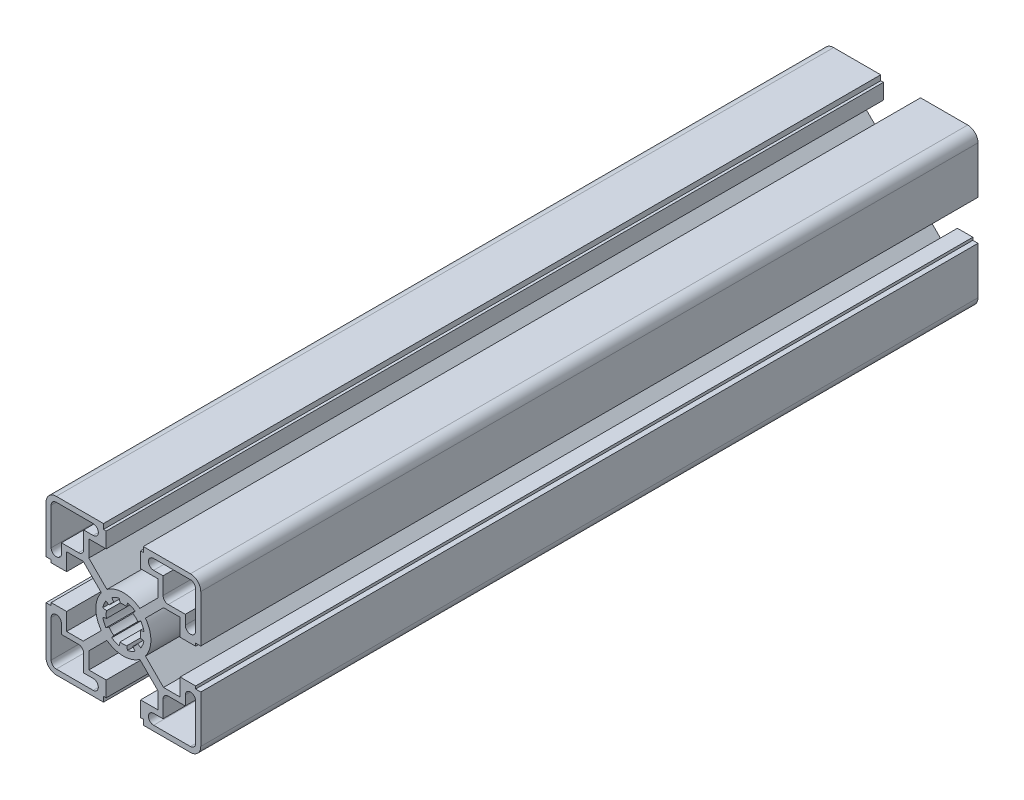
ISO-10303-21;
HEADER;
FILE_DESCRIPTION(('STEP AP214'),'2;1');
FILE_NAME('part.step','',(''),(''),'','','');
FILE_SCHEMA(('AUTOMOTIVE_DESIGN { 1 0 10303 214 1 1 1 1 }'));
ENDSEC;
DATA;
#1=APPLICATION_CONTEXT('core data for automotive mechanical design processes');
#2=APPLICATION_PROTOCOL_DEFINITION('international standard','automotive_design',2000,#1);
#3=PRODUCT_CONTEXT('',#1,'mechanical');
#4=PRODUCT('Part','Part','',(#3));
#5=PRODUCT_RELATED_PRODUCT_CATEGORY('part','',(#4));
#6=PRODUCT_DEFINITION_FORMATION('','',#4);
#7=PRODUCT_DEFINITION_CONTEXT('part definition',#1,'design');
#8=PRODUCT_DEFINITION('design','',#6,#7);
#9=PRODUCT_DEFINITION_SHAPE('','',#8);
#10=(LENGTH_UNIT() NAMED_UNIT(*) SI_UNIT(.MILLI.,.METRE.));
#11=(NAMED_UNIT(*) PLANE_ANGLE_UNIT() SI_UNIT($,.RADIAN.));
#12=(NAMED_UNIT(*) SI_UNIT($,.STERADIAN.) SOLID_ANGLE_UNIT());
#13=UNCERTAINTY_MEASURE_WITH_UNIT(LENGTH_MEASURE(1.E-05),#10,'distance_accuracy_value','');
#14=(GEOMETRIC_REPRESENTATION_CONTEXT(3) GLOBAL_UNCERTAINTY_ASSIGNED_CONTEXT((#13)) GLOBAL_UNIT_ASSIGNED_CONTEXT((#10,
#11,#12)) REPRESENTATION_CONTEXT('',''));
#15=CARTESIAN_POINT('',(0.,0.,0.));
#16=DIRECTION('',(0.,0.,1.));
#17=DIRECTION('',(1.,0.,0.));
#18=AXIS2_PLACEMENT_3D('',#15,#16,#17);
#19=CARTESIAN_POINT('',(0.,0.,113.03));
#20=DIRECTION('',(0.,0.,1.));
#21=DIRECTION('',(1.,0.,0.));
#22=AXIS2_PLACEMENT_3D('',#19,#20,#21);
#23=PLANE('',#22);
#24=DIRECTION('',(1.,0.,0.));
#25=VECTOR('',#24,1.);
#26=CARTESIAN_POINT('',(-16.51,10.0457,113.03));
#27=LINE('',#26,#25);
#28=CARTESIAN_POINT('',(-16.51,10.0457,113.03));
#29=VERTEX_POINT('',#28);
#30=CARTESIAN_POINT('',(-11.6801066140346,10.0457,113.03));
#31=VERTEX_POINT('',#30);
#32=EDGE_CURVE('E1390',#29,#31,#27,.T.);
#33=ORIENTED_EDGE('',*,*,#32,.T.);
#34=DIRECTION('',(0.707106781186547,-0.707106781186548,0.));
#35=VECTOR('',#34,1.);
#36=CARTESIAN_POINT('',(-11.6801066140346,10.0457,113.03));
#37=LINE('',#36,#35);
#38=CARTESIAN_POINT('',(-6.41543331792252,4.78102670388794,113.03));
#39=VERTEX_POINT('',#38);
#40=EDGE_CURVE('E1393',#31,#39,#37,.T.);
#41=ORIENTED_EDGE('',*,*,#40,.T.);
#42=CARTESIAN_POINT('',(0.,0.,113.03));
#43=DIRECTION('',(0.,0.,1.));
#44=DIRECTION('',(1.,0.,0.));
#45=AXIS2_PLACEMENT_3D('',#42,#43,#44);
#46=CIRCLE('',#45,8.001);
#47=CARTESIAN_POINT('',(-6.41543331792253,-4.78102670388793,113.03));
#48=VERTEX_POINT('',#47);
#49=EDGE_CURVE('E1396',#39,#48,#46,.T.);
#50=ORIENTED_EDGE('',*,*,#49,.T.);
#51=DIRECTION('',(-0.707106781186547,-0.707106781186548,0.));
#52=VECTOR('',#51,1.);
#53=CARTESIAN_POINT('',(-11.6801066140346,-10.0457,113.03));
#54=LINE('',#53,#52);
#55=CARTESIAN_POINT('',(-11.6801066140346,-10.0457,113.03));
#56=VERTEX_POINT('',#55);
#57=EDGE_CURVE('E1398',#48,#56,#54,.T.);
#58=ORIENTED_EDGE('',*,*,#57,.T.);
#59=DIRECTION('',(-1.,0.,0.));
#60=VECTOR('',#59,1.);
#61=CARTESIAN_POINT('',(-16.51,-10.0457,113.03));
#62=LINE('',#61,#60);
#63=CARTESIAN_POINT('',(-16.51,-10.0457,113.03));
#64=VERTEX_POINT('',#63);
#65=EDGE_CURVE('E1400',#56,#64,#62,.T.);
#66=ORIENTED_EDGE('',*,*,#65,.T.);
#67=DIRECTION('',(0.,1.,0.));
#68=VECTOR('',#67,1.);
#69=CARTESIAN_POINT('',(-16.51,-5.0038,113.03));
#70=LINE('',#69,#68);
#71=CARTESIAN_POINT('',(-16.51,-5.0038,113.03));
#72=VERTEX_POINT('',#71);
#73=EDGE_CURVE('E1402',#64,#72,#70,.T.);
#74=ORIENTED_EDGE('',*,*,#73,.T.);
#75=DIRECTION('',(-1.,0.,0.));
#76=VECTOR('',#75,1.);
#77=CARTESIAN_POINT('',(-21.0058,-5.0038,113.03));
#78=LINE('',#77,#76);
#79=CARTESIAN_POINT('',(-21.0058,-5.0038,113.03));
#80=VERTEX_POINT('',#79);
#81=EDGE_CURVE('E1404',#72,#80,#78,.T.);
#82=ORIENTED_EDGE('',*,*,#81,.T.);
#83=DIRECTION('',(0.,-1.,0.));
#84=VECTOR('',#83,1.);
#85=CARTESIAN_POINT('',(-21.0058,-5.7912,113.03));
#86=LINE('',#85,#84);
#87=CARTESIAN_POINT('',(-21.0058,-5.7912,113.03));
#88=VERTEX_POINT('',#87);
#89=EDGE_CURVE('E1406',#80,#88,#86,.T.);
#90=ORIENTED_EDGE('',*,*,#89,.T.);
#91=DIRECTION('',(-1.,0.,0.));
#92=VECTOR('',#91,1.);
#93=CARTESIAN_POINT('',(-22.5044,-5.7912,113.03));
#94=LINE('',#93,#92);
#95=CARTESIAN_POINT('',(-22.5044,-5.7912,113.03));
#96=VERTEX_POINT('',#95);
#97=EDGE_CURVE('E1408',#88,#96,#94,.T.);
#98=ORIENTED_EDGE('',*,*,#97,.T.);
#99=DIRECTION('',(0.,-1.,0.));
#100=VECTOR('',#99,1.);
#101=CARTESIAN_POINT('',(-22.5044,-19.5072,113.03));
#102=LINE('',#101,#100);
#103=CARTESIAN_POINT('',(-22.5044,-19.5072,113.03));
#104=VERTEX_POINT('',#103);
#105=EDGE_CURVE('E1410',#96,#104,#102,.T.);
#106=ORIENTED_EDGE('',*,*,#105,.T.);
#107=CARTESIAN_POINT('',(-19.5072,-19.5072,113.03));
#108=DIRECTION('',(0.,0.,1.));
#109=DIRECTION('',(1.,0.,0.));
#110=AXIS2_PLACEMENT_3D('',#107,#108,#109);
#111=CIRCLE('',#110,2.9972);
#112=CARTESIAN_POINT('',(-19.5072,-22.5044,113.03));
#113=VERTEX_POINT('',#112);
#114=EDGE_CURVE('E1412',#104,#113,#111,.T.);
#115=ORIENTED_EDGE('',*,*,#114,.T.);
#116=DIRECTION('',(1.,0.,0.));
#117=VECTOR('',#116,1.);
#118=CARTESIAN_POINT('',(-19.5072,-22.5044,113.03));
#119=LINE('',#118,#117);
#120=CARTESIAN_POINT('',(-5.7912,-22.5044,113.03));
#121=VERTEX_POINT('',#120);
#122=EDGE_CURVE('E1414',#113,#121,#119,.T.);
#123=ORIENTED_EDGE('',*,*,#122,.T.);
#124=DIRECTION('',(0.,1.,0.));
#125=VECTOR('',#124,1.);
#126=CARTESIAN_POINT('',(-5.7912,-22.5044,113.03));
#127=LINE('',#126,#125);
#128=CARTESIAN_POINT('',(-5.7912,-21.0058,113.03));
#129=VERTEX_POINT('',#128);
#130=EDGE_CURVE('E1416',#121,#129,#127,.T.);
#131=ORIENTED_EDGE('',*,*,#130,.T.);
#132=DIRECTION('',(1.,0.,0.));
#133=VECTOR('',#132,1.);
#134=CARTESIAN_POINT('',(-5.7912,-21.0058,113.03));
#135=LINE('',#134,#133);
#136=CARTESIAN_POINT('',(-5.0038,-21.0058,113.03));
#137=VERTEX_POINT('',#136);
#138=EDGE_CURVE('E1418',#129,#137,#135,.T.);
#139=ORIENTED_EDGE('',*,*,#138,.T.);
#140=DIRECTION('',(0.,1.,0.));
#141=VECTOR('',#140,1.);
#142=CARTESIAN_POINT('',(-5.0038,-21.0058,113.03));
#143=LINE('',#142,#141);
#144=CARTESIAN_POINT('',(-5.0038,-16.51,113.03));
#145=VERTEX_POINT('',#144);
#146=EDGE_CURVE('E1420',#137,#145,#143,.T.);
#147=ORIENTED_EDGE('',*,*,#146,.T.);
#148=DIRECTION('',(-1.,0.,0.));
#149=VECTOR('',#148,1.);
#150=CARTESIAN_POINT('',(-5.0038,-16.51,113.03));
#151=LINE('',#150,#149);
#152=CARTESIAN_POINT('',(-10.0457,-16.51,113.03));
#153=VERTEX_POINT('',#152);
#154=EDGE_CURVE('E1422',#145,#153,#151,.T.);
#155=ORIENTED_EDGE('',*,*,#154,.T.);
#156=DIRECTION('',(0.,1.,0.));
#157=VECTOR('',#156,1.);
#158=CARTESIAN_POINT('',(-10.0457,-16.51,113.03));
#159=LINE('',#158,#157);
#160=CARTESIAN_POINT('',(-10.0457,-11.6801066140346,113.03));
#161=VERTEX_POINT('',#160);
#162=EDGE_CURVE('E1424',#153,#161,#159,.T.);
#163=ORIENTED_EDGE('',*,*,#162,.T.);
#164=DIRECTION('',(0.707106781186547,0.707106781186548,0.));
#165=VECTOR('',#164,1.);
#166=CARTESIAN_POINT('',(-10.0457,-11.6801066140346,113.03));
#167=LINE('',#166,#165);
#168=CARTESIAN_POINT('',(-4.78102670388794,-6.41543331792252,113.03));
#169=VERTEX_POINT('',#168);
#170=EDGE_CURVE('E1426',#161,#169,#167,.T.);
#171=ORIENTED_EDGE('',*,*,#170,.T.);
#172=CARTESIAN_POINT('',(0.,0.,113.03));
#173=DIRECTION('',(0.,0.,1.));
#174=DIRECTION('',(1.,0.,0.));
#175=AXIS2_PLACEMENT_3D('',#172,#173,#174);
#176=CIRCLE('',#175,8.001);
#177=CARTESIAN_POINT('',(4.78102670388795,-6.41543331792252,113.03));
#178=VERTEX_POINT('',#177);
#179=EDGE_CURVE('E1428',#169,#178,#176,.T.);
#180=ORIENTED_EDGE('',*,*,#179,.T.);
#181=DIRECTION('',(0.707106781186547,-0.707106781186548,0.));
#182=VECTOR('',#181,1.);
#183=CARTESIAN_POINT('',(10.0457,-11.6801066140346,113.03));
#184=LINE('',#183,#182);
#185=CARTESIAN_POINT('',(10.0457,-11.6801066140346,113.03));
#186=VERTEX_POINT('',#185);
#187=EDGE_CURVE('E1430',#178,#186,#184,.T.);
#188=ORIENTED_EDGE('',*,*,#187,.T.);
#189=DIRECTION('',(0.,-1.,0.));
#190=VECTOR('',#189,1.);
#191=CARTESIAN_POINT('',(10.0457,-16.51,113.03));
#192=LINE('',#191,#190);
#193=CARTESIAN_POINT('',(10.0457,-16.51,113.03));
#194=VERTEX_POINT('',#193);
#195=EDGE_CURVE('E1432',#186,#194,#192,.T.);
#196=ORIENTED_EDGE('',*,*,#195,.T.);
#197=DIRECTION('',(-1.,0.,0.));
#198=VECTOR('',#197,1.);
#199=CARTESIAN_POINT('',(5.00380000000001,-16.51,113.03));
#200=LINE('',#199,#198);
#201=CARTESIAN_POINT('',(5.00380000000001,-16.51,113.03));
#202=VERTEX_POINT('',#201);
#203=EDGE_CURVE('E1434',#194,#202,#200,.T.);
#204=ORIENTED_EDGE('',*,*,#203,.T.);
#205=DIRECTION('',(0.,-1.,0.));
#206=VECTOR('',#205,1.);
#207=CARTESIAN_POINT('',(5.00380000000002,-21.0058,113.03));
#208=LINE('',#207,#206);
#209=CARTESIAN_POINT('',(5.00380000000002,-21.0058,113.03));
#210=VERTEX_POINT('',#209);
#211=EDGE_CURVE('E1436',#202,#210,#208,.T.);
#212=ORIENTED_EDGE('',*,*,#211,.T.);
#213=DIRECTION('',(1.,0.,0.));
#214=VECTOR('',#213,1.);
#215=CARTESIAN_POINT('',(5.79120000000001,-21.0058,113.03));
#216=LINE('',#215,#214);
#217=CARTESIAN_POINT('',(5.79120000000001,-21.0058,113.03));
#218=VERTEX_POINT('',#217);
#219=EDGE_CURVE('E1438',#210,#218,#216,.T.);
#220=ORIENTED_EDGE('',*,*,#219,.T.);
#221=DIRECTION('',(0.,-1.,0.));
#222=VECTOR('',#221,1.);
#223=CARTESIAN_POINT('',(5.79120000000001,-22.5044,113.03));
#224=LINE('',#223,#222);
#225=CARTESIAN_POINT('',(5.79120000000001,-22.5044,113.03));
#226=VERTEX_POINT('',#225);
#227=EDGE_CURVE('E1440',#218,#226,#224,.T.);
#228=ORIENTED_EDGE('',*,*,#227,.T.);
#229=DIRECTION('',(1.,0.,0.));
#230=VECTOR('',#229,1.);
#231=CARTESIAN_POINT('',(19.5072,-22.5044,113.03));
#232=LINE('',#231,#230);
#233=CARTESIAN_POINT('',(19.5072,-22.5044,113.03));
#234=VERTEX_POINT('',#233);
#235=EDGE_CURVE('E1442',#226,#234,#232,.T.);
#236=ORIENTED_EDGE('',*,*,#235,.T.);
#237=CARTESIAN_POINT('',(19.5072,-19.5072,113.03));
#238=DIRECTION('',(0.,0.,1.));
#239=DIRECTION('',(-1.,0.,0.));
#240=AXIS2_PLACEMENT_3D('',#237,#238,#239);
#241=CIRCLE('',#240,2.9972);
#242=CARTESIAN_POINT('',(22.5044,-19.5072,113.03));
#243=VERTEX_POINT('',#242);
#244=EDGE_CURVE('E1444',#234,#243,#241,.T.);
#245=ORIENTED_EDGE('',*,*,#244,.T.);
#246=DIRECTION('',(0.,1.,0.));
#247=VECTOR('',#246,1.);
#248=CARTESIAN_POINT('',(22.5044,-19.5072,113.03));
#249=LINE('',#248,#247);
#250=CARTESIAN_POINT('',(22.5044,-5.7912,113.03));
#251=VERTEX_POINT('',#250);
#252=EDGE_CURVE('E1446',#243,#251,#249,.T.);
#253=ORIENTED_EDGE('',*,*,#252,.T.);
#254=DIRECTION('',(-1.,0.,0.));
#255=VECTOR('',#254,1.);
#256=CARTESIAN_POINT('',(22.5044,-5.7912,113.03));
#257=LINE('',#256,#255);
#258=CARTESIAN_POINT('',(21.0058,-5.7912,113.03));
#259=VERTEX_POINT('',#258);
#260=EDGE_CURVE('E1448',#251,#259,#257,.T.);
#261=ORIENTED_EDGE('',*,*,#260,.T.);
#262=DIRECTION('',(0.,1.,0.));
#263=VECTOR('',#262,1.);
#264=CARTESIAN_POINT('',(21.0058,-5.7912,113.03));
#265=LINE('',#264,#263);
#266=CARTESIAN_POINT('',(21.0058,-5.0038,113.03));
#267=VERTEX_POINT('',#266);
#268=EDGE_CURVE('E1450',#259,#267,#265,.T.);
#269=ORIENTED_EDGE('',*,*,#268,.T.);
#270=DIRECTION('',(-1.,0.,0.));
#271=VECTOR('',#270,1.);
#272=CARTESIAN_POINT('',(21.0058,-5.0038,113.03));
#273=LINE('',#272,#271);
#274=CARTESIAN_POINT('',(16.51,-5.0038,113.03));
#275=VERTEX_POINT('',#274);
#276=EDGE_CURVE('E1452',#267,#275,#273,.T.);
#277=ORIENTED_EDGE('',*,*,#276,.T.);
#278=DIRECTION('',(0.,-1.,0.));
#279=VECTOR('',#278,1.);
#280=CARTESIAN_POINT('',(16.51,-5.0038,113.03));
#281=LINE('',#280,#279);
#282=CARTESIAN_POINT('',(16.51,-10.0457,113.03));
#283=VERTEX_POINT('',#282);
#284=EDGE_CURVE('E1454',#275,#283,#281,.T.);
#285=ORIENTED_EDGE('',*,*,#284,.T.);
#286=DIRECTION('',(-1.,0.,0.));
#287=VECTOR('',#286,1.);
#288=CARTESIAN_POINT('',(16.51,-10.0457,113.03));
#289=LINE('',#288,#287);
#290=CARTESIAN_POINT('',(11.6801066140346,-10.0457,113.03));
#291=VERTEX_POINT('',#290);
#292=EDGE_CURVE('E1456',#283,#291,#289,.T.);
#293=ORIENTED_EDGE('',*,*,#292,.T.);
#294=DIRECTION('',(-0.707106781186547,0.707106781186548,0.));
#295=VECTOR('',#294,1.);
#296=CARTESIAN_POINT('',(11.6801066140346,-10.0457,113.03));
#297=LINE('',#296,#295);
#298=CARTESIAN_POINT('',(6.41543331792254,-4.78102670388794,113.03));
#299=VERTEX_POINT('',#298);
#300=EDGE_CURVE('E1458',#291,#299,#297,.T.);
#301=ORIENTED_EDGE('',*,*,#300,.T.);
#302=CARTESIAN_POINT('',(0.,0.,113.03));
#303=DIRECTION('',(0.,0.,1.));
#304=DIRECTION('',(1.,0.,0.));
#305=AXIS2_PLACEMENT_3D('',#302,#303,#304);
#306=CIRCLE('',#305,8.001);
#307=CARTESIAN_POINT('',(6.41543331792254,4.78102670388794,113.03));
#308=VERTEX_POINT('',#307);
#309=EDGE_CURVE('E1460',#299,#308,#306,.T.);
#310=ORIENTED_EDGE('',*,*,#309,.T.);
#311=DIRECTION('',(0.707106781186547,0.707106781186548,0.));
#312=VECTOR('',#311,1.);
#313=CARTESIAN_POINT('',(11.6801066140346,10.0457,113.03));
#314=LINE('',#313,#312);
#315=CARTESIAN_POINT('',(11.6801066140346,10.0457,113.03));
#316=VERTEX_POINT('',#315);
#317=EDGE_CURVE('E1462',#308,#316,#314,.T.);
#318=ORIENTED_EDGE('',*,*,#317,.T.);
#319=DIRECTION('',(1.,0.,0.));
#320=VECTOR('',#319,1.);
#321=CARTESIAN_POINT('',(16.51,10.0457,113.03));
#322=LINE('',#321,#320);
#323=CARTESIAN_POINT('',(16.51,10.0457,113.03));
#324=VERTEX_POINT('',#323);
#325=EDGE_CURVE('E1464',#316,#324,#322,.T.);
#326=ORIENTED_EDGE('',*,*,#325,.T.);
#327=DIRECTION('',(0.,-1.,0.));
#328=VECTOR('',#327,1.);
#329=CARTESIAN_POINT('',(16.51,5.0038,113.03));
#330=LINE('',#329,#328);
#331=CARTESIAN_POINT('',(16.51,5.0038,113.03));
#332=VERTEX_POINT('',#331);
#333=EDGE_CURVE('E1466',#324,#332,#330,.T.);
#334=ORIENTED_EDGE('',*,*,#333,.T.);
#335=DIRECTION('',(1.,0.,0.));
#336=VECTOR('',#335,1.);
#337=CARTESIAN_POINT('',(21.0058,5.0038,113.03));
#338=LINE('',#337,#336);
#339=CARTESIAN_POINT('',(21.0058,5.0038,113.03));
#340=VERTEX_POINT('',#339);
#341=EDGE_CURVE('E1468',#332,#340,#338,.T.);
#342=ORIENTED_EDGE('',*,*,#341,.T.);
#343=DIRECTION('',(0.,1.,0.));
#344=VECTOR('',#343,1.);
#345=CARTESIAN_POINT('',(21.0058,5.7912,113.03));
#346=LINE('',#345,#344);
#347=CARTESIAN_POINT('',(21.0058,5.7912,113.03));
#348=VERTEX_POINT('',#347);
#349=EDGE_CURVE('E1470',#340,#348,#346,.T.);
#350=ORIENTED_EDGE('',*,*,#349,.T.);
#351=DIRECTION('',(1.,0.,0.));
#352=VECTOR('',#351,1.);
#353=CARTESIAN_POINT('',(22.5044,5.7912,113.03));
#354=LINE('',#353,#352);
#355=CARTESIAN_POINT('',(22.5044,5.7912,113.03));
#356=VERTEX_POINT('',#355);
#357=EDGE_CURVE('E1472',#348,#356,#354,.T.);
#358=ORIENTED_EDGE('',*,*,#357,.T.);
#359=DIRECTION('',(0.,1.,0.));
#360=VECTOR('',#359,1.);
#361=CARTESIAN_POINT('',(22.5044,19.5072,113.03));
#362=LINE('',#361,#360);
#363=CARTESIAN_POINT('',(22.5044,19.5072,113.03));
#364=VERTEX_POINT('',#363);
#365=EDGE_CURVE('E1474',#356,#364,#362,.T.);
#366=ORIENTED_EDGE('',*,*,#365,.T.);
#367=CARTESIAN_POINT('',(19.5072,19.5072,113.03));
#368=DIRECTION('',(0.,0.,1.));
#369=DIRECTION('',(1.,0.,0.));
#370=AXIS2_PLACEMENT_3D('',#367,#368,#369);
#371=CIRCLE('',#370,2.9972);
#372=CARTESIAN_POINT('',(19.5072,22.5044,113.03));
#373=VERTEX_POINT('',#372);
#374=EDGE_CURVE('E1476',#364,#373,#371,.T.);
#375=ORIENTED_EDGE('',*,*,#374,.T.);
#376=DIRECTION('',(-1.,0.,0.));
#377=VECTOR('',#376,1.);
#378=CARTESIAN_POINT('',(19.5072,22.5044,113.03));
#379=LINE('',#378,#377);
#380=CARTESIAN_POINT('',(5.79120000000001,22.5044,113.03));
#381=VERTEX_POINT('',#380);
#382=EDGE_CURVE('E1478',#373,#381,#379,.T.);
#383=ORIENTED_EDGE('',*,*,#382,.T.);
#384=DIRECTION('',(0.,-1.,0.));
#385=VECTOR('',#384,1.);
#386=CARTESIAN_POINT('',(5.79120000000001,22.5044,113.03));
#387=LINE('',#386,#385);
#388=CARTESIAN_POINT('',(5.79120000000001,21.0058,113.03));
#389=VERTEX_POINT('',#388);
#390=EDGE_CURVE('E1480',#381,#389,#387,.T.);
#391=ORIENTED_EDGE('',*,*,#390,.T.);
#392=DIRECTION('',(-1.,0.,0.));
#393=VECTOR('',#392,1.);
#394=CARTESIAN_POINT('',(5.79120000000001,21.0058,113.03));
#395=LINE('',#394,#393);
#396=CARTESIAN_POINT('',(5.00380000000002,21.0058,113.03));
#397=VERTEX_POINT('',#396);
#398=EDGE_CURVE('E1482',#389,#397,#395,.T.);
#399=ORIENTED_EDGE('',*,*,#398,.T.);
#400=DIRECTION('',(0.,-1.,0.));
#401=VECTOR('',#400,1.);
#402=CARTESIAN_POINT('',(5.00380000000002,21.0058,113.03));
#403=LINE('',#402,#401);
#404=CARTESIAN_POINT('',(5.00380000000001,16.51,113.03));
#405=VERTEX_POINT('',#404);
#406=EDGE_CURVE('E1484',#397,#405,#403,.T.);
#407=ORIENTED_EDGE('',*,*,#406,.T.);
#408=DIRECTION('',(1.,0.,0.));
#409=VECTOR('',#408,1.);
#410=CARTESIAN_POINT('',(5.00380000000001,16.51,113.03));
#411=LINE('',#410,#409);
#412=CARTESIAN_POINT('',(10.0457,16.51,113.03));
#413=VERTEX_POINT('',#412);
#414=EDGE_CURVE('E1486',#405,#413,#411,.T.);
#415=ORIENTED_EDGE('',*,*,#414,.T.);
#416=DIRECTION('',(0.,-1.,0.));
#417=VECTOR('',#416,1.);
#418=CARTESIAN_POINT('',(10.0457,16.51,113.03));
#419=LINE('',#418,#417);
#420=CARTESIAN_POINT('',(10.0457,11.6801066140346,113.03));
#421=VERTEX_POINT('',#420);
#422=EDGE_CURVE('E1488',#413,#421,#419,.T.);
#423=ORIENTED_EDGE('',*,*,#422,.T.);
#424=DIRECTION('',(-0.707106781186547,-0.707106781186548,0.));
#425=VECTOR('',#424,1.);
#426=CARTESIAN_POINT('',(10.0457,11.6801066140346,113.03));
#427=LINE('',#426,#425);
#428=CARTESIAN_POINT('',(4.78102670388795,6.41543331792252,113.03));
#429=VERTEX_POINT('',#428);
#430=EDGE_CURVE('E1490',#421,#429,#427,.T.);
#431=ORIENTED_EDGE('',*,*,#430,.T.);
#432=CARTESIAN_POINT('',(0.,0.,113.03));
#433=DIRECTION('',(0.,0.,1.));
#434=DIRECTION('',(1.,0.,0.));
#435=AXIS2_PLACEMENT_3D('',#432,#433,#434);
#436=CIRCLE('',#435,8.001);
#437=CARTESIAN_POINT('',(-4.78102670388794,6.41543331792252,113.03));
#438=VERTEX_POINT('',#437);
#439=EDGE_CURVE('E1492',#429,#438,#436,.T.);
#440=ORIENTED_EDGE('',*,*,#439,.T.);
#441=DIRECTION('',(-0.707106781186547,0.707106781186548,0.));
#442=VECTOR('',#441,1.);
#443=CARTESIAN_POINT('',(-10.0457,11.6801066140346,113.03));
#444=LINE('',#443,#442);
#445=CARTESIAN_POINT('',(-10.0457,11.6801066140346,113.03));
#446=VERTEX_POINT('',#445);
#447=EDGE_CURVE('E1494',#438,#446,#444,.T.);
#448=ORIENTED_EDGE('',*,*,#447,.T.);
#449=DIRECTION('',(0.,1.,0.));
#450=VECTOR('',#449,1.);
#451=CARTESIAN_POINT('',(-10.0457,16.51,113.03));
#452=LINE('',#451,#450);
#453=CARTESIAN_POINT('',(-10.0457,16.51,113.03));
#454=VERTEX_POINT('',#453);
#455=EDGE_CURVE('E1496',#446,#454,#452,.T.);
#456=ORIENTED_EDGE('',*,*,#455,.T.);
#457=DIRECTION('',(1.,0.,0.));
#458=VECTOR('',#457,1.);
#459=CARTESIAN_POINT('',(-5.0038,16.51,113.03));
#460=LINE('',#459,#458);
#461=CARTESIAN_POINT('',(-5.0038,16.51,113.03));
#462=VERTEX_POINT('',#461);
#463=EDGE_CURVE('E1498',#454,#462,#460,.T.);
#464=ORIENTED_EDGE('',*,*,#463,.T.);
#465=DIRECTION('',(0.,1.,0.));
#466=VECTOR('',#465,1.);
#467=CARTESIAN_POINT('',(-5.0038,21.0058,113.03));
#468=LINE('',#467,#466);
#469=CARTESIAN_POINT('',(-5.0038,21.0058,113.03));
#470=VERTEX_POINT('',#469);
#471=EDGE_CURVE('E1500',#462,#470,#468,.T.);
#472=ORIENTED_EDGE('',*,*,#471,.T.);
#473=DIRECTION('',(-1.,0.,0.));
#474=VECTOR('',#473,1.);
#475=CARTESIAN_POINT('',(-5.7912,21.0058,113.03));
#476=LINE('',#475,#474);
#477=CARTESIAN_POINT('',(-5.7912,21.0058,113.03));
#478=VERTEX_POINT('',#477);
#479=EDGE_CURVE('E1502',#470,#478,#476,.T.);
#480=ORIENTED_EDGE('',*,*,#479,.T.);
#481=DIRECTION('',(0.,1.,0.));
#482=VECTOR('',#481,1.);
#483=CARTESIAN_POINT('',(-5.7912,22.5044,113.03));
#484=LINE('',#483,#482);
#485=CARTESIAN_POINT('',(-5.7912,22.5044,113.03));
#486=VERTEX_POINT('',#485);
#487=EDGE_CURVE('E1504',#478,#486,#484,.T.);
#488=ORIENTED_EDGE('',*,*,#487,.T.);
#489=DIRECTION('',(-1.,0.,0.));
#490=VECTOR('',#489,1.);
#491=CARTESIAN_POINT('',(-19.5072,22.5044,113.03));
#492=LINE('',#491,#490);
#493=CARTESIAN_POINT('',(-19.5072,22.5044,113.03));
#494=VERTEX_POINT('',#493);
#495=EDGE_CURVE('E1506',#486,#494,#492,.T.);
#496=ORIENTED_EDGE('',*,*,#495,.T.);
#497=CARTESIAN_POINT('',(-19.5072,19.5072,113.03));
#498=DIRECTION('',(0.,0.,1.));
#499=DIRECTION('',(-1.,0.,0.));
#500=AXIS2_PLACEMENT_3D('',#497,#498,#499);
#501=CIRCLE('',#500,2.9972);
#502=CARTESIAN_POINT('',(-22.5044,19.5072,113.03));
#503=VERTEX_POINT('',#502);
#504=EDGE_CURVE('E1508',#494,#503,#501,.T.);
#505=ORIENTED_EDGE('',*,*,#504,.T.);
#506=DIRECTION('',(0.,-1.,0.));
#507=VECTOR('',#506,1.);
#508=CARTESIAN_POINT('',(-22.5044,19.5072,113.03));
#509=LINE('',#508,#507);
#510=CARTESIAN_POINT('',(-22.5044,5.7912,113.03));
#511=VERTEX_POINT('',#510);
#512=EDGE_CURVE('E1510',#503,#511,#509,.T.);
#513=ORIENTED_EDGE('',*,*,#512,.T.);
#514=DIRECTION('',(1.,0.,0.));
#515=VECTOR('',#514,1.);
#516=CARTESIAN_POINT('',(-22.5044,5.7912,113.03));
#517=LINE('',#516,#515);
#518=CARTESIAN_POINT('',(-21.0058,5.7912,113.03));
#519=VERTEX_POINT('',#518);
#520=EDGE_CURVE('E1512',#511,#519,#517,.T.);
#521=ORIENTED_EDGE('',*,*,#520,.T.);
#522=DIRECTION('',(0.,-1.,0.));
#523=VECTOR('',#522,1.);
#524=CARTESIAN_POINT('',(-21.0058,5.7912,113.03));
#525=LINE('',#524,#523);
#526=CARTESIAN_POINT('',(-21.0058,5.0038,113.03));
#527=VERTEX_POINT('',#526);
#528=EDGE_CURVE('E1514',#519,#527,#525,.T.);
#529=ORIENTED_EDGE('',*,*,#528,.T.);
#530=DIRECTION('',(1.,0.,0.));
#531=VECTOR('',#530,1.);
#532=CARTESIAN_POINT('',(-21.0058,5.0038,113.03));
#533=LINE('',#532,#531);
#534=CARTESIAN_POINT('',(-16.51,5.0038,113.03));
#535=VERTEX_POINT('',#534);
#536=EDGE_CURVE('E1516',#527,#535,#533,.T.);
#537=ORIENTED_EDGE('',*,*,#536,.T.);
#538=DIRECTION('',(0.,1.,0.));
#539=VECTOR('',#538,1.);
#540=CARTESIAN_POINT('',(-16.51,5.0038,113.03));
#541=LINE('',#540,#539);
#542=EDGE_CURVE('E1518',#535,#29,#541,.T.);
#543=ORIENTED_EDGE('',*,*,#542,.T.);
#544=EDGE_LOOP('',(#33,#41,#50,#58,#66,#74,#82,#90,#98,#106,#115,#123,#131,#139,#147,#155,#163,
#171,#180,#188,#196,#204,#212,#220,#228,#236,#245,#253,#261,#269,#277,#285,#293,#301,#310,#318,
#326,#334,#342,#350,#358,#366,#375,#383,#391,#399,#407,#415,#423,#431,#440,#448,#456,#464,#472,
#480,#488,#496,#505,#513,#521,#529,#537,#543));
#545=FACE_BOUND('',#544,.T.);
#546=DIRECTION('',(-1.,0.,0.));
#547=VECTOR('',#546,1.);
#548=CARTESIAN_POINT('',(-19.5072,21.0058,113.03));
#549=LINE('',#548,#547);
#550=CARTESIAN_POINT('',(-8.7884,21.0058,113.03));
#551=VERTEX_POINT('',#550);
#552=CARTESIAN_POINT('',(-19.5072,21.0058,113.03));
#553=VERTEX_POINT('',#552);
#554=EDGE_CURVE('E1319',#551,#553,#549,.T.);
#555=ORIENTED_EDGE('',*,*,#554,.F.);
#556=CARTESIAN_POINT('',(-8.78839999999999,19.5072,113.03));
#557=DIRECTION('',(0.,0.,1.));
#558=DIRECTION('',(-1.,0.,0.));
#559=AXIS2_PLACEMENT_3D('',#556,#557,#558);
#560=CIRCLE('',#559,1.4986);
#561=CARTESIAN_POINT('',(-8.78839999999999,18.0086,113.03));
#562=VERTEX_POINT('',#561);
#563=EDGE_CURVE('E1317',#562,#551,#560,.T.);
#564=ORIENTED_EDGE('',*,*,#563,.F.);
#565=DIRECTION('',(1.,0.,0.));
#566=VECTOR('',#565,1.);
#567=CARTESIAN_POINT('',(-11.5443,18.0086,113.03));
#568=LINE('',#567,#566);
#569=CARTESIAN_POINT('',(-11.5443,18.0086,113.03));
#570=VERTEX_POINT('',#569);
#571=EDGE_CURVE('E1337',#570,#562,#568,.T.);
#572=ORIENTED_EDGE('',*,*,#571,.F.);
#573=DIRECTION('',(0.,1.,0.));
#574=VECTOR('',#573,1.);
#575=CARTESIAN_POINT('',(-11.5443,18.0086,113.03));
#576=LINE('',#575,#574);
#577=CARTESIAN_POINT('',(-11.5443,13.0429,113.03));
#578=VERTEX_POINT('',#577);
#579=EDGE_CURVE('E1334',#578,#570,#576,.T.);
#580=ORIENTED_EDGE('',*,*,#579,.F.);
#581=CARTESIAN_POINT('',(-13.0429,13.0429,113.03));
#582=DIRECTION('',(0.,0.,1.));
#583=DIRECTION('',(-1.,0.,0.));
#584=AXIS2_PLACEMENT_3D('',#581,#582,#583);
#585=CIRCLE('',#584,1.4986);
#586=CARTESIAN_POINT('',(-13.0429,11.5443,113.03));
#587=VERTEX_POINT('',#586);
#588=EDGE_CURVE('E1332',#587,#578,#585,.T.);
#589=ORIENTED_EDGE('',*,*,#588,.F.);
#590=DIRECTION('',(1.,0.,0.));
#591=VECTOR('',#590,1.);
#592=CARTESIAN_POINT('',(-18.0086,11.5443,113.03));
#593=LINE('',#592,#591);
#594=CARTESIAN_POINT('',(-18.0086,11.5443,113.03));
#595=VERTEX_POINT('',#594);
#596=EDGE_CURVE('E1330',#595,#587,#593,.T.);
#597=ORIENTED_EDGE('',*,*,#596,.F.);
#598=DIRECTION('',(0.,1.,0.));
#599=VECTOR('',#598,1.);
#600=CARTESIAN_POINT('',(-18.0086,11.5443,113.03));
#601=LINE('',#600,#599);
#602=CARTESIAN_POINT('',(-18.0086,8.78840000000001,113.03));
#603=VERTEX_POINT('',#602);
#604=EDGE_CURVE('E1328',#603,#595,#601,.T.);
#605=ORIENTED_EDGE('',*,*,#604,.F.);
#606=CARTESIAN_POINT('',(-19.5072,8.7884,113.03));
#607=DIRECTION('',(0.,0.,1.));
#608=DIRECTION('',(1.,0.,0.));
#609=AXIS2_PLACEMENT_3D('',#606,#607,#608);
#610=CIRCLE('',#609,1.4986);
#611=CARTESIAN_POINT('',(-21.0058,8.78840000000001,113.03));
#612=VERTEX_POINT('',#611);
#613=EDGE_CURVE('E1326',#612,#603,#610,.T.);
#614=ORIENTED_EDGE('',*,*,#613,.F.);
#615=DIRECTION('',(0.,-1.,0.));
#616=VECTOR('',#615,1.);
#617=CARTESIAN_POINT('',(-21.0058,19.5072,113.03));
#618=LINE('',#617,#616);
#619=CARTESIAN_POINT('',(-21.0058,19.5072,113.03));
#620=VERTEX_POINT('',#619);
#621=EDGE_CURVE('E1324',#620,#612,#618,.T.);
#622=ORIENTED_EDGE('',*,*,#621,.F.);
#623=CARTESIAN_POINT('',(-19.5072,19.5072,113.03));
#624=DIRECTION('',(0.,0.,1.));
#625=DIRECTION('',(-1.,0.,0.));
#626=AXIS2_PLACEMENT_3D('',#623,#624,#625);
#627=CIRCLE('',#626,1.4986);
#628=EDGE_CURVE('E1322',#553,#620,#627,.T.);
#629=ORIENTED_EDGE('',*,*,#628,.F.);
#630=EDGE_LOOP('',(#555,#564,#572,#580,#589,#597,#605,#614,#622,#629));
#631=FACE_BOUND('',#630,.T.);
#632=DIRECTION('',(1.,0.,0.));
#633=VECTOR('',#632,1.);
#634=CARTESIAN_POINT('',(11.5443,18.0086,113.03));
#635=LINE('',#634,#633);
#636=CARTESIAN_POINT('',(8.78840000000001,18.0086,113.03));
#637=VERTEX_POINT('',#636);
#638=CARTESIAN_POINT('',(11.5443,18.0086,113.03));
#639=VERTEX_POINT('',#638);
#640=EDGE_CURVE('E1246',#637,#639,#635,.T.);
#641=ORIENTED_EDGE('',*,*,#640,.F.);
#642=CARTESIAN_POINT('',(8.78840000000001,19.5072,113.03));
#643=DIRECTION('',(0.,0.,1.));
#644=DIRECTION('',(1.,0.,0.));
#645=AXIS2_PLACEMENT_3D('',#642,#643,#644);
#646=CIRCLE('',#645,1.4986);
#647=CARTESIAN_POINT('',(8.78840000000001,21.0058,113.03));
#648=VERTEX_POINT('',#647);
#649=EDGE_CURVE('E1244',#648,#637,#646,.T.);
#650=ORIENTED_EDGE('',*,*,#649,.F.);
#651=DIRECTION('',(-1.,0.,0.));
#652=VECTOR('',#651,1.);
#653=CARTESIAN_POINT('',(19.5072,21.0058,113.03));
#654=LINE('',#653,#652);
#655=CARTESIAN_POINT('',(19.5072,21.0058,113.03));
#656=VERTEX_POINT('',#655);
#657=EDGE_CURVE('E1264',#656,#648,#654,.T.);
#658=ORIENTED_EDGE('',*,*,#657,.F.);
#659=CARTESIAN_POINT('',(19.5072,19.5072,113.03));
#660=DIRECTION('',(0.,0.,1.));
#661=DIRECTION('',(1.,0.,0.));
#662=AXIS2_PLACEMENT_3D('',#659,#660,#661);
#663=CIRCLE('',#662,1.4986);
#664=CARTESIAN_POINT('',(21.0058,19.5072,113.03));
#665=VERTEX_POINT('',#664);
#666=EDGE_CURVE('E1261',#665,#656,#663,.T.);
#667=ORIENTED_EDGE('',*,*,#666,.F.);
#668=DIRECTION('',(0.,1.,0.));
#669=VECTOR('',#668,1.);
#670=CARTESIAN_POINT('',(21.0058,19.5072,113.03));
#671=LINE('',#670,#669);
#672=CARTESIAN_POINT('',(21.0058,8.7884,113.03));
#673=VERTEX_POINT('',#672);
#674=EDGE_CURVE('E1259',#673,#665,#671,.T.);
#675=ORIENTED_EDGE('',*,*,#674,.F.);
#676=CARTESIAN_POINT('',(19.5072,8.7884,113.03));
#677=DIRECTION('',(0.,0.,1.));
#678=DIRECTION('',(-1.,0.,0.));
#679=AXIS2_PLACEMENT_3D('',#676,#677,#678);
#680=CIRCLE('',#679,1.49860000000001);
#681=CARTESIAN_POINT('',(18.0086,8.7884,113.03));
#682=VERTEX_POINT('',#681);
#683=EDGE_CURVE('E1257',#682,#673,#680,.T.);
#684=ORIENTED_EDGE('',*,*,#683,.F.);
#685=DIRECTION('',(0.,-1.,0.));
#686=VECTOR('',#685,1.);
#687=CARTESIAN_POINT('',(18.0086,11.5443,113.03));
#688=LINE('',#687,#686);
#689=CARTESIAN_POINT('',(18.0086,11.5443,113.03));
#690=VERTEX_POINT('',#689);
#691=EDGE_CURVE('E1255',#690,#682,#688,.T.);
#692=ORIENTED_EDGE('',*,*,#691,.F.);
#693=DIRECTION('',(1.,0.,0.));
#694=VECTOR('',#693,1.);
#695=CARTESIAN_POINT('',(18.0086,11.5443,113.03));
#696=LINE('',#695,#694);
#697=CARTESIAN_POINT('',(13.0429,11.5443,113.03));
#698=VERTEX_POINT('',#697);
#699=EDGE_CURVE('E1253',#698,#690,#696,.T.);
#700=ORIENTED_EDGE('',*,*,#699,.F.);
#701=CARTESIAN_POINT('',(13.0429,13.0429,113.03));
#702=DIRECTION('',(0.,0.,1.));
#703=DIRECTION('',(1.,0.,0.));
#704=AXIS2_PLACEMENT_3D('',#701,#702,#703);
#705=CIRCLE('',#704,1.4986);
#706=CARTESIAN_POINT('',(11.5443,13.0429,113.03));
#707=VERTEX_POINT('',#706);
#708=EDGE_CURVE('E1251',#707,#698,#705,.T.);
#709=ORIENTED_EDGE('',*,*,#708,.F.);
#710=DIRECTION('',(0.,-1.,0.));
#711=VECTOR('',#710,1.);
#712=CARTESIAN_POINT('',(11.5443,18.0086,113.03));
#713=LINE('',#712,#711);
#714=EDGE_CURVE('E1249',#639,#707,#713,.T.);
#715=ORIENTED_EDGE('',*,*,#714,.F.);
#716=EDGE_LOOP('',(#641,#650,#658,#667,#675,#684,#692,#700,#709,#715));
#717=FACE_BOUND('',#716,.T.);
#718=DIRECTION('',(-0.195090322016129,-0.98078528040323,0.));
#719=VECTOR('',#718,1.);
#720=CARTESIAN_POINT('',(1.18927060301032,5.97886706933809,113.03));
#721=LINE('',#720,#719);
#722=CARTESIAN_POINT('',(1.18927060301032,5.97886706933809,113.03));
#723=VERTEX_POINT('',#722);
#724=CARTESIAN_POINT('',(0.976192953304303,4.90765338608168,113.03));
#725=VERTEX_POINT('',#724);
#726=EDGE_CURVE('E1019',#723,#725,#721,.T.);
#727=ORIENTED_EDGE('',*,*,#726,.F.);
#728=CARTESIAN_POINT('',(0.,0.,113.03));
#729=DIRECTION('',(0.,0.,1.));
#730=DIRECTION('',(1.,0.,0.));
#731=AXIS2_PLACEMENT_3D('',#728,#729,#730);
#732=CIRCLE('',#731,6.096);
#733=CARTESIAN_POINT('',(3.3867561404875,5.06863875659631,113.03));
#734=VERTEX_POINT('',#733);
#735=EDGE_CURVE('E1017',#734,#723,#732,.T.);
#736=ORIENTED_EDGE('',*,*,#735,.F.);
#737=DIRECTION('',(0.555570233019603,0.831469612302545,0.));
#738=VECTOR('',#737,1.);
#739=CARTESIAN_POINT('',(3.3867561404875,5.06863875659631,113.03));
#740=LINE('',#739,#738);
#741=CARTESIAN_POINT('',(2.77996233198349,4.16050764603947,113.03));
#742=VERTEX_POINT('',#741);
#743=EDGE_CURVE('E1081',#742,#734,#740,.T.);
#744=ORIENTED_EDGE('',*,*,#743,.F.);
#745=CARTESIAN_POINT('',(0.,0.,113.03));
#746=DIRECTION('',(0.,0.,1.));
#747=DIRECTION('',(1.,0.,0.));
#748=AXIS2_PLACEMENT_3D('',#745,#746,#747);
#749=CIRCLE('',#748,5.00379999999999);
#750=CARTESIAN_POINT('',(4.16050764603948,2.77996233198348,113.03));
#751=VERTEX_POINT('',#750);
#752=EDGE_CURVE('E1078',#751,#742,#749,.T.);
#753=ORIENTED_EDGE('',*,*,#752,.F.);
#754=DIRECTION('',(-0.831469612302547,-0.5555702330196,0.));
#755=VECTOR('',#754,1.);
#756=CARTESIAN_POINT('',(5.06863875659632,3.38675614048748,113.03));
#757=LINE('',#756,#755);
#758=CARTESIAN_POINT('',(5.06863875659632,3.38675614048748,113.03));
#759=VERTEX_POINT('',#758);
#760=EDGE_CURVE('E1076',#759,#751,#757,.T.);
#761=ORIENTED_EDGE('',*,*,#760,.F.);
#762=CARTESIAN_POINT('',(0.,0.,113.03));
#763=DIRECTION('',(0.,0.,1.));
#764=DIRECTION('',(1.,0.,0.));
#765=AXIS2_PLACEMENT_3D('',#762,#763,#764);
#766=CIRCLE('',#765,6.09599999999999);
#767=CARTESIAN_POINT('',(5.9788670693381,1.1892706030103,113.03));
#768=VERTEX_POINT('',#767);
#769=EDGE_CURVE('E1074',#768,#759,#766,.T.);
#770=ORIENTED_EDGE('',*,*,#769,.F.);
#771=DIRECTION('',(0.980785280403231,0.195090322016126,0.));
#772=VECTOR('',#771,1.);
#773=CARTESIAN_POINT('',(5.9788670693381,1.1892706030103,113.03));
#774=LINE('',#773,#772);
#775=CARTESIAN_POINT('',(4.90765338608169,0.976192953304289,113.03));
#776=VERTEX_POINT('',#775);
#777=EDGE_CURVE('E1072',#776,#768,#774,.T.);
#778=ORIENTED_EDGE('',*,*,#777,.F.);
#779=CARTESIAN_POINT('',(0.,0.,113.03));
#780=DIRECTION('',(0.,0.,1.));
#781=DIRECTION('',(1.,0.,0.));
#782=AXIS2_PLACEMENT_3D('',#779,#780,#781);
#783=CIRCLE('',#782,5.00379999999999);
#784=CARTESIAN_POINT('',(4.90765338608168,-0.97619295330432,113.03));
#785=VERTEX_POINT('',#784);
#786=EDGE_CURVE('E1070',#785,#776,#783,.T.);
#787=ORIENTED_EDGE('',*,*,#786,.F.);
#788=DIRECTION('',(-0.98078528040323,0.195090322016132,0.));
#789=VECTOR('',#788,1.);
#790=CARTESIAN_POINT('',(5.97886706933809,-1.18927060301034,113.03));
#791=LINE('',#790,#789);
#792=CARTESIAN_POINT('',(5.97886706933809,-1.18927060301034,113.03));
#793=VERTEX_POINT('',#792);
#794=EDGE_CURVE('E1068',#793,#785,#791,.T.);
#795=ORIENTED_EDGE('',*,*,#794,.F.);
#796=CARTESIAN_POINT('',(0.,0.,113.03));
#797=DIRECTION('',(0.,0.,1.));
#798=DIRECTION('',(1.,0.,0.));
#799=AXIS2_PLACEMENT_3D('',#796,#797,#798);
#800=CIRCLE('',#799,6.09599999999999);
#801=CARTESIAN_POINT('',(5.0686387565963,-3.38675614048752,113.03));
#802=VERTEX_POINT('',#801);
#803=EDGE_CURVE('E1066',#802,#793,#800,.T.);
#804=ORIENTED_EDGE('',*,*,#803,.F.);
#805=DIRECTION('',(0.831469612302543,-0.555570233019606,0.));
#806=VECTOR('',#805,1.);
#807=CARTESIAN_POINT('',(5.0686387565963,-3.38675614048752,113.03));
#808=LINE('',#807,#806);
#809=CARTESIAN_POINT('',(4.16050764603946,-2.7799623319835,113.03));
#810=VERTEX_POINT('',#809);
#811=EDGE_CURVE('E1064',#810,#802,#808,.T.);
#812=ORIENTED_EDGE('',*,*,#811,.F.);
#813=CARTESIAN_POINT('',(0.,0.,113.03));
#814=DIRECTION('',(0.,0.,1.));
#815=DIRECTION('',(1.,0.,0.));
#816=AXIS2_PLACEMENT_3D('',#813,#814,#815);
#817=CIRCLE('',#816,5.00379999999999);
#818=CARTESIAN_POINT('',(2.77996233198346,-4.16050764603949,113.03));
#819=VERTEX_POINT('',#818);
#820=EDGE_CURVE('E1062',#819,#810,#817,.T.);
#821=ORIENTED_EDGE('',*,*,#820,.F.);
#822=DIRECTION('',(-0.555570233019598,0.831469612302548,0.));
#823=VECTOR('',#822,1.);
#824=CARTESIAN_POINT('',(3.38675614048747,-5.06863875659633,113.03));
#825=LINE('',#824,#823);
#826=CARTESIAN_POINT('',(3.38675614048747,-5.06863875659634,113.03));
#827=VERTEX_POINT('',#826);
#828=EDGE_CURVE('E1060',#827,#819,#825,.T.);
#829=ORIENTED_EDGE('',*,*,#828,.F.);
#830=CARTESIAN_POINT('',(0.,0.,113.03));
#831=DIRECTION('',(0.,0.,1.));
#832=DIRECTION('',(1.,0.,0.));
#833=AXIS2_PLACEMENT_3D('',#830,#831,#832);
#834=CIRCLE('',#833,6.096);
#835=CARTESIAN_POINT('',(1.18927060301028,-5.9788670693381,113.03));
#836=VERTEX_POINT('',#835);
#837=EDGE_CURVE('E1058',#836,#827,#834,.T.);
#838=ORIENTED_EDGE('',*,*,#837,.F.);
#839=DIRECTION('',(0.195090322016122,-0.980785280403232,0.));
#840=VECTOR('',#839,1.);
#841=CARTESIAN_POINT('',(1.18927060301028,-5.9788670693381,113.03));
#842=LINE('',#841,#840);
#843=CARTESIAN_POINT('',(0.97619295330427,-4.90765338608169,113.03));
#844=VERTEX_POINT('',#843);
#845=EDGE_CURVE('E1056',#844,#836,#842,.T.);
#846=ORIENTED_EDGE('',*,*,#845,.F.);
#847=CARTESIAN_POINT('',(0.,0.,113.03));
#848=DIRECTION('',(0.,0.,1.));
#849=DIRECTION('',(1.,0.,0.));
#850=AXIS2_PLACEMENT_3D('',#847,#848,#849);
#851=CIRCLE('',#850,5.0038);
#852=CARTESIAN_POINT('',(-0.976192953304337,-4.90765338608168,113.03));
#853=VERTEX_POINT('',#852);
#854=EDGE_CURVE('E1054',#853,#844,#851,.T.);
#855=ORIENTED_EDGE('',*,*,#854,.F.);
#856=DIRECTION('',(0.195090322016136,0.980785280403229,0.));
#857=VECTOR('',#856,1.);
#858=CARTESIAN_POINT('',(-1.18927060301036,-5.97886706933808,113.03));
#859=LINE('',#858,#857);
#860=CARTESIAN_POINT('',(-1.18927060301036,-5.97886706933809,113.03));
#861=VERTEX_POINT('',#860);
#862=EDGE_CURVE('E1052',#861,#853,#859,.T.);
#863=ORIENTED_EDGE('',*,*,#862,.F.);
#864=CARTESIAN_POINT('',(0.,0.,113.03));
#865=DIRECTION('',(0.,0.,1.));
#866=DIRECTION('',(1.,0.,0.));
#867=AXIS2_PLACEMENT_3D('',#864,#865,#866);
#868=CIRCLE('',#867,6.096);
#869=CARTESIAN_POINT('',(-3.38675614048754,-5.06863875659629,113.03));
#870=VERTEX_POINT('',#869);
#871=EDGE_CURVE('E1050',#870,#861,#868,.T.);
#872=ORIENTED_EDGE('',*,*,#871,.F.);
#873=DIRECTION('',(-0.555570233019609,-0.831469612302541,0.));
#874=VECTOR('',#873,1.);
#875=CARTESIAN_POINT('',(-3.38675614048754,-5.06863875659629,113.03));
#876=LINE('',#875,#874);
#877=CARTESIAN_POINT('',(-2.77996233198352,-4.16050764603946,113.03));
#878=VERTEX_POINT('',#877);
#879=EDGE_CURVE('E1048',#878,#870,#876,.T.);
#880=ORIENTED_EDGE('',*,*,#879,.F.);
#881=CARTESIAN_POINT('',(0.,0.,113.03));
#882=DIRECTION('',(0.,0.,1.));
#883=DIRECTION('',(1.,0.,0.));
#884=AXIS2_PLACEMENT_3D('',#881,#882,#883);
#885=CIRCLE('',#884,5.0038);
#886=CARTESIAN_POINT('',(-4.1605076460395,-2.77996233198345,113.03));
#887=VERTEX_POINT('',#886);
#888=EDGE_CURVE('E1046',#887,#878,#885,.T.);
#889=ORIENTED_EDGE('',*,*,#888,.F.);
#890=DIRECTION('',(0.83146961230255,0.555570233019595,0.));
#891=VECTOR('',#890,1.);
#892=CARTESIAN_POINT('',(-5.06863875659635,-3.38675614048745,113.03));
#893=LINE('',#892,#891);
#894=CARTESIAN_POINT('',(-5.06863875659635,-3.38675614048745,113.03));
#895=VERTEX_POINT('',#894);
#896=EDGE_CURVE('E1044',#895,#887,#893,.T.);
#897=ORIENTED_EDGE('',*,*,#896,.F.);
#898=CARTESIAN_POINT('',(0.,0.,113.03));
#899=DIRECTION('',(0.,0.,1.));
#900=DIRECTION('',(1.,0.,0.));
#901=AXIS2_PLACEMENT_3D('',#898,#899,#900);
#902=CIRCLE('',#901,6.09600000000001);
#903=CARTESIAN_POINT('',(-5.9788670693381,-1.18927060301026,113.03));
#904=VERTEX_POINT('',#903);
#905=EDGE_CURVE('E1042',#904,#895,#902,.T.);
#906=ORIENTED_EDGE('',*,*,#905,.F.);
#907=DIRECTION('',(-0.980785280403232,-0.195090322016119,0.));
#908=VECTOR('',#907,1.);
#909=CARTESIAN_POINT('',(-5.9788670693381,-1.18927060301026,113.03));
#910=LINE('',#909,#908);
#911=CARTESIAN_POINT('',(-4.9076533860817,-0.976192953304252,113.03));
#912=VERTEX_POINT('',#911);
#913=EDGE_CURVE('E1040',#912,#904,#910,.T.);
#914=ORIENTED_EDGE('',*,*,#913,.F.);
#915=CARTESIAN_POINT('',(0.,0.,113.03));
#916=DIRECTION('',(0.,0.,1.));
#917=DIRECTION('',(1.,0.,0.));
#918=AXIS2_PLACEMENT_3D('',#915,#916,#917);
#919=CIRCLE('',#918,5.00380000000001);
#920=CARTESIAN_POINT('',(-4.90765338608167,0.976192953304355,113.03));
#921=VERTEX_POINT('',#920);
#922=EDGE_CURVE('E1038',#921,#912,#919,.T.);
#923=ORIENTED_EDGE('',*,*,#922,.F.);
#924=DIRECTION('',(0.980785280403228,-0.195090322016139,0.));
#925=VECTOR('',#924,1.);
#926=CARTESIAN_POINT('',(-5.97886706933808,1.18927060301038,113.03));
#927=LINE('',#926,#925);
#928=CARTESIAN_POINT('',(-5.97886706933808,1.18927060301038,113.03));
#929=VERTEX_POINT('',#928);
#930=EDGE_CURVE('E1036',#929,#921,#927,.T.);
#931=ORIENTED_EDGE('',*,*,#930,.F.);
#932=CARTESIAN_POINT('',(0.,0.,113.03));
#933=DIRECTION('',(0.,0.,1.));
#934=DIRECTION('',(1.,0.,0.));
#935=AXIS2_PLACEMENT_3D('',#932,#933,#934);
#936=CIRCLE('',#935,6.09600000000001);
#937=CARTESIAN_POINT('',(-5.06863875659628,3.38675614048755,113.03));
#938=VERTEX_POINT('',#937);
#939=EDGE_CURVE('E1034',#938,#929,#936,.T.);
#940=ORIENTED_EDGE('',*,*,#939,.F.);
#941=DIRECTION('',(-0.831469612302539,0.555570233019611,0.));
#942=VECTOR('',#941,1.);
#943=CARTESIAN_POINT('',(-5.06863875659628,3.38675614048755,113.03));
#944=LINE('',#943,#942);
#945=CARTESIAN_POINT('',(-4.16050764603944,2.77996233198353,113.03));
#946=VERTEX_POINT('',#945);
#947=EDGE_CURVE('E1032',#946,#938,#944,.T.);
#948=ORIENTED_EDGE('',*,*,#947,.F.);
#949=CARTESIAN_POINT('',(0.,0.,113.03));
#950=DIRECTION('',(0.,0.,1.));
#951=DIRECTION('',(1.,0.,0.));
#952=AXIS2_PLACEMENT_3D('',#949,#950,#951);
#953=CIRCLE('',#952,5.0038);
#954=CARTESIAN_POINT('',(-2.77996233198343,4.16050764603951,113.03));
#955=VERTEX_POINT('',#954);
#956=EDGE_CURVE('E1030',#955,#946,#953,.T.);
#957=ORIENTED_EDGE('',*,*,#956,.F.);
#958=DIRECTION('',(0.555570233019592,-0.831469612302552,0.));
#959=VECTOR('',#958,1.);
#960=CARTESIAN_POINT('',(-3.38675614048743,5.06863875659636,113.03));
#961=LINE('',#960,#959);
#962=CARTESIAN_POINT('',(-3.38675614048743,5.06863875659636,113.03));
#963=VERTEX_POINT('',#962);
#964=EDGE_CURVE('E1028',#963,#955,#961,.T.);
#965=ORIENTED_EDGE('',*,*,#964,.F.);
#966=CARTESIAN_POINT('',(0.,0.,113.03));
#967=DIRECTION('',(0.,0.,1.));
#968=DIRECTION('',(1.,0.,0.));
#969=AXIS2_PLACEMENT_3D('',#966,#967,#968);
#970=CIRCLE('',#969,6.096);
#971=CARTESIAN_POINT('',(-1.18927060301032,5.97886706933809,113.03));
#972=VERTEX_POINT('',#971);
#973=EDGE_CURVE('E1026',#972,#963,#970,.T.);
#974=ORIENTED_EDGE('',*,*,#973,.F.);
#975=DIRECTION('',(-0.195090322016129,0.98078528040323,0.));
#976=VECTOR('',#975,1.);
#977=CARTESIAN_POINT('',(-1.18927060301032,5.97886706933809,113.03));
#978=LINE('',#977,#976);
#979=CARTESIAN_POINT('',(-0.976192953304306,4.90765338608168,113.03));
#980=VERTEX_POINT('',#979);
#981=EDGE_CURVE('E1024',#980,#972,#978,.T.);
#982=ORIENTED_EDGE('',*,*,#981,.F.);
#983=CARTESIAN_POINT('',(0.,0.,113.03));
#984=DIRECTION('',(0.,0.,1.));
#985=DIRECTION('',(1.,0.,0.));
#986=AXIS2_PLACEMENT_3D('',#983,#984,#985);
#987=CIRCLE('',#986,5.0038);
#988=EDGE_CURVE('E1022',#725,#980,#987,.T.);
#989=ORIENTED_EDGE('',*,*,#988,.F.);
#990=EDGE_LOOP('',(#727,#736,#744,#753,#761,#770,#778,#787,#795,#804,#812,#821,#829,#838,#846,
#855,#863,#872,#880,#889,#897,#906,#914,#923,#931,#940,#948,#957,#965,#974,#982,#989));
#991=FACE_BOUND('',#990,.T.);
#992=DIRECTION('',(0.,-1.,0.));
#993=VECTOR('',#992,1.);
#994=CARTESIAN_POINT('',(18.0086,-11.5443,113.03));
#995=LINE('',#994,#993);
#996=CARTESIAN_POINT('',(18.0086,-8.7884,113.03));
#997=VERTEX_POINT('',#996);
#998=CARTESIAN_POINT('',(18.0086,-11.5443,113.03));
#999=VERTEX_POINT('',#998);
#1000=EDGE_CURVE('E946',#997,#999,#995,.T.);
#1001=ORIENTED_EDGE('',*,*,#1000,.F.);
#1002=CARTESIAN_POINT('',(19.5072,-8.7884,113.03));
#1003=DIRECTION('',(0.,0.,1.));
#1004=DIRECTION('',(1.,0.,0.));
#1005=AXIS2_PLACEMENT_3D('',#1002,#1003,#1004);
#1006=CIRCLE('',#1005,1.49860000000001);
#1007=CARTESIAN_POINT('',(21.0058,-8.7884,113.03));
#1008=VERTEX_POINT('',#1007);
#1009=EDGE_CURVE('E944',#1008,#997,#1006,.T.);
#1010=ORIENTED_EDGE('',*,*,#1009,.F.);
#1011=DIRECTION('',(0.,1.,0.));
#1012=VECTOR('',#1011,1.);
#1013=CARTESIAN_POINT('',(21.0058,-19.5072,113.03));
#1014=LINE('',#1013,#1012);
#1015=CARTESIAN_POINT('',(21.0058,-19.5072,113.03));
#1016=VERTEX_POINT('',#1015);
#1017=EDGE_CURVE('E964',#1016,#1008,#1014,.T.);
#1018=ORIENTED_EDGE('',*,*,#1017,.F.);
#1019=CARTESIAN_POINT('',(19.5072,-19.5072,113.03));
#1020=DIRECTION('',(0.,0.,1.));
#1021=DIRECTION('',(-1.,0.,0.));
#1022=AXIS2_PLACEMENT_3D('',#1019,#1020,#1021);
#1023=CIRCLE('',#1022,1.4986);
#1024=CARTESIAN_POINT('',(19.5072,-21.0058,113.03));
#1025=VERTEX_POINT('',#1024);
#1026=EDGE_CURVE('E961',#1025,#1016,#1023,.T.);
#1027=ORIENTED_EDGE('',*,*,#1026,.F.);
#1028=DIRECTION('',(1.,0.,0.));
#1029=VECTOR('',#1028,1.);
#1030=CARTESIAN_POINT('',(19.5072,-21.0058,113.03));
#1031=LINE('',#1030,#1029);
#1032=CARTESIAN_POINT('',(8.78840000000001,-21.0058,113.03));
#1033=VERTEX_POINT('',#1032);
#1034=EDGE_CURVE('E959',#1033,#1025,#1031,.T.);
#1035=ORIENTED_EDGE('',*,*,#1034,.F.);
#1036=CARTESIAN_POINT('',(8.78840000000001,-19.5072,113.03));
#1037=DIRECTION('',(0.,0.,1.));
#1038=DIRECTION('',(-1.,0.,0.));
#1039=AXIS2_PLACEMENT_3D('',#1036,#1037,#1038);
#1040=CIRCLE('',#1039,1.4986);
#1041=CARTESIAN_POINT('',(8.78840000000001,-18.0086,113.03));
#1042=VERTEX_POINT('',#1041);
#1043=EDGE_CURVE('E957',#1042,#1033,#1040,.T.);
#1044=ORIENTED_EDGE('',*,*,#1043,.F.);
#1045=DIRECTION('',(-1.,0.,0.));
#1046=VECTOR('',#1045,1.);
#1047=CARTESIAN_POINT('',(11.5443,-18.0086,113.03));
#1048=LINE('',#1047,#1046);
#1049=CARTESIAN_POINT('',(11.5443,-18.0086,113.03));
#1050=VERTEX_POINT('',#1049);
#1051=EDGE_CURVE('E955',#1050,#1042,#1048,.T.);
#1052=ORIENTED_EDGE('',*,*,#1051,.F.);
#1053=DIRECTION('',(0.,-1.,0.));
#1054=VECTOR('',#1053,1.);
#1055=CARTESIAN_POINT('',(11.5443,-18.0086,113.03));
#1056=LINE('',#1055,#1054);
#1057=CARTESIAN_POINT('',(11.5443,-13.0429,113.03));
#1058=VERTEX_POINT('',#1057);
#1059=EDGE_CURVE('E953',#1058,#1050,#1056,.T.);
#1060=ORIENTED_EDGE('',*,*,#1059,.F.);
#1061=CARTESIAN_POINT('',(13.0429,-13.0429,113.03));
#1062=DIRECTION('',(0.,0.,1.));
#1063=DIRECTION('',(-1.,0.,0.));
#1064=AXIS2_PLACEMENT_3D('',#1061,#1062,#1063);
#1065=CIRCLE('',#1064,1.4986);
#1066=CARTESIAN_POINT('',(13.0429,-11.5443,113.03));
#1067=VERTEX_POINT('',#1066);
#1068=EDGE_CURVE('E951',#1067,#1058,#1065,.T.);
#1069=ORIENTED_EDGE('',*,*,#1068,.F.);
#1070=DIRECTION('',(-1.,0.,0.));
#1071=VECTOR('',#1070,1.);
#1072=CARTESIAN_POINT('',(18.0086,-11.5443,113.03));
#1073=LINE('',#1072,#1071);
#1074=EDGE_CURVE('E949',#999,#1067,#1073,.T.);
#1075=ORIENTED_EDGE('',*,*,#1074,.F.);
#1076=EDGE_LOOP('',(#1001,#1010,#1018,#1027,#1035,#1044,#1052,#1060,#1069,#1075));
#1077=FACE_BOUND('',#1076,.T.);
#1078=DIRECTION('',(-1.,0.,0.));
#1079=VECTOR('',#1078,1.);
#1080=CARTESIAN_POINT('',(-11.5443,-18.0086,113.03));
#1081=LINE('',#1080,#1079);
#1082=CARTESIAN_POINT('',(-8.7884,-18.0086,113.03));
#1083=VERTEX_POINT('',#1082);
#1084=CARTESIAN_POINT('',(-11.5443,-18.0086,113.03));
#1085=VERTEX_POINT('',#1084);
#1086=EDGE_CURVE('E873',#1083,#1085,#1081,.T.);
#1087=ORIENTED_EDGE('',*,*,#1086,.F.);
#1088=CARTESIAN_POINT('',(-8.78839999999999,-19.5072,113.03));
#1089=DIRECTION('',(0.,0.,1.));
#1090=DIRECTION('',(1.,0.,0.));
#1091=AXIS2_PLACEMENT_3D('',#1088,#1089,#1090);
#1092=CIRCLE('',#1091,1.4986);
#1093=CARTESIAN_POINT('',(-8.7884,-21.0058,113.03));
#1094=VERTEX_POINT('',#1093);
#1095=EDGE_CURVE('E865',#1094,#1083,#1092,.T.);
#1096=ORIENTED_EDGE('',*,*,#1095,.F.);
#1097=DIRECTION('',(1.,0.,0.));
#1098=VECTOR('',#1097,1.);
#1099=CARTESIAN_POINT('',(-19.5072,-21.0058,113.03));
#1100=LINE('',#1099,#1098);
#1101=CARTESIAN_POINT('',(-19.5072,-21.0058,113.03));
#1102=VERTEX_POINT('',#1101);
#1103=EDGE_CURVE('E902',#1102,#1094,#1100,.T.);
#1104=ORIENTED_EDGE('',*,*,#1103,.F.);
#1105=CARTESIAN_POINT('',(-19.5072,-19.5072,113.03));
#1106=DIRECTION('',(0.,0.,1.));
#1107=DIRECTION('',(1.,0.,0.));
#1108=AXIS2_PLACEMENT_3D('',#1105,#1106,#1107);
#1109=CIRCLE('',#1108,1.4986);
#1110=CARTESIAN_POINT('',(-21.0058,-19.5072,113.03));
#1111=VERTEX_POINT('',#1110);
#1112=EDGE_CURVE('E900',#1111,#1102,#1109,.T.);
#1113=ORIENTED_EDGE('',*,*,#1112,.F.);
#1114=DIRECTION('',(0.,-1.,0.));
#1115=VECTOR('',#1114,1.);
#1116=CARTESIAN_POINT('',(-21.0058,-19.5072,113.03));
#1117=LINE('',#1116,#1115);
#1118=CARTESIAN_POINT('',(-21.0058,-8.7884,113.03));
#1119=VERTEX_POINT('',#1118);
#1120=EDGE_CURVE('E898',#1119,#1111,#1117,.T.);
#1121=ORIENTED_EDGE('',*,*,#1120,.F.);
#1122=CARTESIAN_POINT('',(-19.5072,-8.7884,113.03));
#1123=DIRECTION('',(0.,0.,1.));
#1124=DIRECTION('',(-1.,0.,0.));
#1125=AXIS2_PLACEMENT_3D('',#1122,#1123,#1124);
#1126=CIRCLE('',#1125,1.49860000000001);
#1127=CARTESIAN_POINT('',(-18.0086,-8.7884,113.03));
#1128=VERTEX_POINT('',#1127);
#1129=EDGE_CURVE('E896',#1128,#1119,#1126,.T.);
#1130=ORIENTED_EDGE('',*,*,#1129,.F.);
#1131=DIRECTION('',(0.,1.,0.));
#1132=VECTOR('',#1131,1.);
#1133=CARTESIAN_POINT('',(-18.0086,-11.5443,113.03));
#1134=LINE('',#1133,#1132);
#1135=CARTESIAN_POINT('',(-18.0086,-11.5443,113.03));
#1136=VERTEX_POINT('',#1135);
#1137=EDGE_CURVE('E894',#1136,#1128,#1134,.T.);
#1138=ORIENTED_EDGE('',*,*,#1137,.F.);
#1139=DIRECTION('',(-1.,0.,0.));
#1140=VECTOR('',#1139,1.);
#1141=CARTESIAN_POINT('',(-18.0086,-11.5443,113.03));
#1142=LINE('',#1141,#1140);
#1143=CARTESIAN_POINT('',(-13.0429,-11.5443,113.03));
#1144=VERTEX_POINT('',#1143);
#1145=EDGE_CURVE('E892',#1144,#1136,#1142,.T.);
#1146=ORIENTED_EDGE('',*,*,#1145,.F.);
#1147=CARTESIAN_POINT('',(-13.0429,-13.0429,113.03));
#1148=DIRECTION('',(0.,0.,1.));
#1149=DIRECTION('',(1.,0.,0.));
#1150=AXIS2_PLACEMENT_3D('',#1147,#1148,#1149);
#1151=CIRCLE('',#1150,1.4986);
#1152=CARTESIAN_POINT('',(-11.5443,-13.0429,113.03));
#1153=VERTEX_POINT('',#1152);
#1154=EDGE_CURVE('E888',#1153,#1144,#1151,.T.);
#1155=ORIENTED_EDGE('',*,*,#1154,.F.);
#1156=DIRECTION('',(0.,1.,0.));
#1157=VECTOR('',#1156,1.);
#1158=CARTESIAN_POINT('',(-11.5443,-18.0086,113.03));
#1159=LINE('',#1158,#1157);
#1160=EDGE_CURVE('E886',#1085,#1153,#1159,.T.);
#1161=ORIENTED_EDGE('',*,*,#1160,.F.);
#1162=EDGE_LOOP('',(#1087,#1096,#1104,#1113,#1121,#1130,#1138,#1146,#1155,#1161));
#1163=FACE_BOUND('',#1162,.T.);
#1164=ADVANCED_FACE('F32',(#545,#631,#717,#991,#1077,#1163),#23,.T.);
#1165=CARTESIAN_POINT('',(0.,0.,-113.03));
#1166=DIRECTION('',(0.,0.,1.));
#1167=DIRECTION('',(1.,0.,0.));
#1168=AXIS2_PLACEMENT_3D('',#1165,#1166,#1167);
#1169=PLANE('',#1168);
#1170=CARTESIAN_POINT('',(19.5072,-8.7884,-113.03));
#1171=DIRECTION('',(0.,0.,1.));
#1172=DIRECTION('',(1.,0.,0.));
#1173=AXIS2_PLACEMENT_3D('',#1170,#1171,#1172);
#1174=CIRCLE('',#1173,1.49860000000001);
#1175=CARTESIAN_POINT('',(21.0058,-8.7884,-113.03));
#1176=VERTEX_POINT('',#1175);
#1177=CARTESIAN_POINT('',(18.0086,-8.7884,-113.03));
#1178=VERTEX_POINT('',#1177);
#1179=EDGE_CURVE('E881',#1176,#1178,#1174,.T.);
#1180=ORIENTED_EDGE('',*,*,#1179,.T.);
#1181=DIRECTION('',(0.,-1.,0.));
#1182=VECTOR('',#1181,1.);
#1183=CARTESIAN_POINT('',(18.0086,-11.5443,-113.03));
#1184=LINE('',#1183,#1182);
#1185=CARTESIAN_POINT('',(18.0086,-11.5443,-113.03));
#1186=VERTEX_POINT('',#1185);
#1187=EDGE_CURVE('E969',#1178,#1186,#1184,.T.);
#1188=ORIENTED_EDGE('',*,*,#1187,.T.);
#1189=DIRECTION('',(-1.,0.,0.));
#1190=VECTOR('',#1189,1.);
#1191=CARTESIAN_POINT('',(18.0086,-11.5443,-113.03));
#1192=LINE('',#1191,#1190);
#1193=CARTESIAN_POINT('',(13.0429,-11.5443,-113.03));
#1194=VERTEX_POINT('',#1193);
#1195=EDGE_CURVE('E972',#1186,#1194,#1192,.T.);
#1196=ORIENTED_EDGE('',*,*,#1195,.T.);
#1197=CARTESIAN_POINT('',(13.0429,-13.0429,-113.03));
#1198=DIRECTION('',(0.,0.,1.));
#1199=DIRECTION('',(-1.,0.,0.));
#1200=AXIS2_PLACEMENT_3D('',#1197,#1198,#1199);
#1201=CIRCLE('',#1200,1.4986);
#1202=CARTESIAN_POINT('',(11.5443,-13.0429,-113.03));
#1203=VERTEX_POINT('',#1202);
#1204=EDGE_CURVE('E975',#1194,#1203,#1201,.T.);
#1205=ORIENTED_EDGE('',*,*,#1204,.T.);
#1206=DIRECTION('',(0.,-1.,0.));
#1207=VECTOR('',#1206,1.);
#1208=CARTESIAN_POINT('',(11.5443,-18.0086,-113.03));
#1209=LINE('',#1208,#1207);
#1210=CARTESIAN_POINT('',(11.5443,-18.0086,-113.03));
#1211=VERTEX_POINT('',#1210);
#1212=EDGE_CURVE('E978',#1203,#1211,#1209,.T.);
#1213=ORIENTED_EDGE('',*,*,#1212,.T.);
#1214=DIRECTION('',(-1.,0.,0.));
#1215=VECTOR('',#1214,1.);
#1216=CARTESIAN_POINT('',(11.5443,-18.0086,-113.03));
#1217=LINE('',#1216,#1215);
#1218=CARTESIAN_POINT('',(8.78840000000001,-18.0086,-113.03));
#1219=VERTEX_POINT('',#1218);
#1220=EDGE_CURVE('E981',#1211,#1219,#1217,.T.);
#1221=ORIENTED_EDGE('',*,*,#1220,.T.);
#1222=CARTESIAN_POINT('',(8.78840000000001,-19.5072,-113.03));
#1223=DIRECTION('',(0.,0.,1.));
#1224=DIRECTION('',(-1.,0.,0.));
#1225=AXIS2_PLACEMENT_3D('',#1222,#1223,#1224);
#1226=CIRCLE('',#1225,1.4986);
#1227=CARTESIAN_POINT('',(8.78840000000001,-21.0058,-113.03));
#1228=VERTEX_POINT('',#1227);
#1229=EDGE_CURVE('E984',#1219,#1228,#1226,.T.);
#1230=ORIENTED_EDGE('',*,*,#1229,.T.);
#1231=DIRECTION('',(1.,0.,0.));
#1232=VECTOR('',#1231,1.);
#1233=CARTESIAN_POINT('',(19.5072,-21.0058,-113.03));
#1234=LINE('',#1233,#1232);
#1235=CARTESIAN_POINT('',(19.5072,-21.0058,-113.03));
#1236=VERTEX_POINT('',#1235);
#1237=EDGE_CURVE('E987',#1228,#1236,#1234,.T.);
#1238=ORIENTED_EDGE('',*,*,#1237,.T.);
#1239=CARTESIAN_POINT('',(19.5072,-19.5072,-113.03));
#1240=DIRECTION('',(0.,0.,1.));
#1241=DIRECTION('',(-1.,0.,0.));
#1242=AXIS2_PLACEMENT_3D('',#1239,#1240,#1241);
#1243=CIRCLE('',#1242,1.4986);
#1244=CARTESIAN_POINT('',(21.0058,-19.5072,-113.03));
#1245=VERTEX_POINT('',#1244);
#1246=EDGE_CURVE('E990',#1236,#1245,#1243,.T.);
#1247=ORIENTED_EDGE('',*,*,#1246,.T.);
#1248=DIRECTION('',(0.,1.,0.));
#1249=VECTOR('',#1248,1.);
#1250=CARTESIAN_POINT('',(21.0058,-19.5072,-113.03));
#1251=LINE('',#1250,#1249);
#1252=EDGE_CURVE('E947',#1245,#1176,#1251,.T.);
#1253=ORIENTED_EDGE('',*,*,#1252,.T.);
#1254=EDGE_LOOP('',(#1180,#1188,#1196,#1205,#1213,#1221,#1230,#1238,#1247,#1253));
#1255=FACE_BOUND('',#1254,.T.);
#1256=CARTESIAN_POINT('',(8.78840000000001,19.5072,-113.03));
#1257=DIRECTION('',(0.,0.,1.));
#1258=DIRECTION('',(1.,0.,0.));
#1259=AXIS2_PLACEMENT_3D('',#1256,#1257,#1258);
#1260=CIRCLE('',#1259,1.4986);
#1261=CARTESIAN_POINT('',(8.78840000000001,21.0058,-113.03));
#1262=VERTEX_POINT('',#1261);
#1263=CARTESIAN_POINT('',(8.78840000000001,18.0086,-113.03));
#1264=VERTEX_POINT('',#1263);
#1265=EDGE_CURVE('E1243',#1262,#1264,#1260,.T.);
#1266=ORIENTED_EDGE('',*,*,#1265,.T.);
#1267=DIRECTION('',(1.,0.,0.));
#1268=VECTOR('',#1267,1.);
#1269=CARTESIAN_POINT('',(11.5443,18.0086,-113.03));
#1270=LINE('',#1269,#1268);
#1271=CARTESIAN_POINT('',(11.5443,18.0086,-113.03));
#1272=VERTEX_POINT('',#1271);
#1273=EDGE_CURVE('E1269',#1264,#1272,#1270,.T.);
#1274=ORIENTED_EDGE('',*,*,#1273,.T.);
#1275=DIRECTION('',(0.,-1.,0.));
#1276=VECTOR('',#1275,1.);
#1277=CARTESIAN_POINT('',(11.5443,18.0086,-113.03));
#1278=LINE('',#1277,#1276);
#1279=CARTESIAN_POINT('',(11.5443,13.0429,-113.03));
#1280=VERTEX_POINT('',#1279);
#1281=EDGE_CURVE('E1272',#1272,#1280,#1278,.T.);
#1282=ORIENTED_EDGE('',*,*,#1281,.T.);
#1283=CARTESIAN_POINT('',(13.0429,13.0429,-113.03));
#1284=DIRECTION('',(0.,0.,1.));
#1285=DIRECTION('',(1.,0.,0.));
#1286=AXIS2_PLACEMENT_3D('',#1283,#1284,#1285);
#1287=CIRCLE('',#1286,1.4986);
#1288=CARTESIAN_POINT('',(13.0429,11.5443,-113.03));
#1289=VERTEX_POINT('',#1288);
#1290=EDGE_CURVE('E1275',#1280,#1289,#1287,.T.);
#1291=ORIENTED_EDGE('',*,*,#1290,.T.);
#1292=DIRECTION('',(1.,0.,0.));
#1293=VECTOR('',#1292,1.);
#1294=CARTESIAN_POINT('',(18.0086,11.5443,-113.03));
#1295=LINE('',#1294,#1293);
#1296=CARTESIAN_POINT('',(18.0086,11.5443,-113.03));
#1297=VERTEX_POINT('',#1296);
#1298=EDGE_CURVE('E1278',#1289,#1297,#1295,.T.);
#1299=ORIENTED_EDGE('',*,*,#1298,.T.);
#1300=DIRECTION('',(0.,-1.,0.));
#1301=VECTOR('',#1300,1.);
#1302=CARTESIAN_POINT('',(18.0086,11.5443,-113.03));
#1303=LINE('',#1302,#1301);
#1304=CARTESIAN_POINT('',(18.0086,8.7884,-113.03));
#1305=VERTEX_POINT('',#1304);
#1306=EDGE_CURVE('E1281',#1297,#1305,#1303,.T.);
#1307=ORIENTED_EDGE('',*,*,#1306,.T.);
#1308=CARTESIAN_POINT('',(19.5072,8.7884,-113.03));
#1309=DIRECTION('',(0.,0.,1.));
#1310=DIRECTION('',(-1.,0.,0.));
#1311=AXIS2_PLACEMENT_3D('',#1308,#1309,#1310);
#1312=CIRCLE('',#1311,1.49860000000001);
#1313=CARTESIAN_POINT('',(21.0058,8.7884,-113.03));
#1314=VERTEX_POINT('',#1313);
#1315=EDGE_CURVE('E1284',#1305,#1314,#1312,.T.);
#1316=ORIENTED_EDGE('',*,*,#1315,.T.);
#1317=DIRECTION('',(0.,1.,0.));
#1318=VECTOR('',#1317,1.);
#1319=CARTESIAN_POINT('',(21.0058,19.5072,-113.03));
#1320=LINE('',#1319,#1318);
#1321=CARTESIAN_POINT('',(21.0058,19.5072,-113.03));
#1322=VERTEX_POINT('',#1321);
#1323=EDGE_CURVE('E1287',#1314,#1322,#1320,.T.);
#1324=ORIENTED_EDGE('',*,*,#1323,.T.);
#1325=CARTESIAN_POINT('',(19.5072,19.5072,-113.03));
#1326=DIRECTION('',(0.,0.,1.));
#1327=DIRECTION('',(1.,0.,0.));
#1328=AXIS2_PLACEMENT_3D('',#1325,#1326,#1327);
#1329=CIRCLE('',#1328,1.4986);
#1330=CARTESIAN_POINT('',(19.5072,21.0058,-113.03));
#1331=VERTEX_POINT('',#1330);
#1332=EDGE_CURVE('E1290',#1322,#1331,#1329,.T.);
#1333=ORIENTED_EDGE('',*,*,#1332,.T.);
#1334=DIRECTION('',(-1.,0.,0.));
#1335=VECTOR('',#1334,1.);
#1336=CARTESIAN_POINT('',(19.5072,21.0058,-113.03));
#1337=LINE('',#1336,#1335);
#1338=EDGE_CURVE('E1247',#1331,#1262,#1337,.T.);
#1339=ORIENTED_EDGE('',*,*,#1338,.T.);
#1340=EDGE_LOOP('',(#1266,#1274,#1282,#1291,#1299,#1307,#1316,#1324,#1333,#1339));
#1341=FACE_BOUND('',#1340,.T.);
#1342=DIRECTION('',(1.,0.,0.));
#1343=VECTOR('',#1342,1.);
#1344=CARTESIAN_POINT('',(-16.51,10.0457,-113.03));
#1345=LINE('',#1344,#1343);
#1346=CARTESIAN_POINT('',(-16.51,10.0457,-113.03));
#1347=VERTEX_POINT('',#1346);
#1348=CARTESIAN_POINT('',(-11.6801066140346,10.0457,-113.03));
#1349=VERTEX_POINT('',#1348);
#1350=EDGE_CURVE('E1389',#1347,#1349,#1345,.T.);
#1351=ORIENTED_EDGE('',*,*,#1350,.F.);
#1352=DIRECTION('',(0.,1.,0.));
#1353=VECTOR('',#1352,1.);
#1354=CARTESIAN_POINT('',(-16.51,5.0038,-113.03));
#1355=LINE('',#1354,#1353);
#1356=CARTESIAN_POINT('',(-16.51,5.0038,-113.03));
#1357=VERTEX_POINT('',#1356);
#1358=EDGE_CURVE('E1394',#1357,#1347,#1355,.T.);
#1359=ORIENTED_EDGE('',*,*,#1358,.F.);
#1360=DIRECTION('',(1.,0.,0.));
#1361=VECTOR('',#1360,1.);
#1362=CARTESIAN_POINT('',(-21.0058,5.0038,-113.03));
#1363=LINE('',#1362,#1361);
#1364=CARTESIAN_POINT('',(-21.0058,5.0038,-113.03));
#1365=VERTEX_POINT('',#1364);
#1366=EDGE_CURVE('E1645',#1365,#1357,#1363,.T.);
#1367=ORIENTED_EDGE('',*,*,#1366,.F.);
#1368=DIRECTION('',(0.,-1.,0.));
#1369=VECTOR('',#1368,1.);
#1370=CARTESIAN_POINT('',(-21.0058,5.7912,-113.03));
#1371=LINE('',#1370,#1369);
#1372=CARTESIAN_POINT('',(-21.0058,5.7912,-113.03));
#1373=VERTEX_POINT('',#1372);
#1374=EDGE_CURVE('E1643',#1373,#1365,#1371,.T.);
#1375=ORIENTED_EDGE('',*,*,#1374,.F.);
#1376=DIRECTION('',(1.,0.,0.));
#1377=VECTOR('',#1376,1.);
#1378=CARTESIAN_POINT('',(-22.5044,5.7912,-113.03));
#1379=LINE('',#1378,#1377);
#1380=CARTESIAN_POINT('',(-22.5044,5.7912,-113.03));
#1381=VERTEX_POINT('',#1380);
#1382=EDGE_CURVE('E1641',#1381,#1373,#1379,.T.);
#1383=ORIENTED_EDGE('',*,*,#1382,.F.);
#1384=DIRECTION('',(0.,-1.,0.));
#1385=VECTOR('',#1384,1.);
#1386=CARTESIAN_POINT('',(-22.5044,19.5072,-113.03));
#1387=LINE('',#1386,#1385);
#1388=CARTESIAN_POINT('',(-22.5044,19.5072,-113.03));
#1389=VERTEX_POINT('',#1388);
#1390=EDGE_CURVE('E1639',#1389,#1381,#1387,.T.);
#1391=ORIENTED_EDGE('',*,*,#1390,.F.);
#1392=CARTESIAN_POINT('',(-19.5072,19.5072,-113.03));
#1393=DIRECTION('',(0.,0.,1.));
#1394=DIRECTION('',(-1.,0.,0.));
#1395=AXIS2_PLACEMENT_3D('',#1392,#1393,#1394);
#1396=CIRCLE('',#1395,2.9972);
#1397=CARTESIAN_POINT('',(-19.5072,22.5044,-113.03));
#1398=VERTEX_POINT('',#1397);
#1399=EDGE_CURVE('E1637',#1398,#1389,#1396,.T.);
#1400=ORIENTED_EDGE('',*,*,#1399,.F.);
#1401=DIRECTION('',(-1.,0.,0.));
#1402=VECTOR('',#1401,1.);
#1403=CARTESIAN_POINT('',(-19.5072,22.5044,-113.03));
#1404=LINE('',#1403,#1402);
#1405=CARTESIAN_POINT('',(-5.7912,22.5044,-113.03));
#1406=VERTEX_POINT('',#1405);
#1407=EDGE_CURVE('E1635',#1406,#1398,#1404,.T.);
#1408=ORIENTED_EDGE('',*,*,#1407,.F.);
#1409=DIRECTION('',(0.,1.,0.));
#1410=VECTOR('',#1409,1.);
#1411=CARTESIAN_POINT('',(-5.7912,22.5044,-113.03));
#1412=LINE('',#1411,#1410);
#1413=CARTESIAN_POINT('',(-5.7912,21.0058,-113.03));
#1414=VERTEX_POINT('',#1413);
#1415=EDGE_CURVE('E1633',#1414,#1406,#1412,.T.);
#1416=ORIENTED_EDGE('',*,*,#1415,.F.);
#1417=DIRECTION('',(-1.,0.,0.));
#1418=VECTOR('',#1417,1.);
#1419=CARTESIAN_POINT('',(-5.7912,21.0058,-113.03));
#1420=LINE('',#1419,#1418);
#1421=CARTESIAN_POINT('',(-5.0038,21.0058,-113.03));
#1422=VERTEX_POINT('',#1421);
#1423=EDGE_CURVE('E1631',#1422,#1414,#1420,.T.);
#1424=ORIENTED_EDGE('',*,*,#1423,.F.);
#1425=DIRECTION('',(0.,1.,0.));
#1426=VECTOR('',#1425,1.);
#1427=CARTESIAN_POINT('',(-5.0038,21.0058,-113.03));
#1428=LINE('',#1427,#1426);
#1429=CARTESIAN_POINT('',(-5.0038,16.51,-113.03));
#1430=VERTEX_POINT('',#1429);
#1431=EDGE_CURVE('E1629',#1430,#1422,#1428,.T.);
#1432=ORIENTED_EDGE('',*,*,#1431,.F.);
#1433=DIRECTION('',(1.,0.,0.));
#1434=VECTOR('',#1433,1.);
#1435=CARTESIAN_POINT('',(-5.0038,16.51,-113.03));
#1436=LINE('',#1435,#1434);
#1437=CARTESIAN_POINT('',(-10.0457,16.51,-113.03));
#1438=VERTEX_POINT('',#1437);
#1439=EDGE_CURVE('E1627',#1438,#1430,#1436,.T.);
#1440=ORIENTED_EDGE('',*,*,#1439,.F.);
#1441=DIRECTION('',(0.,1.,0.));
#1442=VECTOR('',#1441,1.);
#1443=CARTESIAN_POINT('',(-10.0457,16.51,-113.03));
#1444=LINE('',#1443,#1442);
#1445=CARTESIAN_POINT('',(-10.0457,11.6801066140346,-113.03));
#1446=VERTEX_POINT('',#1445);
#1447=EDGE_CURVE('E1625',#1446,#1438,#1444,.T.);
#1448=ORIENTED_EDGE('',*,*,#1447,.F.);
#1449=DIRECTION('',(-0.707106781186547,0.707106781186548,0.));
#1450=VECTOR('',#1449,1.);
#1451=CARTESIAN_POINT('',(-10.0457,11.6801066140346,-113.03));
#1452=LINE('',#1451,#1450);
#1453=CARTESIAN_POINT('',(-4.78102670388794,6.41543331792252,-113.03));
#1454=VERTEX_POINT('',#1453);
#1455=EDGE_CURVE('E1623',#1454,#1446,#1452,.T.);
#1456=ORIENTED_EDGE('',*,*,#1455,.F.);
#1457=CARTESIAN_POINT('',(0.,0.,-113.03));
#1458=DIRECTION('',(0.,0.,1.));
#1459=DIRECTION('',(1.,0.,0.));
#1460=AXIS2_PLACEMENT_3D('',#1457,#1458,#1459);
#1461=CIRCLE('',#1460,8.001);
#1462=CARTESIAN_POINT('',(4.78102670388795,6.41543331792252,-113.03));
#1463=VERTEX_POINT('',#1462);
#1464=EDGE_CURVE('E1621',#1463,#1454,#1461,.T.);
#1465=ORIENTED_EDGE('',*,*,#1464,.F.);
#1466=DIRECTION('',(-0.707106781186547,-0.707106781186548,0.));
#1467=VECTOR('',#1466,1.);
#1468=CARTESIAN_POINT('',(10.0457,11.6801066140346,-113.03));
#1469=LINE('',#1468,#1467);
#1470=CARTESIAN_POINT('',(10.0457,11.6801066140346,-113.03));
#1471=VERTEX_POINT('',#1470);
#1472=EDGE_CURVE('E1619',#1471,#1463,#1469,.T.);
#1473=ORIENTED_EDGE('',*,*,#1472,.F.);
#1474=DIRECTION('',(0.,-1.,0.));
#1475=VECTOR('',#1474,1.);
#1476=CARTESIAN_POINT('',(10.0457,16.51,-113.03));
#1477=LINE('',#1476,#1475);
#1478=CARTESIAN_POINT('',(10.0457,16.51,-113.03));
#1479=VERTEX_POINT('',#1478);
#1480=EDGE_CURVE('E1617',#1479,#1471,#1477,.T.);
#1481=ORIENTED_EDGE('',*,*,#1480,.F.);
#1482=DIRECTION('',(1.,0.,0.));
#1483=VECTOR('',#1482,1.);
#1484=CARTESIAN_POINT('',(5.00380000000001,16.51,-113.03));
#1485=LINE('',#1484,#1483);
#1486=CARTESIAN_POINT('',(5.00380000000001,16.51,-113.03));
#1487=VERTEX_POINT('',#1486);
#1488=EDGE_CURVE('E1615',#1487,#1479,#1485,.T.);
#1489=ORIENTED_EDGE('',*,*,#1488,.F.);
#1490=DIRECTION('',(0.,-1.,0.));
#1491=VECTOR('',#1490,1.);
#1492=CARTESIAN_POINT('',(5.00380000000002,21.0058,-113.03));
#1493=LINE('',#1492,#1491);
#1494=CARTESIAN_POINT('',(5.00380000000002,21.0058,-113.03));
#1495=VERTEX_POINT('',#1494);
#1496=EDGE_CURVE('E1613',#1495,#1487,#1493,.T.);
#1497=ORIENTED_EDGE('',*,*,#1496,.F.);
#1498=DIRECTION('',(-1.,0.,0.));
#1499=VECTOR('',#1498,1.);
#1500=CARTESIAN_POINT('',(5.79120000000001,21.0058,-113.03));
#1501=LINE('',#1500,#1499);
#1502=CARTESIAN_POINT('',(5.79120000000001,21.0058,-113.03));
#1503=VERTEX_POINT('',#1502);
#1504=EDGE_CURVE('E1611',#1503,#1495,#1501,.T.);
#1505=ORIENTED_EDGE('',*,*,#1504,.F.);
#1506=DIRECTION('',(0.,-1.,0.));
#1507=VECTOR('',#1506,1.);
#1508=CARTESIAN_POINT('',(5.79120000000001,22.5044,-113.03));
#1509=LINE('',#1508,#1507);
#1510=CARTESIAN_POINT('',(5.79120000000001,22.5044,-113.03));
#1511=VERTEX_POINT('',#1510);
#1512=EDGE_CURVE('E1609',#1511,#1503,#1509,.T.);
#1513=ORIENTED_EDGE('',*,*,#1512,.F.);
#1514=DIRECTION('',(-1.,0.,0.));
#1515=VECTOR('',#1514,1.);
#1516=CARTESIAN_POINT('',(19.5072,22.5044,-113.03));
#1517=LINE('',#1516,#1515);
#1518=CARTESIAN_POINT('',(19.5072,22.5044,-113.03));
#1519=VERTEX_POINT('',#1518);
#1520=EDGE_CURVE('E1607',#1519,#1511,#1517,.T.);
#1521=ORIENTED_EDGE('',*,*,#1520,.F.);
#1522=CARTESIAN_POINT('',(19.5072,19.5072,-113.03));
#1523=DIRECTION('',(0.,0.,1.));
#1524=DIRECTION('',(1.,0.,0.));
#1525=AXIS2_PLACEMENT_3D('',#1522,#1523,#1524);
#1526=CIRCLE('',#1525,2.9972);
#1527=CARTESIAN_POINT('',(22.5044,19.5072,-113.03));
#1528=VERTEX_POINT('',#1527);
#1529=EDGE_CURVE('E1605',#1528,#1519,#1526,.T.);
#1530=ORIENTED_EDGE('',*,*,#1529,.F.);
#1531=DIRECTION('',(0.,1.,0.));
#1532=VECTOR('',#1531,1.);
#1533=CARTESIAN_POINT('',(22.5044,19.5072,-113.03));
#1534=LINE('',#1533,#1532);
#1535=CARTESIAN_POINT('',(22.5044,5.7912,-113.03));
#1536=VERTEX_POINT('',#1535);
#1537=EDGE_CURVE('E1603',#1536,#1528,#1534,.T.);
#1538=ORIENTED_EDGE('',*,*,#1537,.F.);
#1539=DIRECTION('',(1.,0.,0.));
#1540=VECTOR('',#1539,1.);
#1541=CARTESIAN_POINT('',(22.5044,5.7912,-113.03));
#1542=LINE('',#1541,#1540);
#1543=CARTESIAN_POINT('',(21.0058,5.7912,-113.03));
#1544=VERTEX_POINT('',#1543);
#1545=EDGE_CURVE('E1601',#1544,#1536,#1542,.T.);
#1546=ORIENTED_EDGE('',*,*,#1545,.F.);
#1547=DIRECTION('',(0.,1.,0.));
#1548=VECTOR('',#1547,1.);
#1549=CARTESIAN_POINT('',(21.0058,5.7912,-113.03));
#1550=LINE('',#1549,#1548);
#1551=CARTESIAN_POINT('',(21.0058,5.0038,-113.03));
#1552=VERTEX_POINT('',#1551);
#1553=EDGE_CURVE('E1599',#1552,#1544,#1550,.T.);
#1554=ORIENTED_EDGE('',*,*,#1553,.F.);
#1555=DIRECTION('',(1.,0.,0.));
#1556=VECTOR('',#1555,1.);
#1557=CARTESIAN_POINT('',(21.0058,5.0038,-113.03));
#1558=LINE('',#1557,#1556);
#1559=CARTESIAN_POINT('',(16.51,5.0038,-113.03));
#1560=VERTEX_POINT('',#1559);
#1561=EDGE_CURVE('E1597',#1560,#1552,#1558,.T.);
#1562=ORIENTED_EDGE('',*,*,#1561,.F.);
#1563=DIRECTION('',(0.,-1.,0.));
#1564=VECTOR('',#1563,1.);
#1565=CARTESIAN_POINT('',(16.51,5.0038,-113.03));
#1566=LINE('',#1565,#1564);
#1567=CARTESIAN_POINT('',(16.51,10.0457,-113.03));
#1568=VERTEX_POINT('',#1567);
#1569=EDGE_CURVE('E1595',#1568,#1560,#1566,.T.);
#1570=ORIENTED_EDGE('',*,*,#1569,.F.);
#1571=DIRECTION('',(1.,0.,0.));
#1572=VECTOR('',#1571,1.);
#1573=CARTESIAN_POINT('',(16.51,10.0457,-113.03));
#1574=LINE('',#1573,#1572);
#1575=CARTESIAN_POINT('',(11.6801066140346,10.0457,-113.03));
#1576=VERTEX_POINT('',#1575);
#1577=EDGE_CURVE('E1593',#1576,#1568,#1574,.T.);
#1578=ORIENTED_EDGE('',*,*,#1577,.F.);
#1579=DIRECTION('',(0.707106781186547,0.707106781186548,0.));
#1580=VECTOR('',#1579,1.);
#1581=CARTESIAN_POINT('',(11.6801066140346,10.0457,-113.03));
#1582=LINE('',#1581,#1580);
#1583=CARTESIAN_POINT('',(6.41543331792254,4.78102670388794,-113.03));
#1584=VERTEX_POINT('',#1583);
#1585=EDGE_CURVE('E1591',#1584,#1576,#1582,.T.);
#1586=ORIENTED_EDGE('',*,*,#1585,.F.);
#1587=CARTESIAN_POINT('',(0.,0.,-113.03));
#1588=DIRECTION('',(0.,0.,1.));
#1589=DIRECTION('',(1.,0.,0.));
#1590=AXIS2_PLACEMENT_3D('',#1587,#1588,#1589);
#1591=CIRCLE('',#1590,8.001);
#1592=CARTESIAN_POINT('',(6.41543331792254,-4.78102670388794,-113.03));
#1593=VERTEX_POINT('',#1592);
#1594=EDGE_CURVE('E1589',#1593,#1584,#1591,.T.);
#1595=ORIENTED_EDGE('',*,*,#1594,.F.);
#1596=DIRECTION('',(-0.707106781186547,0.707106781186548,0.));
#1597=VECTOR('',#1596,1.);
#1598=CARTESIAN_POINT('',(11.6801066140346,-10.0457,-113.03));
#1599=LINE('',#1598,#1597);
#1600=CARTESIAN_POINT('',(11.6801066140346,-10.0457,-113.03));
#1601=VERTEX_POINT('',#1600);
#1602=EDGE_CURVE('E1587',#1601,#1593,#1599,.T.);
#1603=ORIENTED_EDGE('',*,*,#1602,.F.);
#1604=DIRECTION('',(-1.,0.,0.));
#1605=VECTOR('',#1604,1.);
#1606=CARTESIAN_POINT('',(16.51,-10.0457,-113.03));
#1607=LINE('',#1606,#1605);
#1608=CARTESIAN_POINT('',(16.51,-10.0457,-113.03));
#1609=VERTEX_POINT('',#1608);
#1610=EDGE_CURVE('E1585',#1609,#1601,#1607,.T.);
#1611=ORIENTED_EDGE('',*,*,#1610,.F.);
#1612=DIRECTION('',(0.,-1.,0.));
#1613=VECTOR('',#1612,1.);
#1614=CARTESIAN_POINT('',(16.51,-5.0038,-113.03));
#1615=LINE('',#1614,#1613);
#1616=CARTESIAN_POINT('',(16.51,-5.0038,-113.03));
#1617=VERTEX_POINT('',#1616);
#1618=EDGE_CURVE('E1583',#1617,#1609,#1615,.T.);
#1619=ORIENTED_EDGE('',*,*,#1618,.F.);
#1620=DIRECTION('',(-1.,0.,0.));
#1621=VECTOR('',#1620,1.);
#1622=CARTESIAN_POINT('',(21.0058,-5.0038,-113.03));
#1623=LINE('',#1622,#1621);
#1624=CARTESIAN_POINT('',(21.0058,-5.0038,-113.03));
#1625=VERTEX_POINT('',#1624);
#1626=EDGE_CURVE('E1581',#1625,#1617,#1623,.T.);
#1627=ORIENTED_EDGE('',*,*,#1626,.F.);
#1628=DIRECTION('',(0.,1.,0.));
#1629=VECTOR('',#1628,1.);
#1630=CARTESIAN_POINT('',(21.0058,-5.7912,-113.03));
#1631=LINE('',#1630,#1629);
#1632=CARTESIAN_POINT('',(21.0058,-5.7912,-113.03));
#1633=VERTEX_POINT('',#1632);
#1634=EDGE_CURVE('E1579',#1633,#1625,#1631,.T.);
#1635=ORIENTED_EDGE('',*,*,#1634,.F.);
#1636=DIRECTION('',(-1.,0.,0.));
#1637=VECTOR('',#1636,1.);
#1638=CARTESIAN_POINT('',(22.5044,-5.7912,-113.03));
#1639=LINE('',#1638,#1637);
#1640=CARTESIAN_POINT('',(22.5044,-5.7912,-113.03));
#1641=VERTEX_POINT('',#1640);
#1642=EDGE_CURVE('E1577',#1641,#1633,#1639,.T.);
#1643=ORIENTED_EDGE('',*,*,#1642,.F.);
#1644=DIRECTION('',(0.,1.,0.));
#1645=VECTOR('',#1644,1.);
#1646=CARTESIAN_POINT('',(22.5044,-19.5072,-113.03));
#1647=LINE('',#1646,#1645);
#1648=CARTESIAN_POINT('',(22.5044,-19.5072,-113.03));
#1649=VERTEX_POINT('',#1648);
#1650=EDGE_CURVE('E1575',#1649,#1641,#1647,.T.);
#1651=ORIENTED_EDGE('',*,*,#1650,.F.);
#1652=CARTESIAN_POINT('',(19.5072,-19.5072,-113.03));
#1653=DIRECTION('',(0.,0.,1.));
#1654=DIRECTION('',(-1.,0.,0.));
#1655=AXIS2_PLACEMENT_3D('',#1652,#1653,#1654);
#1656=CIRCLE('',#1655,2.9972);
#1657=CARTESIAN_POINT('',(19.5072,-22.5044,-113.03));
#1658=VERTEX_POINT('',#1657);
#1659=EDGE_CURVE('E1573',#1658,#1649,#1656,.T.);
#1660=ORIENTED_EDGE('',*,*,#1659,.F.);
#1661=DIRECTION('',(1.,0.,0.));
#1662=VECTOR('',#1661,1.);
#1663=CARTESIAN_POINT('',(19.5072,-22.5044,-113.03));
#1664=LINE('',#1663,#1662);
#1665=CARTESIAN_POINT('',(5.79120000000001,-22.5044,-113.03));
#1666=VERTEX_POINT('',#1665);
#1667=EDGE_CURVE('E1571',#1666,#1658,#1664,.T.);
#1668=ORIENTED_EDGE('',*,*,#1667,.F.);
#1669=DIRECTION('',(0.,-1.,0.));
#1670=VECTOR('',#1669,1.);
#1671=CARTESIAN_POINT('',(5.79120000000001,-22.5044,-113.03));
#1672=LINE('',#1671,#1670);
#1673=CARTESIAN_POINT('',(5.79120000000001,-21.0058,-113.03));
#1674=VERTEX_POINT('',#1673);
#1675=EDGE_CURVE('E1569',#1674,#1666,#1672,.T.);
#1676=ORIENTED_EDGE('',*,*,#1675,.F.);
#1677=DIRECTION('',(1.,0.,0.));
#1678=VECTOR('',#1677,1.);
#1679=CARTESIAN_POINT('',(5.79120000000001,-21.0058,-113.03));
#1680=LINE('',#1679,#1678);
#1681=CARTESIAN_POINT('',(5.00380000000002,-21.0058,-113.03));
#1682=VERTEX_POINT('',#1681);
#1683=EDGE_CURVE('E1567',#1682,#1674,#1680,.T.);
#1684=ORIENTED_EDGE('',*,*,#1683,.F.);
#1685=DIRECTION('',(0.,-1.,0.));
#1686=VECTOR('',#1685,1.);
#1687=CARTESIAN_POINT('',(5.00380000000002,-21.0058,-113.03));
#1688=LINE('',#1687,#1686);
#1689=CARTESIAN_POINT('',(5.00380000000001,-16.51,-113.03));
#1690=VERTEX_POINT('',#1689);
#1691=EDGE_CURVE('E1565',#1690,#1682,#1688,.T.);
#1692=ORIENTED_EDGE('',*,*,#1691,.F.);
#1693=DIRECTION('',(-1.,0.,0.));
#1694=VECTOR('',#1693,1.);
#1695=CARTESIAN_POINT('',(5.00380000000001,-16.51,-113.03));
#1696=LINE('',#1695,#1694);
#1697=CARTESIAN_POINT('',(10.0457,-16.51,-113.03));
#1698=VERTEX_POINT('',#1697);
#1699=EDGE_CURVE('E1563',#1698,#1690,#1696,.T.);
#1700=ORIENTED_EDGE('',*,*,#1699,.F.);
#1701=DIRECTION('',(0.,-1.,0.));
#1702=VECTOR('',#1701,1.);
#1703=CARTESIAN_POINT('',(10.0457,-16.51,-113.03));
#1704=LINE('',#1703,#1702);
#1705=CARTESIAN_POINT('',(10.0457,-11.6801066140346,-113.03));
#1706=VERTEX_POINT('',#1705);
#1707=EDGE_CURVE('E1561',#1706,#1698,#1704,.T.);
#1708=ORIENTED_EDGE('',*,*,#1707,.F.);
#1709=DIRECTION('',(0.707106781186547,-0.707106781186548,0.));
#1710=VECTOR('',#1709,1.);
#1711=CARTESIAN_POINT('',(10.0457,-11.6801066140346,-113.03));
#1712=LINE('',#1711,#1710);
#1713=CARTESIAN_POINT('',(4.78102670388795,-6.41543331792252,-113.03));
#1714=VERTEX_POINT('',#1713);
#1715=EDGE_CURVE('E1559',#1714,#1706,#1712,.T.);
#1716=ORIENTED_EDGE('',*,*,#1715,.F.);
#1717=CARTESIAN_POINT('',(0.,0.,-113.03));
#1718=DIRECTION('',(0.,0.,1.));
#1719=DIRECTION('',(1.,0.,0.));
#1720=AXIS2_PLACEMENT_3D('',#1717,#1718,#1719);
#1721=CIRCLE('',#1720,8.001);
#1722=CARTESIAN_POINT('',(-4.78102670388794,-6.41543331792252,-113.03));
#1723=VERTEX_POINT('',#1722);
#1724=EDGE_CURVE('E1557',#1723,#1714,#1721,.T.);
#1725=ORIENTED_EDGE('',*,*,#1724,.F.);
#1726=DIRECTION('',(0.707106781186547,0.707106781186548,0.));
#1727=VECTOR('',#1726,1.);
#1728=CARTESIAN_POINT('',(-10.0457,-11.6801066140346,-113.03));
#1729=LINE('',#1728,#1727);
#1730=CARTESIAN_POINT('',(-10.0457,-11.6801066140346,-113.03));
#1731=VERTEX_POINT('',#1730);
#1732=EDGE_CURVE('E1555',#1731,#1723,#1729,.T.);
#1733=ORIENTED_EDGE('',*,*,#1732,.F.);
#1734=DIRECTION('',(0.,1.,0.));
#1735=VECTOR('',#1734,1.);
#1736=CARTESIAN_POINT('',(-10.0457,-16.51,-113.03));
#1737=LINE('',#1736,#1735);
#1738=CARTESIAN_POINT('',(-10.0457,-16.51,-113.03));
#1739=VERTEX_POINT('',#1738);
#1740=EDGE_CURVE('E1553',#1739,#1731,#1737,.T.);
#1741=ORIENTED_EDGE('',*,*,#1740,.F.);
#1742=DIRECTION('',(-1.,0.,0.));
#1743=VECTOR('',#1742,1.);
#1744=CARTESIAN_POINT('',(-5.0038,-16.51,-113.03));
#1745=LINE('',#1744,#1743);
#1746=CARTESIAN_POINT('',(-5.0038,-16.51,-113.03));
#1747=VERTEX_POINT('',#1746);
#1748=EDGE_CURVE('E1551',#1747,#1739,#1745,.T.);
#1749=ORIENTED_EDGE('',*,*,#1748,.F.);
#1750=DIRECTION('',(0.,1.,0.));
#1751=VECTOR('',#1750,1.);
#1752=CARTESIAN_POINT('',(-5.0038,-21.0058,-113.03));
#1753=LINE('',#1752,#1751);
#1754=CARTESIAN_POINT('',(-5.0038,-21.0058,-113.03));
#1755=VERTEX_POINT('',#1754);
#1756=EDGE_CURVE('E1549',#1755,#1747,#1753,.T.);
#1757=ORIENTED_EDGE('',*,*,#1756,.F.);
#1758=DIRECTION('',(1.,0.,0.));
#1759=VECTOR('',#1758,1.);
#1760=CARTESIAN_POINT('',(-5.7912,-21.0058,-113.03));
#1761=LINE('',#1760,#1759);
#1762=CARTESIAN_POINT('',(-5.7912,-21.0058,-113.03));
#1763=VERTEX_POINT('',#1762);
#1764=EDGE_CURVE('E1547',#1763,#1755,#1761,.T.);
#1765=ORIENTED_EDGE('',*,*,#1764,.F.);
#1766=DIRECTION('',(0.,1.,0.));
#1767=VECTOR('',#1766,1.);
#1768=CARTESIAN_POINT('',(-5.7912,-22.5044,-113.03));
#1769=LINE('',#1768,#1767);
#1770=CARTESIAN_POINT('',(-5.7912,-22.5044,-113.03));
#1771=VERTEX_POINT('',#1770);
#1772=EDGE_CURVE('E1545',#1771,#1763,#1769,.T.);
#1773=ORIENTED_EDGE('',*,*,#1772,.F.);
#1774=DIRECTION('',(1.,0.,0.));
#1775=VECTOR('',#1774,1.);
#1776=CARTESIAN_POINT('',(-19.5072,-22.5044,-113.03));
#1777=LINE('',#1776,#1775);
#1778=CARTESIAN_POINT('',(-19.5072,-22.5044,-113.03));
#1779=VERTEX_POINT('',#1778);
#1780=EDGE_CURVE('E1543',#1779,#1771,#1777,.T.);
#1781=ORIENTED_EDGE('',*,*,#1780,.F.);
#1782=CARTESIAN_POINT('',(-19.5072,-19.5072,-113.03));
#1783=DIRECTION('',(0.,0.,1.));
#1784=DIRECTION('',(1.,0.,0.));
#1785=AXIS2_PLACEMENT_3D('',#1782,#1783,#1784);
#1786=CIRCLE('',#1785,2.9972);
#1787=CARTESIAN_POINT('',(-22.5044,-19.5072,-113.03));
#1788=VERTEX_POINT('',#1787);
#1789=EDGE_CURVE('E1541',#1788,#1779,#1786,.T.);
#1790=ORIENTED_EDGE('',*,*,#1789,.F.);
#1791=DIRECTION('',(0.,-1.,0.));
#1792=VECTOR('',#1791,1.);
#1793=CARTESIAN_POINT('',(-22.5044,-19.5072,-113.03));
#1794=LINE('',#1793,#1792);
#1795=CARTESIAN_POINT('',(-22.5044,-5.7912,-113.03));
#1796=VERTEX_POINT('',#1795);
#1797=EDGE_CURVE('E1539',#1796,#1788,#1794,.T.);
#1798=ORIENTED_EDGE('',*,*,#1797,.F.);
#1799=DIRECTION('',(-1.,0.,0.));
#1800=VECTOR('',#1799,1.);
#1801=CARTESIAN_POINT('',(-22.5044,-5.7912,-113.03));
#1802=LINE('',#1801,#1800);
#1803=CARTESIAN_POINT('',(-21.0058,-5.7912,-113.03));
#1804=VERTEX_POINT('',#1803);
#1805=EDGE_CURVE('E1537',#1804,#1796,#1802,.T.);
#1806=ORIENTED_EDGE('',*,*,#1805,.F.);
#1807=DIRECTION('',(0.,-1.,0.));
#1808=VECTOR('',#1807,1.);
#1809=CARTESIAN_POINT('',(-21.0058,-5.7912,-113.03));
#1810=LINE('',#1809,#1808);
#1811=CARTESIAN_POINT('',(-21.0058,-5.0038,-113.03));
#1812=VERTEX_POINT('',#1811);
#1813=EDGE_CURVE('E1535',#1812,#1804,#1810,.T.);
#1814=ORIENTED_EDGE('',*,*,#1813,.F.);
#1815=DIRECTION('',(-1.,0.,0.));
#1816=VECTOR('',#1815,1.);
#1817=CARTESIAN_POINT('',(-21.0058,-5.0038,-113.03));
#1818=LINE('',#1817,#1816);
#1819=CARTESIAN_POINT('',(-16.51,-5.0038,-113.03));
#1820=VERTEX_POINT('',#1819);
#1821=EDGE_CURVE('E1533',#1820,#1812,#1818,.T.);
#1822=ORIENTED_EDGE('',*,*,#1821,.F.);
#1823=DIRECTION('',(0.,1.,0.));
#1824=VECTOR('',#1823,1.);
#1825=CARTESIAN_POINT('',(-16.51,-5.0038,-113.03));
#1826=LINE('',#1825,#1824);
#1827=CARTESIAN_POINT('',(-16.51,-10.0457,-113.03));
#1828=VERTEX_POINT('',#1827);
#1829=EDGE_CURVE('E1531',#1828,#1820,#1826,.T.);
#1830=ORIENTED_EDGE('',*,*,#1829,.F.);
#1831=DIRECTION('',(-1.,0.,0.));
#1832=VECTOR('',#1831,1.);
#1833=CARTESIAN_POINT('',(-16.51,-10.0457,-113.03));
#1834=LINE('',#1833,#1832);
#1835=CARTESIAN_POINT('',(-11.6801066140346,-10.0457,-113.03));
#1836=VERTEX_POINT('',#1835);
#1837=EDGE_CURVE('E1529',#1836,#1828,#1834,.T.);
#1838=ORIENTED_EDGE('',*,*,#1837,.F.);
#1839=DIRECTION('',(-0.707106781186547,-0.707106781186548,0.));
#1840=VECTOR('',#1839,1.);
#1841=CARTESIAN_POINT('',(-11.6801066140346,-10.0457,-113.03));
#1842=LINE('',#1841,#1840);
#1843=CARTESIAN_POINT('',(-6.41543331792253,-4.78102670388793,-113.03));
#1844=VERTEX_POINT('',#1843);
#1845=EDGE_CURVE('E1527',#1844,#1836,#1842,.T.);
#1846=ORIENTED_EDGE('',*,*,#1845,.F.);
#1847=CARTESIAN_POINT('',(0.,0.,-113.03));
#1848=DIRECTION('',(0.,0.,1.));
#1849=DIRECTION('',(1.,0.,0.));
#1850=AXIS2_PLACEMENT_3D('',#1847,#1848,#1849);
#1851=CIRCLE('',#1850,8.001);
#1852=CARTESIAN_POINT('',(-6.41543331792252,4.78102670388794,-113.03));
#1853=VERTEX_POINT('',#1852);
#1854=EDGE_CURVE('E1525',#1853,#1844,#1851,.T.);
#1855=ORIENTED_EDGE('',*,*,#1854,.F.);
#1856=DIRECTION('',(0.707106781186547,-0.707106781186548,0.));
#1857=VECTOR('',#1856,1.);
#1858=CARTESIAN_POINT('',(-11.6801066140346,10.0457,-113.03));
#1859=LINE('',#1858,#1857);
#1860=EDGE_CURVE('E1523',#1349,#1853,#1859,.T.);
#1861=ORIENTED_EDGE('',*,*,#1860,.F.);
#1862=EDGE_LOOP('',(#1351,#1359,#1367,#1375,#1383,#1391,#1400,#1408,#1416,#1424,#1432,#1440,
#1448,#1456,#1465,#1473,#1481,#1489,#1497,#1505,#1513,#1521,#1530,#1538,#1546,#1554,#1562,#1570,
#1578,#1586,#1595,#1603,#1611,#1619,#1627,#1635,#1643,#1651,#1660,#1668,#1676,#1684,#1692,#1700,
#1708,#1716,#1725,#1733,#1741,#1749,#1757,#1765,#1773,#1781,#1790,#1798,#1806,#1814,#1822,#1830,
#1838,#1846,#1855,#1861));
#1863=FACE_BOUND('',#1862,.T.);
#1864=CARTESIAN_POINT('',(-8.78839999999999,19.5072,-113.03));
#1865=DIRECTION('',(0.,0.,1.));
#1866=DIRECTION('',(-1.,0.,0.));
#1867=AXIS2_PLACEMENT_3D('',#1864,#1865,#1866);
#1868=CIRCLE('',#1867,1.4986);
#1869=CARTESIAN_POINT('',(-8.78839999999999,18.0086,-113.03));
#1870=VERTEX_POINT('',#1869);
#1871=CARTESIAN_POINT('',(-8.7884,21.0058,-113.03));
#1872=VERTEX_POINT('',#1871);
#1873=EDGE_CURVE('E1316',#1870,#1872,#1868,.T.);
#1874=ORIENTED_EDGE('',*,*,#1873,.T.);
#1875=DIRECTION('',(-1.,0.,0.));
#1876=VECTOR('',#1875,1.);
#1877=CARTESIAN_POINT('',(-19.5072,21.0058,-113.03));
#1878=LINE('',#1877,#1876);
#1879=CARTESIAN_POINT('',(-19.5072,21.0058,-113.03));
#1880=VERTEX_POINT('',#1879);
#1881=EDGE_CURVE('E1342',#1872,#1880,#1878,.T.);
#1882=ORIENTED_EDGE('',*,*,#1881,.T.);
#1883=CARTESIAN_POINT('',(-19.5072,19.5072,-113.03));
#1884=DIRECTION('',(0.,0.,1.));
#1885=DIRECTION('',(-1.,0.,0.));
#1886=AXIS2_PLACEMENT_3D('',#1883,#1884,#1885);
#1887=CIRCLE('',#1886,1.4986);
#1888=CARTESIAN_POINT('',(-21.0058,19.5072,-113.03));
#1889=VERTEX_POINT('',#1888);
#1890=EDGE_CURVE('E1345',#1880,#1889,#1887,.T.);
#1891=ORIENTED_EDGE('',*,*,#1890,.T.);
#1892=DIRECTION('',(0.,-1.,0.));
#1893=VECTOR('',#1892,1.);
#1894=CARTESIAN_POINT('',(-21.0058,19.5072,-113.03));
#1895=LINE('',#1894,#1893);
#1896=CARTESIAN_POINT('',(-21.0058,8.78840000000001,-113.03));
#1897=VERTEX_POINT('',#1896);
#1898=EDGE_CURVE('E1348',#1889,#1897,#1895,.T.);
#1899=ORIENTED_EDGE('',*,*,#1898,.T.);
#1900=CARTESIAN_POINT('',(-19.5072,8.7884,-113.03));
#1901=DIRECTION('',(0.,0.,1.));
#1902=DIRECTION('',(1.,0.,0.));
#1903=AXIS2_PLACEMENT_3D('',#1900,#1901,#1902);
#1904=CIRCLE('',#1903,1.4986);
#1905=CARTESIAN_POINT('',(-18.0086,8.78840000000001,-113.03));
#1906=VERTEX_POINT('',#1905);
#1907=EDGE_CURVE('E1351',#1897,#1906,#1904,.T.);
#1908=ORIENTED_EDGE('',*,*,#1907,.T.);
#1909=DIRECTION('',(0.,1.,0.));
#1910=VECTOR('',#1909,1.);
#1911=CARTESIAN_POINT('',(-18.0086,11.5443,-113.03));
#1912=LINE('',#1911,#1910);
#1913=CARTESIAN_POINT('',(-18.0086,11.5443,-113.03));
#1914=VERTEX_POINT('',#1913);
#1915=EDGE_CURVE('E1354',#1906,#1914,#1912,.T.);
#1916=ORIENTED_EDGE('',*,*,#1915,.T.);
#1917=DIRECTION('',(1.,0.,0.));
#1918=VECTOR('',#1917,1.);
#1919=CARTESIAN_POINT('',(-18.0086,11.5443,-113.03));
#1920=LINE('',#1919,#1918);
#1921=CARTESIAN_POINT('',(-13.0429,11.5443,-113.03));
#1922=VERTEX_POINT('',#1921);
#1923=EDGE_CURVE('E1357',#1914,#1922,#1920,.T.);
#1924=ORIENTED_EDGE('',*,*,#1923,.T.);
#1925=CARTESIAN_POINT('',(-13.0429,13.0429,-113.03));
#1926=DIRECTION('',(0.,0.,1.));
#1927=DIRECTION('',(-1.,0.,0.));
#1928=AXIS2_PLACEMENT_3D('',#1925,#1926,#1927);
#1929=CIRCLE('',#1928,1.4986);
#1930=CARTESIAN_POINT('',(-11.5443,13.0429,-113.03));
#1931=VERTEX_POINT('',#1930);
#1932=EDGE_CURVE('E1360',#1922,#1931,#1929,.T.);
#1933=ORIENTED_EDGE('',*,*,#1932,.T.);
#1934=DIRECTION('',(0.,1.,0.));
#1935=VECTOR('',#1934,1.);
#1936=CARTESIAN_POINT('',(-11.5443,18.0086,-113.03));
#1937=LINE('',#1936,#1935);
#1938=CARTESIAN_POINT('',(-11.5443,18.0086,-113.03));
#1939=VERTEX_POINT('',#1938);
#1940=EDGE_CURVE('E1363',#1931,#1939,#1937,.T.);
#1941=ORIENTED_EDGE('',*,*,#1940,.T.);
#1942=DIRECTION('',(1.,0.,0.));
#1943=VECTOR('',#1942,1.);
#1944=CARTESIAN_POINT('',(-11.5443,18.0086,-113.03));
#1945=LINE('',#1944,#1943);
#1946=EDGE_CURVE('E1320',#1939,#1870,#1945,.T.);
#1947=ORIENTED_EDGE('',*,*,#1946,.T.);
#1948=EDGE_LOOP('',(#1874,#1882,#1891,#1899,#1908,#1916,#1924,#1933,#1941,#1947));
#1949=FACE_BOUND('',#1948,.T.);
#1950=CARTESIAN_POINT('',(0.,0.,-113.03));
#1951=DIRECTION('',(0.,0.,1.));
#1952=DIRECTION('',(1.,0.,0.));
#1953=AXIS2_PLACEMENT_3D('',#1950,#1951,#1952);
#1954=CIRCLE('',#1953,6.096);
#1955=CARTESIAN_POINT('',(3.3867561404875,5.06863875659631,-113.03));
#1956=VERTEX_POINT('',#1955);
#1957=CARTESIAN_POINT('',(1.18927060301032,5.97886706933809,-113.03));
#1958=VERTEX_POINT('',#1957);
#1959=EDGE_CURVE('E1016',#1956,#1958,#1954,.T.);
#1960=ORIENTED_EDGE('',*,*,#1959,.T.);
#1961=DIRECTION('',(-0.195090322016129,-0.98078528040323,0.));
#1962=VECTOR('',#1961,1.);
#1963=CARTESIAN_POINT('',(1.18927060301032,5.97886706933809,-113.03));
#1964=LINE('',#1963,#1962);
#1965=CARTESIAN_POINT('',(0.976192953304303,4.90765338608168,-113.03));
#1966=VERTEX_POINT('',#1965);
#1967=EDGE_CURVE('E1086',#1958,#1966,#1964,.T.);
#1968=ORIENTED_EDGE('',*,*,#1967,.T.);
#1969=CARTESIAN_POINT('',(0.,0.,-113.03));
#1970=DIRECTION('',(0.,0.,1.));
#1971=DIRECTION('',(1.,0.,0.));
#1972=AXIS2_PLACEMENT_3D('',#1969,#1970,#1971);
#1973=CIRCLE('',#1972,5.0038);
#1974=CARTESIAN_POINT('',(-0.976192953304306,4.90765338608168,-113.03));
#1975=VERTEX_POINT('',#1974);
#1976=EDGE_CURVE('E1089',#1966,#1975,#1973,.T.);
#1977=ORIENTED_EDGE('',*,*,#1976,.T.);
#1978=DIRECTION('',(-0.195090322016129,0.98078528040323,0.));
#1979=VECTOR('',#1978,1.);
#1980=CARTESIAN_POINT('',(-1.18927060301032,5.97886706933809,-113.03));
#1981=LINE('',#1980,#1979);
#1982=CARTESIAN_POINT('',(-1.18927060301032,5.97886706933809,-113.03));
#1983=VERTEX_POINT('',#1982);
#1984=EDGE_CURVE('E1092',#1975,#1983,#1981,.T.);
#1985=ORIENTED_EDGE('',*,*,#1984,.T.);
#1986=CARTESIAN_POINT('',(0.,0.,-113.03));
#1987=DIRECTION('',(0.,0.,1.));
#1988=DIRECTION('',(1.,0.,0.));
#1989=AXIS2_PLACEMENT_3D('',#1986,#1987,#1988);
#1990=CIRCLE('',#1989,6.096);
#1991=CARTESIAN_POINT('',(-3.38675614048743,5.06863875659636,-113.03));
#1992=VERTEX_POINT('',#1991);
#1993=EDGE_CURVE('E1095',#1983,#1992,#1990,.T.);
#1994=ORIENTED_EDGE('',*,*,#1993,.T.);
#1995=DIRECTION('',(0.555570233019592,-0.831469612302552,0.));
#1996=VECTOR('',#1995,1.);
#1997=CARTESIAN_POINT('',(-3.38675614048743,5.06863875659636,-113.03));
#1998=LINE('',#1997,#1996);
#1999=CARTESIAN_POINT('',(-2.77996233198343,4.16050764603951,-113.03));
#2000=VERTEX_POINT('',#1999);
#2001=EDGE_CURVE('E1098',#1992,#2000,#1998,.T.);
#2002=ORIENTED_EDGE('',*,*,#2001,.T.);
#2003=CARTESIAN_POINT('',(0.,0.,-113.03));
#2004=DIRECTION('',(0.,0.,1.));
#2005=DIRECTION('',(1.,0.,0.));
#2006=AXIS2_PLACEMENT_3D('',#2003,#2004,#2005);
#2007=CIRCLE('',#2006,5.0038);
#2008=CARTESIAN_POINT('',(-4.16050764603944,2.77996233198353,-113.03));
#2009=VERTEX_POINT('',#2008);
#2010=EDGE_CURVE('E1101',#2000,#2009,#2007,.T.);
#2011=ORIENTED_EDGE('',*,*,#2010,.T.);
#2012=DIRECTION('',(-0.831469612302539,0.555570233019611,0.));
#2013=VECTOR('',#2012,1.);
#2014=CARTESIAN_POINT('',(-5.06863875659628,3.38675614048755,-113.03));
#2015=LINE('',#2014,#2013);
#2016=CARTESIAN_POINT('',(-5.06863875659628,3.38675614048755,-113.03));
#2017=VERTEX_POINT('',#2016);
#2018=EDGE_CURVE('E1104',#2009,#2017,#2015,.T.);
#2019=ORIENTED_EDGE('',*,*,#2018,.T.);
#2020=CARTESIAN_POINT('',(0.,0.,-113.03));
#2021=DIRECTION('',(0.,0.,1.));
#2022=DIRECTION('',(1.,0.,0.));
#2023=AXIS2_PLACEMENT_3D('',#2020,#2021,#2022);
#2024=CIRCLE('',#2023,6.09600000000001);
#2025=CARTESIAN_POINT('',(-5.97886706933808,1.18927060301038,-113.03));
#2026=VERTEX_POINT('',#2025);
#2027=EDGE_CURVE('E1107',#2017,#2026,#2024,.T.);
#2028=ORIENTED_EDGE('',*,*,#2027,.T.);
#2029=DIRECTION('',(0.980785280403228,-0.195090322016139,0.));
#2030=VECTOR('',#2029,1.);
#2031=CARTESIAN_POINT('',(-5.97886706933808,1.18927060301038,-113.03));
#2032=LINE('',#2031,#2030);
#2033=CARTESIAN_POINT('',(-4.90765338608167,0.976192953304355,-113.03));
#2034=VERTEX_POINT('',#2033);
#2035=EDGE_CURVE('E1110',#2026,#2034,#2032,.T.);
#2036=ORIENTED_EDGE('',*,*,#2035,.T.);
#2037=CARTESIAN_POINT('',(0.,0.,-113.03));
#2038=DIRECTION('',(0.,0.,1.));
#2039=DIRECTION('',(1.,0.,0.));
#2040=AXIS2_PLACEMENT_3D('',#2037,#2038,#2039);
#2041=CIRCLE('',#2040,5.00380000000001);
#2042=CARTESIAN_POINT('',(-4.9076533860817,-0.976192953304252,-113.03));
#2043=VERTEX_POINT('',#2042);
#2044=EDGE_CURVE('E1113',#2034,#2043,#2041,.T.);
#2045=ORIENTED_EDGE('',*,*,#2044,.T.);
#2046=DIRECTION('',(-0.980785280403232,-0.195090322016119,0.));
#2047=VECTOR('',#2046,1.);
#2048=CARTESIAN_POINT('',(-5.9788670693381,-1.18927060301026,-113.03));
#2049=LINE('',#2048,#2047);
#2050=CARTESIAN_POINT('',(-5.9788670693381,-1.18927060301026,-113.03));
#2051=VERTEX_POINT('',#2050);
#2052=EDGE_CURVE('E1116',#2043,#2051,#2049,.T.);
#2053=ORIENTED_EDGE('',*,*,#2052,.T.);
#2054=CARTESIAN_POINT('',(0.,0.,-113.03));
#2055=DIRECTION('',(0.,0.,1.));
#2056=DIRECTION('',(1.,0.,0.));
#2057=AXIS2_PLACEMENT_3D('',#2054,#2055,#2056);
#2058=CIRCLE('',#2057,6.09600000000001);
#2059=CARTESIAN_POINT('',(-5.06863875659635,-3.38675614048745,-113.03));
#2060=VERTEX_POINT('',#2059);
#2061=EDGE_CURVE('E1119',#2051,#2060,#2058,.T.);
#2062=ORIENTED_EDGE('',*,*,#2061,.T.);
#2063=DIRECTION('',(0.83146961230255,0.555570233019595,0.));
#2064=VECTOR('',#2063,1.);
#2065=CARTESIAN_POINT('',(-5.06863875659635,-3.38675614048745,-113.03));
#2066=LINE('',#2065,#2064);
#2067=CARTESIAN_POINT('',(-4.1605076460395,-2.77996233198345,-113.03));
#2068=VERTEX_POINT('',#2067);
#2069=EDGE_CURVE('E1122',#2060,#2068,#2066,.T.);
#2070=ORIENTED_EDGE('',*,*,#2069,.T.);
#2071=CARTESIAN_POINT('',(0.,0.,-113.03));
#2072=DIRECTION('',(0.,0.,1.));
#2073=DIRECTION('',(1.,0.,0.));
#2074=AXIS2_PLACEMENT_3D('',#2071,#2072,#2073);
#2075=CIRCLE('',#2074,5.0038);
#2076=CARTESIAN_POINT('',(-2.77996233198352,-4.16050764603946,-113.03));
#2077=VERTEX_POINT('',#2076);
#2078=EDGE_CURVE('E1125',#2068,#2077,#2075,.T.);
#2079=ORIENTED_EDGE('',*,*,#2078,.T.);
#2080=DIRECTION('',(-0.555570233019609,-0.831469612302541,0.));
#2081=VECTOR('',#2080,1.);
#2082=CARTESIAN_POINT('',(-3.38675614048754,-5.06863875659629,-113.03));
#2083=LINE('',#2082,#2081);
#2084=CARTESIAN_POINT('',(-3.38675614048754,-5.06863875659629,-113.03));
#2085=VERTEX_POINT('',#2084);
#2086=EDGE_CURVE('E1128',#2077,#2085,#2083,.T.);
#2087=ORIENTED_EDGE('',*,*,#2086,.T.);
#2088=CARTESIAN_POINT('',(0.,0.,-113.03));
#2089=DIRECTION('',(0.,0.,1.));
#2090=DIRECTION('',(1.,0.,0.));
#2091=AXIS2_PLACEMENT_3D('',#2088,#2089,#2090);
#2092=CIRCLE('',#2091,6.096);
#2093=CARTESIAN_POINT('',(-1.18927060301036,-5.97886706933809,-113.03));
#2094=VERTEX_POINT('',#2093);
#2095=EDGE_CURVE('E1131',#2085,#2094,#2092,.T.);
#2096=ORIENTED_EDGE('',*,*,#2095,.T.);
#2097=DIRECTION('',(0.195090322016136,0.980785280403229,0.));
#2098=VECTOR('',#2097,1.);
#2099=CARTESIAN_POINT('',(-1.18927060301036,-5.97886706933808,-113.03));
#2100=LINE('',#2099,#2098);
#2101=CARTESIAN_POINT('',(-0.976192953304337,-4.90765338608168,-113.03));
#2102=VERTEX_POINT('',#2101);
#2103=EDGE_CURVE('E1134',#2094,#2102,#2100,.T.);
#2104=ORIENTED_EDGE('',*,*,#2103,.T.);
#2105=CARTESIAN_POINT('',(0.,0.,-113.03));
#2106=DIRECTION('',(0.,0.,1.));
#2107=DIRECTION('',(1.,0.,0.));
#2108=AXIS2_PLACEMENT_3D('',#2105,#2106,#2107);
#2109=CIRCLE('',#2108,5.0038);
#2110=CARTESIAN_POINT('',(0.97619295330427,-4.90765338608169,-113.03));
#2111=VERTEX_POINT('',#2110);
#2112=EDGE_CURVE('E1137',#2102,#2111,#2109,.T.);
#2113=ORIENTED_EDGE('',*,*,#2112,.T.);
#2114=DIRECTION('',(0.195090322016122,-0.980785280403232,0.));
#2115=VECTOR('',#2114,1.);
#2116=CARTESIAN_POINT('',(1.18927060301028,-5.9788670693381,-113.03));
#2117=LINE('',#2116,#2115);
#2118=CARTESIAN_POINT('',(1.18927060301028,-5.9788670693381,-113.03));
#2119=VERTEX_POINT('',#2118);
#2120=EDGE_CURVE('E1140',#2111,#2119,#2117,.T.);
#2121=ORIENTED_EDGE('',*,*,#2120,.T.);
#2122=CARTESIAN_POINT('',(0.,0.,-113.03));
#2123=DIRECTION('',(0.,0.,1.));
#2124=DIRECTION('',(1.,0.,0.));
#2125=AXIS2_PLACEMENT_3D('',#2122,#2123,#2124);
#2126=CIRCLE('',#2125,6.096);
#2127=CARTESIAN_POINT('',(3.38675614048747,-5.06863875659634,-113.03));
#2128=VERTEX_POINT('',#2127);
#2129=EDGE_CURVE('E1143',#2119,#2128,#2126,.T.);
#2130=ORIENTED_EDGE('',*,*,#2129,.T.);
#2131=DIRECTION('',(-0.555570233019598,0.831469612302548,0.));
#2132=VECTOR('',#2131,1.);
#2133=CARTESIAN_POINT('',(3.38675614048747,-5.06863875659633,-113.03));
#2134=LINE('',#2133,#2132);
#2135=CARTESIAN_POINT('',(2.77996233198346,-4.16050764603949,-113.03));
#2136=VERTEX_POINT('',#2135);
#2137=EDGE_CURVE('E1146',#2128,#2136,#2134,.T.);
#2138=ORIENTED_EDGE('',*,*,#2137,.T.);
#2139=CARTESIAN_POINT('',(0.,0.,-113.03));
#2140=DIRECTION('',(0.,0.,1.));
#2141=DIRECTION('',(1.,0.,0.));
#2142=AXIS2_PLACEMENT_3D('',#2139,#2140,#2141);
#2143=CIRCLE('',#2142,5.00379999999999);
#2144=CARTESIAN_POINT('',(4.16050764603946,-2.7799623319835,-113.03));
#2145=VERTEX_POINT('',#2144);
#2146=EDGE_CURVE('E1149',#2136,#2145,#2143,.T.);
#2147=ORIENTED_EDGE('',*,*,#2146,.T.);
#2148=DIRECTION('',(0.831469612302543,-0.555570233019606,0.));
#2149=VECTOR('',#2148,1.);
#2150=CARTESIAN_POINT('',(5.0686387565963,-3.38675614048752,-113.03));
#2151=LINE('',#2150,#2149);
#2152=CARTESIAN_POINT('',(5.0686387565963,-3.38675614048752,-113.03));
#2153=VERTEX_POINT('',#2152);
#2154=EDGE_CURVE('E1152',#2145,#2153,#2151,.T.);
#2155=ORIENTED_EDGE('',*,*,#2154,.T.);
#2156=CARTESIAN_POINT('',(0.,0.,-113.03));
#2157=DIRECTION('',(0.,0.,1.));
#2158=DIRECTION('',(1.,0.,0.));
#2159=AXIS2_PLACEMENT_3D('',#2156,#2157,#2158);
#2160=CIRCLE('',#2159,6.09599999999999);
#2161=CARTESIAN_POINT('',(5.97886706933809,-1.18927060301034,-113.03));
#2162=VERTEX_POINT('',#2161);
#2163=EDGE_CURVE('E1155',#2153,#2162,#2160,.T.);
#2164=ORIENTED_EDGE('',*,*,#2163,.T.);
#2165=DIRECTION('',(-0.98078528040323,0.195090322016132,0.));
#2166=VECTOR('',#2165,1.);
#2167=CARTESIAN_POINT('',(5.97886706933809,-1.18927060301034,-113.03));
#2168=LINE('',#2167,#2166);
#2169=CARTESIAN_POINT('',(4.90765338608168,-0.97619295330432,-113.03));
#2170=VERTEX_POINT('',#2169);
#2171=EDGE_CURVE('E1158',#2162,#2170,#2168,.T.);
#2172=ORIENTED_EDGE('',*,*,#2171,.T.);
#2173=CARTESIAN_POINT('',(0.,0.,-113.03));
#2174=DIRECTION('',(0.,0.,1.));
#2175=DIRECTION('',(1.,0.,0.));
#2176=AXIS2_PLACEMENT_3D('',#2173,#2174,#2175);
#2177=CIRCLE('',#2176,5.00379999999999);
#2178=CARTESIAN_POINT('',(4.90765338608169,0.976192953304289,-113.03));
#2179=VERTEX_POINT('',#2178);
#2180=EDGE_CURVE('E1161',#2170,#2179,#2177,.T.);
#2181=ORIENTED_EDGE('',*,*,#2180,.T.);
#2182=DIRECTION('',(0.980785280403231,0.195090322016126,0.));
#2183=VECTOR('',#2182,1.);
#2184=CARTESIAN_POINT('',(5.9788670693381,1.1892706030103,-113.03));
#2185=LINE('',#2184,#2183);
#2186=CARTESIAN_POINT('',(5.9788670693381,1.1892706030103,-113.03));
#2187=VERTEX_POINT('',#2186);
#2188=EDGE_CURVE('E1164',#2179,#2187,#2185,.T.);
#2189=ORIENTED_EDGE('',*,*,#2188,.T.);
#2190=CARTESIAN_POINT('',(0.,0.,-113.03));
#2191=DIRECTION('',(0.,0.,1.));
#2192=DIRECTION('',(1.,0.,0.));
#2193=AXIS2_PLACEMENT_3D('',#2190,#2191,#2192);
#2194=CIRCLE('',#2193,6.09599999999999);
#2195=CARTESIAN_POINT('',(5.06863875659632,3.38675614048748,-113.03));
#2196=VERTEX_POINT('',#2195);
#2197=EDGE_CURVE('E1167',#2187,#2196,#2194,.T.);
#2198=ORIENTED_EDGE('',*,*,#2197,.T.);
#2199=DIRECTION('',(-0.831469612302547,-0.5555702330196,0.));
#2200=VECTOR('',#2199,1.);
#2201=CARTESIAN_POINT('',(5.06863875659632,3.38675614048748,-113.03));
#2202=LINE('',#2201,#2200);
#2203=CARTESIAN_POINT('',(4.16050764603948,2.77996233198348,-113.03));
#2204=VERTEX_POINT('',#2203);
#2205=EDGE_CURVE('E1170',#2196,#2204,#2202,.T.);
#2206=ORIENTED_EDGE('',*,*,#2205,.T.);
#2207=CARTESIAN_POINT('',(0.,0.,-113.03));
#2208=DIRECTION('',(0.,0.,1.));
#2209=DIRECTION('',(1.,0.,0.));
#2210=AXIS2_PLACEMENT_3D('',#2207,#2208,#2209);
#2211=CIRCLE('',#2210,5.00379999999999);
#2212=CARTESIAN_POINT('',(2.77996233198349,4.16050764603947,-113.03));
#2213=VERTEX_POINT('',#2212);
#2214=EDGE_CURVE('E1173',#2204,#2213,#2211,.T.);
#2215=ORIENTED_EDGE('',*,*,#2214,.T.);
#2216=DIRECTION('',(0.555570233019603,0.831469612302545,0.));
#2217=VECTOR('',#2216,1.);
#2218=CARTESIAN_POINT('',(3.3867561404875,5.06863875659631,-113.03));
#2219=LINE('',#2218,#2217);
#2220=EDGE_CURVE('E1020',#2213,#1956,#2219,.T.);
#2221=ORIENTED_EDGE('',*,*,#2220,.T.);
#2222=EDGE_LOOP('',(#1960,#1968,#1977,#1985,#1994,#2002,#2011,#2019,#2028,#2036,#2045,#2053,
#2062,#2070,#2079,#2087,#2096,#2104,#2113,#2121,#2130,#2138,#2147,#2155,#2164,#2172,#2181,#2189,
#2198,#2206,#2215,#2221));
#2223=FACE_BOUND('',#2222,.T.);
#2224=CARTESIAN_POINT('',(-8.78839999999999,-19.5072,-113.03));
#2225=DIRECTION('',(0.,0.,1.));
#2226=DIRECTION('',(1.,0.,0.));
#2227=AXIS2_PLACEMENT_3D('',#2224,#2225,#2226);
#2228=CIRCLE('',#2227,1.4986);
#2229=CARTESIAN_POINT('',(-8.7884,-21.0058,-113.03));
#2230=VERTEX_POINT('',#2229);
#2231=CARTESIAN_POINT('',(-8.7884,-18.0086,-113.03));
#2232=VERTEX_POINT('',#2231);
#2233=EDGE_CURVE('E55',#2230,#2232,#2228,.T.);
#2234=ORIENTED_EDGE('',*,*,#2233,.T.);
#2235=DIRECTION('',(-1.,0.,0.));
#2236=VECTOR('',#2235,1.);
#2237=CARTESIAN_POINT('',(-11.5443,-18.0086,-113.03));
#2238=LINE('',#2237,#2236);
#2239=CARTESIAN_POINT('',(-11.5443,-18.0086,-113.03));
#2240=VERTEX_POINT('',#2239);
#2241=EDGE_CURVE('E880',#2232,#2240,#2238,.T.);
#2242=ORIENTED_EDGE('',*,*,#2241,.T.);
#2243=DIRECTION('',(0.,1.,0.));
#2244=VECTOR('',#2243,1.);
#2245=CARTESIAN_POINT('',(-11.5443,-18.0086,-113.03));
#2246=LINE('',#2245,#2244);
#2247=CARTESIAN_POINT('',(-11.5443,-13.0429,-113.03));
#2248=VERTEX_POINT('',#2247);
#2249=EDGE_CURVE('E906',#2240,#2248,#2246,.T.);
#2250=ORIENTED_EDGE('',*,*,#2249,.T.);
#2251=CARTESIAN_POINT('',(-13.0429,-13.0429,-113.03));
#2252=DIRECTION('',(0.,0.,1.));
#2253=DIRECTION('',(1.,0.,0.));
#2254=AXIS2_PLACEMENT_3D('',#2251,#2252,#2253);
#2255=CIRCLE('',#2254,1.4986);
#2256=CARTESIAN_POINT('',(-13.0429,-11.5443,-113.03));
#2257=VERTEX_POINT('',#2256);
#2258=EDGE_CURVE('E909',#2248,#2257,#2255,.T.);
#2259=ORIENTED_EDGE('',*,*,#2258,.T.);
#2260=DIRECTION('',(-1.,0.,0.));
#2261=VECTOR('',#2260,1.);
#2262=CARTESIAN_POINT('',(-18.0086,-11.5443,-113.03));
#2263=LINE('',#2262,#2261);
#2264=CARTESIAN_POINT('',(-18.0086,-11.5443,-113.03));
#2265=VERTEX_POINT('',#2264);
#2266=EDGE_CURVE('E912',#2257,#2265,#2263,.T.);
#2267=ORIENTED_EDGE('',*,*,#2266,.T.);
#2268=DIRECTION('',(0.,1.,0.));
#2269=VECTOR('',#2268,1.);
#2270=CARTESIAN_POINT('',(-18.0086,-11.5443,-113.03));
#2271=LINE('',#2270,#2269);
#2272=CARTESIAN_POINT('',(-18.0086,-8.7884,-113.03));
#2273=VERTEX_POINT('',#2272);
#2274=EDGE_CURVE('E915',#2265,#2273,#2271,.T.);
#2275=ORIENTED_EDGE('',*,*,#2274,.T.);
#2276=CARTESIAN_POINT('',(-19.5072,-8.7884,-113.03));
#2277=DIRECTION('',(0.,0.,1.));
#2278=DIRECTION('',(-1.,0.,0.));
#2279=AXIS2_PLACEMENT_3D('',#2276,#2277,#2278);
#2280=CIRCLE('',#2279,1.49860000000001);
#2281=CARTESIAN_POINT('',(-21.0058,-8.7884,-113.03));
#2282=VERTEX_POINT('',#2281);
#2283=EDGE_CURVE('E918',#2273,#2282,#2280,.T.);
#2284=ORIENTED_EDGE('',*,*,#2283,.T.);
#2285=DIRECTION('',(0.,-1.,0.));
#2286=VECTOR('',#2285,1.);
#2287=CARTESIAN_POINT('',(-21.0058,-19.5072,-113.03));
#2288=LINE('',#2287,#2286);
#2289=CARTESIAN_POINT('',(-21.0058,-19.5072,-113.03));
#2290=VERTEX_POINT('',#2289);
#2291=EDGE_CURVE('E921',#2282,#2290,#2288,.T.);
#2292=ORIENTED_EDGE('',*,*,#2291,.T.);
#2293=CARTESIAN_POINT('',(-19.5072,-19.5072,-113.03));
#2294=DIRECTION('',(0.,0.,1.));
#2295=DIRECTION('',(1.,0.,0.));
#2296=AXIS2_PLACEMENT_3D('',#2293,#2294,#2295);
#2297=CIRCLE('',#2296,1.4986);
#2298=CARTESIAN_POINT('',(-19.5072,-21.0058,-113.03));
#2299=VERTEX_POINT('',#2298);
#2300=EDGE_CURVE('E924',#2290,#2299,#2297,.T.);
#2301=ORIENTED_EDGE('',*,*,#2300,.T.);
#2302=DIRECTION('',(1.,0.,0.));
#2303=VECTOR('',#2302,1.);
#2304=CARTESIAN_POINT('',(-19.5072,-21.0058,-113.03));
#2305=LINE('',#2304,#2303);
#2306=EDGE_CURVE('E874',#2299,#2230,#2305,.T.);
#2307=ORIENTED_EDGE('',*,*,#2306,.T.);
#2308=EDGE_LOOP('',(#2234,#2242,#2250,#2259,#2267,#2275,#2284,#2292,#2301,#2307));
#2309=FACE_BOUND('',#2308,.T.);
#2310=ADVANCED_FACE('F1843',(#1255,#1341,#1863,#1949,#2223,#2309),#1169,.F.);
#2311=CARTESIAN_POINT('',(-16.51,10.0457,113.03));
#2312=DIRECTION('',(0.,1.,0.));
#2313=DIRECTION('',(-1.,0.,0.));
#2314=AXIS2_PLACEMENT_3D('',#2311,#2312,#2313);
#2315=PLANE('',#2314);
#2316=ORIENTED_EDGE('',*,*,#1350,.T.);
#2317=DIRECTION('',(0.,0.,-1.));
#2318=VECTOR('',#2317,1.);
#2319=CARTESIAN_POINT('',(-11.6801066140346,10.0457,113.03));
#2320=LINE('',#2319,#2318);
#2321=EDGE_CURVE('E11',#31,#1349,#2320,.T.);
#2322=ORIENTED_EDGE('',*,*,#2321,.F.);
#2323=ORIENTED_EDGE('',*,*,#32,.F.);
#2324=DIRECTION('',(0.,0.,-1.));
#2325=VECTOR('',#2324,1.);
#2326=CARTESIAN_POINT('',(-16.51,10.0457,113.03));
#2327=LINE('',#2326,#2325);
#2328=EDGE_CURVE('E1520',#29,#1347,#2327,.T.);
#2329=ORIENTED_EDGE('',*,*,#2328,.T.);
#2330=EDGE_LOOP('',(#2316,#2322,#2323,#2329));
#2331=FACE_BOUND('',#2330,.T.);
#2332=ADVANCED_FACE('F34',(#2331),#2315,.F.);
#2333=CARTESIAN_POINT('',(-11.6801066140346,10.0457,113.03));
#2334=DIRECTION('',(0.707106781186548,0.707106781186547,0.));
#2335=DIRECTION('',(-0.707106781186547,0.707106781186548,0.));
#2336=AXIS2_PLACEMENT_3D('',#2333,#2334,#2335);
#2337=PLANE('',#2336);
#2338=ORIENTED_EDGE('',*,*,#1860,.T.);
#2339=DIRECTION('',(0.,0.,-1.));
#2340=VECTOR('',#2339,1.);
#2341=CARTESIAN_POINT('',(-6.41543331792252,4.78102670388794,113.03));
#2342=LINE('',#2341,#2340);
#2343=EDGE_CURVE('E40',#39,#1853,#2342,.T.);
#2344=ORIENTED_EDGE('',*,*,#2343,.F.);
#2345=ORIENTED_EDGE('',*,*,#40,.F.);
#2346=ORIENTED_EDGE('',*,*,#2321,.T.);
#2347=EDGE_LOOP('',(#2338,#2344,#2345,#2346));
#2348=FACE_BOUND('',#2347,.T.);
#2349=ADVANCED_FACE('F1861',(#2348),#2337,.F.);
#2350=CARTESIAN_POINT('',(0.,0.,113.03));
#2351=DIRECTION('',(0.,0.,-1.));
#2352=DIRECTION('',(-1.,0.,0.));
#2353=AXIS2_PLACEMENT_3D('',#2350,#2351,#2352);
#2354=CYLINDRICAL_SURFACE('',#2353,8.001);
#2355=ORIENTED_EDGE('',*,*,#1854,.T.);
#2356=DIRECTION('',(0.,0.,-1.));
#2357=VECTOR('',#2356,1.);
#2358=CARTESIAN_POINT('',(-6.41543331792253,-4.78102670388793,113.03));
#2359=LINE('',#2358,#2357);
#2360=EDGE_CURVE('E1830',#48,#1844,#2359,.T.);
#2361=ORIENTED_EDGE('',*,*,#2360,.F.);
#2362=ORIENTED_EDGE('',*,*,#49,.F.);
#2363=ORIENTED_EDGE('',*,*,#2343,.T.);
#2364=EDGE_LOOP('',(#2355,#2361,#2362,#2363));
#2365=FACE_BOUND('',#2364,.T.);
#2366=ADVANCED_FACE('F1837',(#2365),#2354,.T.);
#2367=CARTESIAN_POINT('',(-11.6801066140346,-10.0457,113.03));
#2368=DIRECTION('',(0.707106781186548,-0.707106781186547,0.));
#2369=DIRECTION('',(0.707106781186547,0.707106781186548,0.));
#2370=AXIS2_PLACEMENT_3D('',#2367,#2368,#2369);
#2371=PLANE('',#2370);
#2372=ORIENTED_EDGE('',*,*,#1845,.T.);
#2373=DIRECTION('',(0.,0.,-1.));
#2374=VECTOR('',#2373,1.);
#2375=CARTESIAN_POINT('',(-11.6801066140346,-10.0457,113.03));
#2376=LINE('',#2375,#2374);
#2377=EDGE_CURVE('E1827',#56,#1836,#2376,.T.);
#2378=ORIENTED_EDGE('',*,*,#2377,.F.);
#2379=ORIENTED_EDGE('',*,*,#57,.F.);
#2380=ORIENTED_EDGE('',*,*,#2360,.T.);
#2381=EDGE_LOOP('',(#2372,#2378,#2379,#2380));
#2382=FACE_BOUND('',#2381,.T.);
#2383=ADVANCED_FACE('F1849',(#2382),#2371,.F.);
#2384=CARTESIAN_POINT('',(-16.51,-10.0457,113.03));
#2385=DIRECTION('',(0.,-1.,0.));
#2386=DIRECTION('',(1.,0.,0.));
#2387=AXIS2_PLACEMENT_3D('',#2384,#2385,#2386);
#2388=PLANE('',#2387);
#2389=ORIENTED_EDGE('',*,*,#1837,.T.);
#2390=DIRECTION('',(0.,0.,-1.));
#2391=VECTOR('',#2390,1.);
#2392=CARTESIAN_POINT('',(-16.51,-10.0457,113.03));
#2393=LINE('',#2392,#2391);
#2394=EDGE_CURVE('E1824',#64,#1828,#2393,.T.);
#2395=ORIENTED_EDGE('',*,*,#2394,.F.);
#2396=ORIENTED_EDGE('',*,*,#65,.F.);
#2397=ORIENTED_EDGE('',*,*,#2377,.T.);
#2398=EDGE_LOOP('',(#2389,#2395,#2396,#2397));
#2399=FACE_BOUND('',#2398,.T.);
#2400=ADVANCED_FACE('F1853',(#2399),#2388,.F.);
#2401=CARTESIAN_POINT('',(-16.51,-5.0038,113.03));
#2402=DIRECTION('',(-1.,0.,0.));
#2403=DIRECTION('',(0.,-1.,0.));
#2404=AXIS2_PLACEMENT_3D('',#2401,#2402,#2403);
#2405=PLANE('',#2404);
#2406=ORIENTED_EDGE('',*,*,#1829,.T.);
#2407=DIRECTION('',(0.,0.,-1.));
#2408=VECTOR('',#2407,1.);
#2409=CARTESIAN_POINT('',(-16.51,-5.0038,113.03));
#2410=LINE('',#2409,#2408);
#2411=EDGE_CURVE('E1821',#72,#1820,#2410,.T.);
#2412=ORIENTED_EDGE('',*,*,#2411,.F.);
#2413=ORIENTED_EDGE('',*,*,#73,.F.);
#2414=ORIENTED_EDGE('',*,*,#2394,.T.);
#2415=EDGE_LOOP('',(#2406,#2412,#2413,#2414));
#2416=FACE_BOUND('',#2415,.T.);
#2417=ADVANCED_FACE('F2154',(#2416),#2405,.F.);
#2418=CARTESIAN_POINT('',(-21.0058,-5.0038,113.03));
#2419=DIRECTION('',(0.,-1.,0.));
#2420=DIRECTION('',(0.,0.,-1.));
#2421=AXIS2_PLACEMENT_3D('',#2418,#2419,#2420);
#2422=PLANE('',#2421);
#2423=ORIENTED_EDGE('',*,*,#1821,.T.);
#2424=DIRECTION('',(0.,0.,-1.));
#2425=VECTOR('',#2424,1.);
#2426=CARTESIAN_POINT('',(-21.0058,-5.0038,113.03));
#2427=LINE('',#2426,#2425);
#2428=EDGE_CURVE('E1818',#80,#1812,#2427,.T.);
#2429=ORIENTED_EDGE('',*,*,#2428,.F.);
#2430=ORIENTED_EDGE('',*,*,#81,.F.);
#2431=ORIENTED_EDGE('',*,*,#2411,.T.);
#2432=EDGE_LOOP('',(#2423,#2429,#2430,#2431));
#2433=FACE_BOUND('',#2432,.T.);
#2434=ADVANCED_FACE('F2151',(#2433),#2422,.F.);
#2435=CARTESIAN_POINT('',(-21.0058,-5.7912,113.03));
#2436=DIRECTION('',(1.,0.,0.));
#2437=DIRECTION('',(0.,0.,-1.));
#2438=AXIS2_PLACEMENT_3D('',#2435,#2436,#2437);
#2439=PLANE('',#2438);
#2440=ORIENTED_EDGE('',*,*,#1813,.T.);
#2441=DIRECTION('',(0.,0.,-1.));
#2442=VECTOR('',#2441,1.);
#2443=CARTESIAN_POINT('',(-21.0058,-5.7912,113.03));
#2444=LINE('',#2443,#2442);
#2445=EDGE_CURVE('E1815',#88,#1804,#2444,.T.);
#2446=ORIENTED_EDGE('',*,*,#2445,.F.);
#2447=ORIENTED_EDGE('',*,*,#89,.F.);
#2448=ORIENTED_EDGE('',*,*,#2428,.T.);
#2449=EDGE_LOOP('',(#2440,#2446,#2447,#2448));
#2450=FACE_BOUND('',#2449,.T.);
#2451=ADVANCED_FACE('F2147',(#2450),#2439,.F.);
#2452=CARTESIAN_POINT('',(-22.5044,-5.7912,113.03));
#2453=DIRECTION('',(0.,-1.,0.));
#2454=DIRECTION('',(0.,0.,-1.));
#2455=AXIS2_PLACEMENT_3D('',#2452,#2453,#2454);
#2456=PLANE('',#2455);
#2457=ORIENTED_EDGE('',*,*,#1805,.T.);
#2458=DIRECTION('',(0.,0.,-1.));
#2459=VECTOR('',#2458,1.);
#2460=CARTESIAN_POINT('',(-22.5044,-5.7912,113.03));
#2461=LINE('',#2460,#2459);
#2462=EDGE_CURVE('E1812',#96,#1796,#2461,.T.);
#2463=ORIENTED_EDGE('',*,*,#2462,.F.);
#2464=ORIENTED_EDGE('',*,*,#97,.F.);
#2465=ORIENTED_EDGE('',*,*,#2445,.T.);
#2466=EDGE_LOOP('',(#2457,#2463,#2464,#2465));
#2467=FACE_BOUND('',#2466,.T.);
#2468=ADVANCED_FACE('F2143',(#2467),#2456,.F.);
#2469=CARTESIAN_POINT('',(-22.5044,-19.5072,113.03));
#2470=DIRECTION('',(1.,0.,0.));
#2471=DIRECTION('',(0.,1.,0.));
#2472=AXIS2_PLACEMENT_3D('',#2469,#2470,#2471);
#2473=PLANE('',#2472);
#2474=ORIENTED_EDGE('',*,*,#1797,.T.);
#2475=DIRECTION('',(0.,0.,-1.));
#2476=VECTOR('',#2475,1.);
#2477=CARTESIAN_POINT('',(-22.5044,-19.5072,113.03));
#2478=LINE('',#2477,#2476);
#2479=EDGE_CURVE('E1809',#104,#1788,#2478,.T.);
#2480=ORIENTED_EDGE('',*,*,#2479,.F.);
#2481=ORIENTED_EDGE('',*,*,#105,.F.);
#2482=ORIENTED_EDGE('',*,*,#2462,.T.);
#2483=EDGE_LOOP('',(#2474,#2480,#2481,#2482));
#2484=FACE_BOUND('',#2483,.T.);
#2485=ADVANCED_FACE('F2138',(#2484),#2473,.F.);
#2486=CARTESIAN_POINT('',(-19.5072,-19.5072,113.03));
#2487=DIRECTION('',(0.,0.,-1.));
#2488=DIRECTION('',(-1.,0.,0.));
#2489=AXIS2_PLACEMENT_3D('',#2486,#2487,#2488);
#2490=CYLINDRICAL_SURFACE('',#2489,2.9972);
#2491=ORIENTED_EDGE('',*,*,#1789,.T.);
#2492=DIRECTION('',(0.,0.,-1.));
#2493=VECTOR('',#2492,1.);
#2494=CARTESIAN_POINT('',(-19.5072,-22.5044,113.03));
#2495=LINE('',#2494,#2493);
#2496=EDGE_CURVE('E1806',#113,#1779,#2495,.T.);
#2497=ORIENTED_EDGE('',*,*,#2496,.F.);
#2498=ORIENTED_EDGE('',*,*,#114,.F.);
#2499=ORIENTED_EDGE('',*,*,#2479,.T.);
#2500=EDGE_LOOP('',(#2491,#2497,#2498,#2499));
#2501=FACE_BOUND('',#2500,.T.);
#2502=ADVANCED_FACE('F2132',(#2501),#2490,.T.);
#2503=CARTESIAN_POINT('',(-19.5072,-22.5044,113.03));
#2504=DIRECTION('',(0.,1.,0.));
#2505=DIRECTION('',(0.,0.,1.));
#2506=AXIS2_PLACEMENT_3D('',#2503,#2504,#2505);
#2507=PLANE('',#2506);
#2508=ORIENTED_EDGE('',*,*,#1780,.T.);
#2509=DIRECTION('',(0.,0.,-1.));
#2510=VECTOR('',#2509,1.);
#2511=CARTESIAN_POINT('',(-5.7912,-22.5044,113.03));
#2512=LINE('',#2511,#2510);
#2513=EDGE_CURVE('E1803',#121,#1771,#2512,.T.);
#2514=ORIENTED_EDGE('',*,*,#2513,.F.);
#2515=ORIENTED_EDGE('',*,*,#122,.F.);
#2516=ORIENTED_EDGE('',*,*,#2496,.T.);
#2517=EDGE_LOOP('',(#2508,#2514,#2515,#2516));
#2518=FACE_BOUND('',#2517,.T.);
#2519=ADVANCED_FACE('F2128',(#2518),#2507,.F.);
#2520=CARTESIAN_POINT('',(-5.7912,-22.5044,113.03));
#2521=DIRECTION('',(-1.,0.,0.));
#2522=DIRECTION('',(0.,0.,1.));
#2523=AXIS2_PLACEMENT_3D('',#2520,#2521,#2522);
#2524=PLANE('',#2523);
#2525=ORIENTED_EDGE('',*,*,#1772,.T.);
#2526=DIRECTION('',(0.,0.,-1.));
#2527=VECTOR('',#2526,1.);
#2528=CARTESIAN_POINT('',(-5.7912,-21.0058,113.03));
#2529=LINE('',#2528,#2527);
#2530=EDGE_CURVE('E1800',#129,#1763,#2529,.T.);
#2531=ORIENTED_EDGE('',*,*,#2530,.F.);
#2532=ORIENTED_EDGE('',*,*,#130,.F.);
#2533=ORIENTED_EDGE('',*,*,#2513,.T.);
#2534=EDGE_LOOP('',(#2525,#2531,#2532,#2533));
#2535=FACE_BOUND('',#2534,.T.);
#2536=ADVANCED_FACE('F2123',(#2535),#2524,.F.);
#2537=CARTESIAN_POINT('',(-5.7912,-21.0058,113.03));
#2538=DIRECTION('',(0.,1.,0.));
#2539=DIRECTION('',(0.,0.,1.));
#2540=AXIS2_PLACEMENT_3D('',#2537,#2538,#2539);
#2541=PLANE('',#2540);
#2542=ORIENTED_EDGE('',*,*,#1764,.T.);
#2543=DIRECTION('',(0.,0.,-1.));
#2544=VECTOR('',#2543,1.);
#2545=CARTESIAN_POINT('',(-5.0038,-21.0058,113.03));
#2546=LINE('',#2545,#2544);
#2547=EDGE_CURVE('E1797',#137,#1755,#2546,.T.);
#2548=ORIENTED_EDGE('',*,*,#2547,.F.);
#2549=ORIENTED_EDGE('',*,*,#138,.F.);
#2550=ORIENTED_EDGE('',*,*,#2530,.T.);
#2551=EDGE_LOOP('',(#2542,#2548,#2549,#2550));
#2552=FACE_BOUND('',#2551,.T.);
#2553=ADVANCED_FACE('F2117',(#2552),#2541,.F.);
#2554=CARTESIAN_POINT('',(-5.0038,-21.0058,113.03));
#2555=DIRECTION('',(-1.,0.,0.));
#2556=DIRECTION('',(0.,-1.,0.));
#2557=AXIS2_PLACEMENT_3D('',#2554,#2555,#2556);
#2558=PLANE('',#2557);
#2559=ORIENTED_EDGE('',*,*,#1756,.T.);
#2560=DIRECTION('',(0.,0.,-1.));
#2561=VECTOR('',#2560,1.);
#2562=CARTESIAN_POINT('',(-5.0038,-16.51,113.03));
#2563=LINE('',#2562,#2561);
#2564=EDGE_CURVE('E1794',#145,#1747,#2563,.T.);
#2565=ORIENTED_EDGE('',*,*,#2564,.F.);
#2566=ORIENTED_EDGE('',*,*,#146,.F.);
#2567=ORIENTED_EDGE('',*,*,#2547,.T.);
#2568=EDGE_LOOP('',(#2559,#2565,#2566,#2567));
#2569=FACE_BOUND('',#2568,.T.);
#2570=ADVANCED_FACE('F2113',(#2569),#2558,.F.);
#2571=CARTESIAN_POINT('',(-5.0038,-16.51,113.03));
#2572=DIRECTION('',(0.,-1.,0.));
#2573=DIRECTION('',(0.,0.,-1.));
#2574=AXIS2_PLACEMENT_3D('',#2571,#2572,#2573);
#2575=PLANE('',#2574);
#2576=ORIENTED_EDGE('',*,*,#1748,.T.);
#2577=DIRECTION('',(0.,0.,-1.));
#2578=VECTOR('',#2577,1.);
#2579=CARTESIAN_POINT('',(-10.0457,-16.51,113.03));
#2580=LINE('',#2579,#2578);
#2581=EDGE_CURVE('E1791',#153,#1739,#2580,.T.);
#2582=ORIENTED_EDGE('',*,*,#2581,.F.);
#2583=ORIENTED_EDGE('',*,*,#154,.F.);
#2584=ORIENTED_EDGE('',*,*,#2564,.T.);
#2585=EDGE_LOOP('',(#2576,#2582,#2583,#2584));
#2586=FACE_BOUND('',#2585,.T.);
#2587=ADVANCED_FACE('F2108',(#2586),#2575,.F.);
#2588=CARTESIAN_POINT('',(-10.0457,-16.51,113.03));
#2589=DIRECTION('',(-1.,0.,0.));
#2590=DIRECTION('',(0.,-1.,0.));
#2591=AXIS2_PLACEMENT_3D('',#2588,#2589,#2590);
#2592=PLANE('',#2591);
#2593=ORIENTED_EDGE('',*,*,#1740,.T.);
#2594=DIRECTION('',(0.,0.,-1.));
#2595=VECTOR('',#2594,1.);
#2596=CARTESIAN_POINT('',(-10.0457,-11.6801066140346,113.03));
#2597=LINE('',#2596,#2595);
#2598=EDGE_CURVE('E1788',#161,#1731,#2597,.T.);
#2599=ORIENTED_EDGE('',*,*,#2598,.F.);
#2600=ORIENTED_EDGE('',*,*,#162,.F.);
#2601=ORIENTED_EDGE('',*,*,#2581,.T.);
#2602=EDGE_LOOP('',(#2593,#2599,#2600,#2601));
#2603=FACE_BOUND('',#2602,.T.);
#2604=ADVANCED_FACE('F2102',(#2603),#2592,.F.);
#2605=CARTESIAN_POINT('',(-10.0457,-11.6801066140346,113.03));
#2606=DIRECTION('',(-0.707106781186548,0.707106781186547,0.));
#2607=DIRECTION('',(-0.707106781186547,-0.707106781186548,0.));
#2608=AXIS2_PLACEMENT_3D('',#2605,#2606,#2607);
#2609=PLANE('',#2608);
#2610=ORIENTED_EDGE('',*,*,#1732,.T.);
#2611=DIRECTION('',(0.,0.,-1.));
#2612=VECTOR('',#2611,1.);
#2613=CARTESIAN_POINT('',(-4.78102670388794,-6.41543331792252,113.03));
#2614=LINE('',#2613,#2612);
#2615=EDGE_CURVE('E1785',#169,#1723,#2614,.T.);
#2616=ORIENTED_EDGE('',*,*,#2615,.F.);
#2617=ORIENTED_EDGE('',*,*,#170,.F.);
#2618=ORIENTED_EDGE('',*,*,#2598,.T.);
#2619=EDGE_LOOP('',(#2610,#2616,#2617,#2618));
#2620=FACE_BOUND('',#2619,.T.);
#2621=ADVANCED_FACE('F2098',(#2620),#2609,.F.);
#2622=CARTESIAN_POINT('',(0.,0.,113.03));
#2623=DIRECTION('',(0.,0.,-1.));
#2624=DIRECTION('',(-1.,0.,0.));
#2625=AXIS2_PLACEMENT_3D('',#2622,#2623,#2624);
#2626=CYLINDRICAL_SURFACE('',#2625,8.001);
#2627=ORIENTED_EDGE('',*,*,#1724,.T.);
#2628=DIRECTION('',(0.,0.,-1.));
#2629=VECTOR('',#2628,1.);
#2630=CARTESIAN_POINT('',(4.78102670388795,-6.41543331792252,113.03));
#2631=LINE('',#2630,#2629);
#2632=EDGE_CURVE('E1782',#178,#1714,#2631,.T.);
#2633=ORIENTED_EDGE('',*,*,#2632,.F.);
#2634=ORIENTED_EDGE('',*,*,#179,.F.);
#2635=ORIENTED_EDGE('',*,*,#2615,.T.);
#2636=EDGE_LOOP('',(#2627,#2633,#2634,#2635));
#2637=FACE_BOUND('',#2636,.T.);
#2638=ADVANCED_FACE('F2093',(#2637),#2626,.T.);
#2639=CARTESIAN_POINT('',(10.0457,-11.6801066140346,113.03));
#2640=DIRECTION('',(0.707106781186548,0.707106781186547,0.));
#2641=DIRECTION('',(-0.707106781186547,0.707106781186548,0.));
#2642=AXIS2_PLACEMENT_3D('',#2639,#2640,#2641);
#2643=PLANE('',#2642);
#2644=ORIENTED_EDGE('',*,*,#1715,.T.);
#2645=DIRECTION('',(0.,0.,-1.));
#2646=VECTOR('',#2645,1.);
#2647=CARTESIAN_POINT('',(10.0457,-11.6801066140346,113.03));
#2648=LINE('',#2647,#2646);
#2649=EDGE_CURVE('E1779',#186,#1706,#2648,.T.);
#2650=ORIENTED_EDGE('',*,*,#2649,.F.);
#2651=ORIENTED_EDGE('',*,*,#187,.F.);
#2652=ORIENTED_EDGE('',*,*,#2632,.T.);
#2653=EDGE_LOOP('',(#2644,#2650,#2651,#2652));
#2654=FACE_BOUND('',#2653,.T.);
#2655=ADVANCED_FACE('F2087',(#2654),#2643,.F.);
#2656=CARTESIAN_POINT('',(10.0457,-16.51,113.03));
#2657=DIRECTION('',(1.,0.,0.));
#2658=DIRECTION('',(0.,1.,0.));
#2659=AXIS2_PLACEMENT_3D('',#2656,#2657,#2658);
#2660=PLANE('',#2659);
#2661=ORIENTED_EDGE('',*,*,#1707,.T.);
#2662=DIRECTION('',(0.,0.,-1.));
#2663=VECTOR('',#2662,1.);
#2664=CARTESIAN_POINT('',(10.0457,-16.51,113.03));
#2665=LINE('',#2664,#2663);
#2666=EDGE_CURVE('E1776',#194,#1698,#2665,.T.);
#2667=ORIENTED_EDGE('',*,*,#2666,.F.);
#2668=ORIENTED_EDGE('',*,*,#195,.F.);
#2669=ORIENTED_EDGE('',*,*,#2649,.T.);
#2670=EDGE_LOOP('',(#2661,#2667,#2668,#2669));
#2671=FACE_BOUND('',#2670,.T.);
#2672=ADVANCED_FACE('F2083',(#2671),#2660,.F.);
#2673=CARTESIAN_POINT('',(5.00380000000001,-16.51,113.03));
#2674=DIRECTION('',(0.,-1.,0.));
#2675=DIRECTION('',(0.,0.,-1.));
#2676=AXIS2_PLACEMENT_3D('',#2673,#2674,#2675);
#2677=PLANE('',#2676);
#2678=ORIENTED_EDGE('',*,*,#1699,.T.);
#2679=DIRECTION('',(0.,0.,-1.));
#2680=VECTOR('',#2679,1.);
#2681=CARTESIAN_POINT('',(5.00380000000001,-16.51,113.03));
#2682=LINE('',#2681,#2680);
#2683=EDGE_CURVE('E1773',#202,#1690,#2682,.T.);
#2684=ORIENTED_EDGE('',*,*,#2683,.F.);
#2685=ORIENTED_EDGE('',*,*,#203,.F.);
#2686=ORIENTED_EDGE('',*,*,#2666,.T.);
#2687=EDGE_LOOP('',(#2678,#2684,#2685,#2686));
#2688=FACE_BOUND('',#2687,.T.);
#2689=ADVANCED_FACE('F2078',(#2688),#2677,.F.);
#2690=CARTESIAN_POINT('',(5.00380000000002,-21.0058,113.03));
#2691=DIRECTION('',(1.,0.,0.));
#2692=DIRECTION('',(0.,1.,0.));
#2693=AXIS2_PLACEMENT_3D('',#2690,#2691,#2692);
#2694=PLANE('',#2693);
#2695=ORIENTED_EDGE('',*,*,#1691,.T.);
#2696=DIRECTION('',(0.,0.,-1.));
#2697=VECTOR('',#2696,1.);
#2698=CARTESIAN_POINT('',(5.00380000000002,-21.0058,113.03));
#2699=LINE('',#2698,#2697);
#2700=EDGE_CURVE('E1770',#210,#1682,#2699,.T.);
#2701=ORIENTED_EDGE('',*,*,#2700,.F.);
#2702=ORIENTED_EDGE('',*,*,#211,.F.);
#2703=ORIENTED_EDGE('',*,*,#2683,.T.);
#2704=EDGE_LOOP('',(#2695,#2701,#2702,#2703));
#2705=FACE_BOUND('',#2704,.T.);
#2706=ADVANCED_FACE('F2072',(#2705),#2694,.F.);
#2707=CARTESIAN_POINT('',(5.79120000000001,-21.0058,113.03));
#2708=DIRECTION('',(0.,1.,0.));
#2709=DIRECTION('',(0.,0.,1.));
#2710=AXIS2_PLACEMENT_3D('',#2707,#2708,#2709);
#2711=PLANE('',#2710);
#2712=ORIENTED_EDGE('',*,*,#1683,.T.);
#2713=DIRECTION('',(0.,0.,-1.));
#2714=VECTOR('',#2713,1.);
#2715=CARTESIAN_POINT('',(5.79120000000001,-21.0058,113.03));
#2716=LINE('',#2715,#2714);
#2717=EDGE_CURVE('E1767',#218,#1674,#2716,.T.);
#2718=ORIENTED_EDGE('',*,*,#2717,.F.);
#2719=ORIENTED_EDGE('',*,*,#219,.F.);
#2720=ORIENTED_EDGE('',*,*,#2700,.T.);
#2721=EDGE_LOOP('',(#2712,#2718,#2719,#2720));
#2722=FACE_BOUND('',#2721,.T.);
#2723=ADVANCED_FACE('F2068',(#2722),#2711,.F.);
#2724=CARTESIAN_POINT('',(5.79120000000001,-22.5044,113.03));
#2725=DIRECTION('',(1.,0.,0.));
#2726=DIRECTION('',(0.,0.,-1.));
#2727=AXIS2_PLACEMENT_3D('',#2724,#2725,#2726);
#2728=PLANE('',#2727);
#2729=ORIENTED_EDGE('',*,*,#1675,.T.);
#2730=DIRECTION('',(0.,0.,-1.));
#2731=VECTOR('',#2730,1.);
#2732=CARTESIAN_POINT('',(5.79120000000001,-22.5044,113.03));
#2733=LINE('',#2732,#2731);
#2734=EDGE_CURVE('E1764',#226,#1666,#2733,.T.);
#2735=ORIENTED_EDGE('',*,*,#2734,.F.);
#2736=ORIENTED_EDGE('',*,*,#227,.F.);
#2737=ORIENTED_EDGE('',*,*,#2717,.T.);
#2738=EDGE_LOOP('',(#2729,#2735,#2736,#2737));
#2739=FACE_BOUND('',#2738,.T.);
#2740=ADVANCED_FACE('F2063',(#2739),#2728,.F.);
#2741=CARTESIAN_POINT('',(19.5072,-22.5044,113.03));
#2742=DIRECTION('',(0.,1.,0.));
#2743=DIRECTION('',(0.,0.,1.));
#2744=AXIS2_PLACEMENT_3D('',#2741,#2742,#2743);
#2745=PLANE('',#2744);
#2746=ORIENTED_EDGE('',*,*,#1667,.T.);
#2747=DIRECTION('',(0.,0.,-1.));
#2748=VECTOR('',#2747,1.);
#2749=CARTESIAN_POINT('',(19.5072,-22.5044,113.03));
#2750=LINE('',#2749,#2748);
#2751=EDGE_CURVE('E1761',#234,#1658,#2750,.T.);
#2752=ORIENTED_EDGE('',*,*,#2751,.F.);
#2753=ORIENTED_EDGE('',*,*,#235,.F.);
#2754=ORIENTED_EDGE('',*,*,#2734,.T.);
#2755=EDGE_LOOP('',(#2746,#2752,#2753,#2754));
#2756=FACE_BOUND('',#2755,.T.);
#2757=ADVANCED_FACE('F2057',(#2756),#2745,.F.);
#2758=CARTESIAN_POINT('',(19.5072,-19.5072,113.03));
#2759=DIRECTION('',(0.,0.,-1.));
#2760=DIRECTION('',(-1.,0.,0.));
#2761=AXIS2_PLACEMENT_3D('',#2758,#2759,#2760);
#2762=CYLINDRICAL_SURFACE('',#2761,2.9972);
#2763=ORIENTED_EDGE('',*,*,#1659,.T.);
#2764=DIRECTION('',(0.,0.,-1.));
#2765=VECTOR('',#2764,1.);
#2766=CARTESIAN_POINT('',(22.5044,-19.5072,113.03));
#2767=LINE('',#2766,#2765);
#2768=EDGE_CURVE('E1758',#243,#1649,#2767,.T.);
#2769=ORIENTED_EDGE('',*,*,#2768,.F.);
#2770=ORIENTED_EDGE('',*,*,#244,.F.);
#2771=ORIENTED_EDGE('',*,*,#2751,.T.);
#2772=EDGE_LOOP('',(#2763,#2769,#2770,#2771));
#2773=FACE_BOUND('',#2772,.T.);
#2774=ADVANCED_FACE('F2053',(#2773),#2762,.T.);
#2775=CARTESIAN_POINT('',(22.5044,-19.5072,113.03));
#2776=DIRECTION('',(-1.,0.,0.));
#2777=DIRECTION('',(0.,-1.,0.));
#2778=AXIS2_PLACEMENT_3D('',#2775,#2776,#2777);
#2779=PLANE('',#2778);
#2780=ORIENTED_EDGE('',*,*,#1650,.T.);
#2781=DIRECTION('',(0.,0.,-1.));
#2782=VECTOR('',#2781,1.);
#2783=CARTESIAN_POINT('',(22.5044,-5.7912,113.03));
#2784=LINE('',#2783,#2782);
#2785=EDGE_CURVE('E1755',#251,#1641,#2784,.T.);
#2786=ORIENTED_EDGE('',*,*,#2785,.F.);
#2787=ORIENTED_EDGE('',*,*,#252,.F.);
#2788=ORIENTED_EDGE('',*,*,#2768,.T.);
#2789=EDGE_LOOP('',(#2780,#2786,#2787,#2788));
#2790=FACE_BOUND('',#2789,.T.);
#2791=ADVANCED_FACE('F2048',(#2790),#2779,.F.);
#2792=CARTESIAN_POINT('',(22.5044,-5.7912,113.03));
#2793=DIRECTION('',(0.,-1.,0.));
#2794=DIRECTION('',(0.,0.,-1.));
#2795=AXIS2_PLACEMENT_3D('',#2792,#2793,#2794);
#2796=PLANE('',#2795);
#2797=ORIENTED_EDGE('',*,*,#1642,.T.);
#2798=DIRECTION('',(0.,0.,-1.));
#2799=VECTOR('',#2798,1.);
#2800=CARTESIAN_POINT('',(21.0058,-5.7912,113.03));
#2801=LINE('',#2800,#2799);
#2802=EDGE_CURVE('E1752',#259,#1633,#2801,.T.);
#2803=ORIENTED_EDGE('',*,*,#2802,.F.);
#2804=ORIENTED_EDGE('',*,*,#260,.F.);
#2805=ORIENTED_EDGE('',*,*,#2785,.T.);
#2806=EDGE_LOOP('',(#2797,#2803,#2804,#2805));
#2807=FACE_BOUND('',#2806,.T.);
#2808=ADVANCED_FACE('F2042',(#2807),#2796,.F.);
#2809=CARTESIAN_POINT('',(21.0058,-5.7912,113.03));
#2810=DIRECTION('',(-1.,0.,0.));
#2811=DIRECTION('',(0.,0.,1.));
#2812=AXIS2_PLACEMENT_3D('',#2809,#2810,#2811);
#2813=PLANE('',#2812);
#2814=ORIENTED_EDGE('',*,*,#1634,.T.);
#2815=DIRECTION('',(0.,0.,-1.));
#2816=VECTOR('',#2815,1.);
#2817=CARTESIAN_POINT('',(21.0058,-5.0038,113.03));
#2818=LINE('',#2817,#2816);
#2819=EDGE_CURVE('E1749',#267,#1625,#2818,.T.);
#2820=ORIENTED_EDGE('',*,*,#2819,.F.);
#2821=ORIENTED_EDGE('',*,*,#268,.F.);
#2822=ORIENTED_EDGE('',*,*,#2802,.T.);
#2823=EDGE_LOOP('',(#2814,#2820,#2821,#2822));
#2824=FACE_BOUND('',#2823,.T.);
#2825=ADVANCED_FACE('F2038',(#2824),#2813,.F.);
#2826=CARTESIAN_POINT('',(21.0058,-5.0038,113.03));
#2827=DIRECTION('',(0.,-1.,0.));
#2828=DIRECTION('',(0.,0.,-1.));
#2829=AXIS2_PLACEMENT_3D('',#2826,#2827,#2828);
#2830=PLANE('',#2829);
#2831=ORIENTED_EDGE('',*,*,#1626,.T.);
#2832=DIRECTION('',(0.,0.,-1.));
#2833=VECTOR('',#2832,1.);
#2834=CARTESIAN_POINT('',(16.51,-5.0038,113.03));
#2835=LINE('',#2834,#2833);
#2836=EDGE_CURVE('E1746',#275,#1617,#2835,.T.);
#2837=ORIENTED_EDGE('',*,*,#2836,.F.);
#2838=ORIENTED_EDGE('',*,*,#276,.F.);
#2839=ORIENTED_EDGE('',*,*,#2819,.T.);
#2840=EDGE_LOOP('',(#2831,#2837,#2838,#2839));
#2841=FACE_BOUND('',#2840,.T.);
#2842=ADVANCED_FACE('F2033',(#2841),#2830,.F.);
#2843=CARTESIAN_POINT('',(16.51,-5.0038,113.03));
#2844=DIRECTION('',(1.,0.,0.));
#2845=DIRECTION('',(0.,1.,0.));
#2846=AXIS2_PLACEMENT_3D('',#2843,#2844,#2845);
#2847=PLANE('',#2846);
#2848=ORIENTED_EDGE('',*,*,#1618,.T.);
#2849=DIRECTION('',(0.,0.,-1.));
#2850=VECTOR('',#2849,1.);
#2851=CARTESIAN_POINT('',(16.51,-10.0457,113.03));
#2852=LINE('',#2851,#2850);
#2853=EDGE_CURVE('E1743',#283,#1609,#2852,.T.);
#2854=ORIENTED_EDGE('',*,*,#2853,.F.);
#2855=ORIENTED_EDGE('',*,*,#284,.F.);
#2856=ORIENTED_EDGE('',*,*,#2836,.T.);
#2857=EDGE_LOOP('',(#2848,#2854,#2855,#2856));
#2858=FACE_BOUND('',#2857,.T.);
#2859=ADVANCED_FACE('F2027',(#2858),#2847,.F.);
#2860=CARTESIAN_POINT('',(16.51,-10.0457,113.03));
#2861=DIRECTION('',(0.,-1.,0.));
#2862=DIRECTION('',(1.,0.,0.));
#2863=AXIS2_PLACEMENT_3D('',#2860,#2861,#2862);
#2864=PLANE('',#2863);
#2865=ORIENTED_EDGE('',*,*,#1610,.T.);
#2866=DIRECTION('',(0.,0.,-1.));
#2867=VECTOR('',#2866,1.);
#2868=CARTESIAN_POINT('',(11.6801066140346,-10.0457,113.03));
#2869=LINE('',#2868,#2867);
#2870=EDGE_CURVE('E1740',#291,#1601,#2869,.T.);
#2871=ORIENTED_EDGE('',*,*,#2870,.F.);
#2872=ORIENTED_EDGE('',*,*,#292,.F.);
#2873=ORIENTED_EDGE('',*,*,#2853,.T.);
#2874=EDGE_LOOP('',(#2865,#2871,#2872,#2873));
#2875=FACE_BOUND('',#2874,.T.);
#2876=ADVANCED_FACE('F2023',(#2875),#2864,.F.);
#2877=CARTESIAN_POINT('',(11.6801066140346,-10.0457,113.03));
#2878=DIRECTION('',(-0.707106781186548,-0.707106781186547,0.));
#2879=DIRECTION('',(0.707106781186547,-0.707106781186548,0.));
#2880=AXIS2_PLACEMENT_3D('',#2877,#2878,#2879);
#2881=PLANE('',#2880);
#2882=ORIENTED_EDGE('',*,*,#1602,.T.);
#2883=DIRECTION('',(0.,0.,-1.));
#2884=VECTOR('',#2883,1.);
#2885=CARTESIAN_POINT('',(6.41543331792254,-4.78102670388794,113.03));
#2886=LINE('',#2885,#2884);
#2887=EDGE_CURVE('E1737',#299,#1593,#2886,.T.);
#2888=ORIENTED_EDGE('',*,*,#2887,.F.);
#2889=ORIENTED_EDGE('',*,*,#300,.F.);
#2890=ORIENTED_EDGE('',*,*,#2870,.T.);
#2891=EDGE_LOOP('',(#2882,#2888,#2889,#2890));
#2892=FACE_BOUND('',#2891,.T.);
#2893=ADVANCED_FACE('F2018',(#2892),#2881,.F.);
#2894=CARTESIAN_POINT('',(0.,0.,113.03));
#2895=DIRECTION('',(0.,0.,-1.));
#2896=DIRECTION('',(-1.,0.,0.));
#2897=AXIS2_PLACEMENT_3D('',#2894,#2895,#2896);
#2898=CYLINDRICAL_SURFACE('',#2897,8.001);
#2899=ORIENTED_EDGE('',*,*,#1594,.T.);
#2900=DIRECTION('',(0.,0.,-1.));
#2901=VECTOR('',#2900,1.);
#2902=CARTESIAN_POINT('',(6.41543331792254,4.78102670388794,113.03));
#2903=LINE('',#2902,#2901);
#2904=EDGE_CURVE('E1734',#308,#1584,#2903,.T.);
#2905=ORIENTED_EDGE('',*,*,#2904,.F.);
#2906=ORIENTED_EDGE('',*,*,#309,.F.);
#2907=ORIENTED_EDGE('',*,*,#2887,.T.);
#2908=EDGE_LOOP('',(#2899,#2905,#2906,#2907));
#2909=FACE_BOUND('',#2908,.T.);
#2910=ADVANCED_FACE('F2012',(#2909),#2898,.T.);
#2911=CARTESIAN_POINT('',(11.6801066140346,10.0457,113.03));
#2912=DIRECTION('',(-0.707106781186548,0.707106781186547,0.));
#2913=DIRECTION('',(-0.707106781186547,-0.707106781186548,0.));
#2914=AXIS2_PLACEMENT_3D('',#2911,#2912,#2913);
#2915=PLANE('',#2914);
#2916=ORIENTED_EDGE('',*,*,#1585,.T.);
#2917=DIRECTION('',(0.,0.,-1.));
#2918=VECTOR('',#2917,1.);
#2919=CARTESIAN_POINT('',(11.6801066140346,10.0457,113.03));
#2920=LINE('',#2919,#2918);
#2921=EDGE_CURVE('E1731',#316,#1576,#2920,.T.);
#2922=ORIENTED_EDGE('',*,*,#2921,.F.);
#2923=ORIENTED_EDGE('',*,*,#317,.F.);
#2924=ORIENTED_EDGE('',*,*,#2904,.T.);
#2925=EDGE_LOOP('',(#2916,#2922,#2923,#2924));
#2926=FACE_BOUND('',#2925,.T.);
#2927=ADVANCED_FACE('F2008',(#2926),#2915,.F.);
#2928=CARTESIAN_POINT('',(16.51,10.0457,113.03));
#2929=DIRECTION('',(0.,1.,0.));
#2930=DIRECTION('',(-1.,0.,0.));
#2931=AXIS2_PLACEMENT_3D('',#2928,#2929,#2930);
#2932=PLANE('',#2931);
#2933=ORIENTED_EDGE('',*,*,#1577,.T.);
#2934=DIRECTION('',(0.,0.,-1.));
#2935=VECTOR('',#2934,1.);
#2936=CARTESIAN_POINT('',(16.51,10.0457,113.03));
#2937=LINE('',#2936,#2935);
#2938=EDGE_CURVE('E1728',#324,#1568,#2937,.T.);
#2939=ORIENTED_EDGE('',*,*,#2938,.F.);
#2940=ORIENTED_EDGE('',*,*,#325,.F.);
#2941=ORIENTED_EDGE('',*,*,#2921,.T.);
#2942=EDGE_LOOP('',(#2933,#2939,#2940,#2941));
#2943=FACE_BOUND('',#2942,.T.);
#2944=ADVANCED_FACE('F2003',(#2943),#2932,.F.);
#2945=CARTESIAN_POINT('',(16.51,5.0038,113.03));
#2946=DIRECTION('',(1.,0.,0.));
#2947=DIRECTION('',(0.,1.,0.));
#2948=AXIS2_PLACEMENT_3D('',#2945,#2946,#2947);
#2949=PLANE('',#2948);
#2950=ORIENTED_EDGE('',*,*,#1569,.T.);
#2951=DIRECTION('',(0.,0.,-1.));
#2952=VECTOR('',#2951,1.);
#2953=CARTESIAN_POINT('',(16.51,5.0038,113.03));
#2954=LINE('',#2953,#2952);
#2955=EDGE_CURVE('E1725',#332,#1560,#2954,.T.);
#2956=ORIENTED_EDGE('',*,*,#2955,.F.);
#2957=ORIENTED_EDGE('',*,*,#333,.F.);
#2958=ORIENTED_EDGE('',*,*,#2938,.T.);
#2959=EDGE_LOOP('',(#2950,#2956,#2957,#2958));
#2960=FACE_BOUND('',#2959,.T.);
#2961=ADVANCED_FACE('F1997',(#2960),#2949,.F.);
#2962=CARTESIAN_POINT('',(21.0058,5.0038,113.03));
#2963=DIRECTION('',(0.,1.,0.));
#2964=DIRECTION('',(0.,0.,1.));
#2965=AXIS2_PLACEMENT_3D('',#2962,#2963,#2964);
#2966=PLANE('',#2965);
#2967=ORIENTED_EDGE('',*,*,#1561,.T.);
#2968=DIRECTION('',(0.,0.,-1.));
#2969=VECTOR('',#2968,1.);
#2970=CARTESIAN_POINT('',(21.0058,5.0038,113.03));
#2971=LINE('',#2970,#2969);
#2972=EDGE_CURVE('E1722',#340,#1552,#2971,.T.);
#2973=ORIENTED_EDGE('',*,*,#2972,.F.);
#2974=ORIENTED_EDGE('',*,*,#341,.F.);
#2975=ORIENTED_EDGE('',*,*,#2955,.T.);
#2976=EDGE_LOOP('',(#2967,#2973,#2974,#2975));
#2977=FACE_BOUND('',#2976,.T.);
#2978=ADVANCED_FACE('F1993',(#2977),#2966,.F.);
#2979=CARTESIAN_POINT('',(21.0058,5.7912,113.03));
#2980=DIRECTION('',(-1.,0.,0.));
#2981=DIRECTION('',(0.,0.,1.));
#2982=AXIS2_PLACEMENT_3D('',#2979,#2980,#2981);
#2983=PLANE('',#2982);
#2984=ORIENTED_EDGE('',*,*,#1553,.T.);
#2985=DIRECTION('',(0.,0.,-1.));
#2986=VECTOR('',#2985,1.);
#2987=CARTESIAN_POINT('',(21.0058,5.7912,113.03));
#2988=LINE('',#2987,#2986);
#2989=EDGE_CURVE('E1719',#348,#1544,#2988,.T.);
#2990=ORIENTED_EDGE('',*,*,#2989,.F.);
#2991=ORIENTED_EDGE('',*,*,#349,.F.);
#2992=ORIENTED_EDGE('',*,*,#2972,.T.);
#2993=EDGE_LOOP('',(#2984,#2990,#2991,#2992));
#2994=FACE_BOUND('',#2993,.T.);
#2995=ADVANCED_FACE('F1988',(#2994),#2983,.F.);
#2996=CARTESIAN_POINT('',(22.5044,5.7912,113.03));
#2997=DIRECTION('',(0.,1.,0.));
#2998=DIRECTION('',(0.,0.,1.));
#2999=AXIS2_PLACEMENT_3D('',#2996,#2997,#2998);
#3000=PLANE('',#2999);
#3001=ORIENTED_EDGE('',*,*,#1545,.T.);
#3002=DIRECTION('',(0.,0.,-1.));
#3003=VECTOR('',#3002,1.);
#3004=CARTESIAN_POINT('',(22.5044,5.7912,113.03));
#3005=LINE('',#3004,#3003);
#3006=EDGE_CURVE('E1716',#356,#1536,#3005,.T.);
#3007=ORIENTED_EDGE('',*,*,#3006,.F.);
#3008=ORIENTED_EDGE('',*,*,#357,.F.);
#3009=ORIENTED_EDGE('',*,*,#2989,.T.);
#3010=EDGE_LOOP('',(#3001,#3007,#3008,#3009));
#3011=FACE_BOUND('',#3010,.T.);
#3012=ADVANCED_FACE('F1982',(#3011),#3000,.F.);
#3013=CARTESIAN_POINT('',(22.5044,19.5072,113.03));
#3014=DIRECTION('',(-1.,0.,0.));
#3015=DIRECTION('',(0.,-1.,0.));
#3016=AXIS2_PLACEMENT_3D('',#3013,#3014,#3015);
#3017=PLANE('',#3016);
#3018=ORIENTED_EDGE('',*,*,#1537,.T.);
#3019=DIRECTION('',(0.,0.,-1.));
#3020=VECTOR('',#3019,1.);
#3021=CARTESIAN_POINT('',(22.5044,19.5072,113.03));
#3022=LINE('',#3021,#3020);
#3023=EDGE_CURVE('E1713',#364,#1528,#3022,.T.);
#3024=ORIENTED_EDGE('',*,*,#3023,.F.);
#3025=ORIENTED_EDGE('',*,*,#365,.F.);
#3026=ORIENTED_EDGE('',*,*,#3006,.T.);
#3027=EDGE_LOOP('',(#3018,#3024,#3025,#3026));
#3028=FACE_BOUND('',#3027,.T.);
#3029=ADVANCED_FACE('F1978',(#3028),#3017,.F.);
#3030=CARTESIAN_POINT('',(19.5072,19.5072,113.03));
#3031=DIRECTION('',(0.,0.,-1.));
#3032=DIRECTION('',(-1.,0.,0.));
#3033=AXIS2_PLACEMENT_3D('',#3030,#3031,#3032);
#3034=CYLINDRICAL_SURFACE('',#3033,2.9972);
#3035=ORIENTED_EDGE('',*,*,#1529,.T.);
#3036=DIRECTION('',(0.,0.,-1.));
#3037=VECTOR('',#3036,1.);
#3038=CARTESIAN_POINT('',(19.5072,22.5044,113.03));
#3039=LINE('',#3038,#3037);
#3040=EDGE_CURVE('E1710',#373,#1519,#3039,.T.);
#3041=ORIENTED_EDGE('',*,*,#3040,.F.);
#3042=ORIENTED_EDGE('',*,*,#374,.F.);
#3043=ORIENTED_EDGE('',*,*,#3023,.T.);
#3044=EDGE_LOOP('',(#3035,#3041,#3042,#3043));
#3045=FACE_BOUND('',#3044,.T.);
#3046=ADVANCED_FACE('F1973',(#3045),#3034,.T.);
#3047=CARTESIAN_POINT('',(19.5072,22.5044,113.03));
#3048=DIRECTION('',(0.,-1.,0.));
#3049=DIRECTION('',(0.,0.,-1.));
#3050=AXIS2_PLACEMENT_3D('',#3047,#3048,#3049);
#3051=PLANE('',#3050);
#3052=ORIENTED_EDGE('',*,*,#1520,.T.);
#3053=DIRECTION('',(0.,0.,-1.));
#3054=VECTOR('',#3053,1.);
#3055=CARTESIAN_POINT('',(5.79120000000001,22.5044,113.03));
#3056=LINE('',#3055,#3054);
#3057=EDGE_CURVE('E1707',#381,#1511,#3056,.T.);
#3058=ORIENTED_EDGE('',*,*,#3057,.F.);
#3059=ORIENTED_EDGE('',*,*,#382,.F.);
#3060=ORIENTED_EDGE('',*,*,#3040,.T.);
#3061=EDGE_LOOP('',(#3052,#3058,#3059,#3060));
#3062=FACE_BOUND('',#3061,.T.);
#3063=ADVANCED_FACE('F1967',(#3062),#3051,.F.);
#3064=CARTESIAN_POINT('',(5.79120000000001,22.5044,113.03));
#3065=DIRECTION('',(1.,0.,0.));
#3066=DIRECTION('',(0.,0.,-1.));
#3067=AXIS2_PLACEMENT_3D('',#3064,#3065,#3066);
#3068=PLANE('',#3067);
#3069=ORIENTED_EDGE('',*,*,#1512,.T.);
#3070=DIRECTION('',(0.,0.,-1.));
#3071=VECTOR('',#3070,1.);
#3072=CARTESIAN_POINT('',(5.79120000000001,21.0058,113.03));
#3073=LINE('',#3072,#3071);
#3074=EDGE_CURVE('E1704',#389,#1503,#3073,.T.);
#3075=ORIENTED_EDGE('',*,*,#3074,.F.);
#3076=ORIENTED_EDGE('',*,*,#390,.F.);
#3077=ORIENTED_EDGE('',*,*,#3057,.T.);
#3078=EDGE_LOOP('',(#3069,#3075,#3076,#3077));
#3079=FACE_BOUND('',#3078,.T.);
#3080=ADVANCED_FACE('F1963',(#3079),#3068,.F.);
#3081=CARTESIAN_POINT('',(5.79120000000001,21.0058,113.03));
#3082=DIRECTION('',(0.,-1.,0.));
#3083=DIRECTION('',(0.,0.,-1.));
#3084=AXIS2_PLACEMENT_3D('',#3081,#3082,#3083);
#3085=PLANE('',#3084);
#3086=ORIENTED_EDGE('',*,*,#1504,.T.);
#3087=DIRECTION('',(0.,0.,-1.));
#3088=VECTOR('',#3087,1.);
#3089=CARTESIAN_POINT('',(5.00380000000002,21.0058,113.03));
#3090=LINE('',#3089,#3088);
#3091=EDGE_CURVE('E1701',#397,#1495,#3090,.T.);
#3092=ORIENTED_EDGE('',*,*,#3091,.F.);
#3093=ORIENTED_EDGE('',*,*,#398,.F.);
#3094=ORIENTED_EDGE('',*,*,#3074,.T.);
#3095=EDGE_LOOP('',(#3086,#3092,#3093,#3094));
#3096=FACE_BOUND('',#3095,.T.);
#3097=ADVANCED_FACE('F1958',(#3096),#3085,.F.);
#3098=CARTESIAN_POINT('',(5.00380000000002,21.0058,113.03));
#3099=DIRECTION('',(1.,0.,0.));
#3100=DIRECTION('',(0.,1.,0.));
#3101=AXIS2_PLACEMENT_3D('',#3098,#3099,#3100);
#3102=PLANE('',#3101);
#3103=ORIENTED_EDGE('',*,*,#1496,.T.);
#3104=DIRECTION('',(0.,0.,-1.));
#3105=VECTOR('',#3104,1.);
#3106=CARTESIAN_POINT('',(5.00380000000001,16.51,113.03));
#3107=LINE('',#3106,#3105);
#3108=EDGE_CURVE('E1698',#405,#1487,#3107,.T.);
#3109=ORIENTED_EDGE('',*,*,#3108,.F.);
#3110=ORIENTED_EDGE('',*,*,#406,.F.);
#3111=ORIENTED_EDGE('',*,*,#3091,.T.);
#3112=EDGE_LOOP('',(#3103,#3109,#3110,#3111));
#3113=FACE_BOUND('',#3112,.T.);
#3114=ADVANCED_FACE('F1952',(#3113),#3102,.F.);
#3115=CARTESIAN_POINT('',(5.00380000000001,16.51,113.03));
#3116=DIRECTION('',(0.,1.,0.));
#3117=DIRECTION('',(0.,0.,1.));
#3118=AXIS2_PLACEMENT_3D('',#3115,#3116,#3117);
#3119=PLANE('',#3118);
#3120=ORIENTED_EDGE('',*,*,#1488,.T.);
#3121=DIRECTION('',(0.,0.,-1.));
#3122=VECTOR('',#3121,1.);
#3123=CARTESIAN_POINT('',(10.0457,16.51,113.03));
#3124=LINE('',#3123,#3122);
#3125=EDGE_CURVE('E1695',#413,#1479,#3124,.T.);
#3126=ORIENTED_EDGE('',*,*,#3125,.F.);
#3127=ORIENTED_EDGE('',*,*,#414,.F.);
#3128=ORIENTED_EDGE('',*,*,#3108,.T.);
#3129=EDGE_LOOP('',(#3120,#3126,#3127,#3128));
#3130=FACE_BOUND('',#3129,.T.);
#3131=ADVANCED_FACE('F1948',(#3130),#3119,.F.);
#3132=CARTESIAN_POINT('',(10.0457,16.51,113.03));
#3133=DIRECTION('',(1.,0.,0.));
#3134=DIRECTION('',(0.,1.,0.));
#3135=AXIS2_PLACEMENT_3D('',#3132,#3133,#3134);
#3136=PLANE('',#3135);
#3137=ORIENTED_EDGE('',*,*,#1480,.T.);
#3138=DIRECTION('',(0.,0.,-1.));
#3139=VECTOR('',#3138,1.);
#3140=CARTESIAN_POINT('',(10.0457,11.6801066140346,113.03));
#3141=LINE('',#3140,#3139);
#3142=EDGE_CURVE('E1692',#421,#1471,#3141,.T.);
#3143=ORIENTED_EDGE('',*,*,#3142,.F.);
#3144=ORIENTED_EDGE('',*,*,#422,.F.);
#3145=ORIENTED_EDGE('',*,*,#3125,.T.);
#3146=EDGE_LOOP('',(#3137,#3143,#3144,#3145));
#3147=FACE_BOUND('',#3146,.T.);
#3148=ADVANCED_FACE('F1943',(#3147),#3136,.F.);
#3149=CARTESIAN_POINT('',(10.0457,11.6801066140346,113.03));
#3150=DIRECTION('',(0.707106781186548,-0.707106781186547,0.));
#3151=DIRECTION('',(0.707106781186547,0.707106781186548,0.));
#3152=AXIS2_PLACEMENT_3D('',#3149,#3150,#3151);
#3153=PLANE('',#3152);
#3154=ORIENTED_EDGE('',*,*,#1472,.T.);
#3155=DIRECTION('',(0.,0.,-1.));
#3156=VECTOR('',#3155,1.);
#3157=CARTESIAN_POINT('',(4.78102670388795,6.41543331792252,113.03));
#3158=LINE('',#3157,#3156);
#3159=EDGE_CURVE('E1689',#429,#1463,#3158,.T.);
#3160=ORIENTED_EDGE('',*,*,#3159,.F.);
#3161=ORIENTED_EDGE('',*,*,#430,.F.);
#3162=ORIENTED_EDGE('',*,*,#3142,.T.);
#3163=EDGE_LOOP('',(#3154,#3160,#3161,#3162));
#3164=FACE_BOUND('',#3163,.T.);
#3165=ADVANCED_FACE('F1937',(#3164),#3153,.F.);
#3166=CARTESIAN_POINT('',(0.,0.,113.03));
#3167=DIRECTION('',(0.,0.,-1.));
#3168=DIRECTION('',(-1.,0.,0.));
#3169=AXIS2_PLACEMENT_3D('',#3166,#3167,#3168);
#3170=CYLINDRICAL_SURFACE('',#3169,8.001);
#3171=ORIENTED_EDGE('',*,*,#1464,.T.);
#3172=DIRECTION('',(0.,0.,-1.));
#3173=VECTOR('',#3172,1.);
#3174=CARTESIAN_POINT('',(-4.78102670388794,6.41543331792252,113.03));
#3175=LINE('',#3174,#3173);
#3176=EDGE_CURVE('E1686',#438,#1454,#3175,.T.);
#3177=ORIENTED_EDGE('',*,*,#3176,.F.);
#3178=ORIENTED_EDGE('',*,*,#439,.F.);
#3179=ORIENTED_EDGE('',*,*,#3159,.T.);
#3180=EDGE_LOOP('',(#3171,#3177,#3178,#3179));
#3181=FACE_BOUND('',#3180,.T.);
#3182=ADVANCED_FACE('F1933',(#3181),#3170,.T.);
#3183=CARTESIAN_POINT('',(-10.0457,11.6801066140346,113.03));
#3184=DIRECTION('',(-0.707106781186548,-0.707106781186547,0.));
#3185=DIRECTION('',(0.707106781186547,-0.707106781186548,0.));
#3186=AXIS2_PLACEMENT_3D('',#3183,#3184,#3185);
#3187=PLANE('',#3186);
#3188=ORIENTED_EDGE('',*,*,#1455,.T.);
#3189=DIRECTION('',(0.,0.,-1.));
#3190=VECTOR('',#3189,1.);
#3191=CARTESIAN_POINT('',(-10.0457,11.6801066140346,113.03));
#3192=LINE('',#3191,#3190);
#3193=EDGE_CURVE('E1683',#446,#1446,#3192,.T.);
#3194=ORIENTED_EDGE('',*,*,#3193,.F.);
#3195=ORIENTED_EDGE('',*,*,#447,.F.);
#3196=ORIENTED_EDGE('',*,*,#3176,.T.);
#3197=EDGE_LOOP('',(#3188,#3194,#3195,#3196));
#3198=FACE_BOUND('',#3197,.T.);
#3199=ADVANCED_FACE('F1928',(#3198),#3187,.F.);
#3200=CARTESIAN_POINT('',(-10.0457,16.51,113.03));
#3201=DIRECTION('',(-1.,0.,0.));
#3202=DIRECTION('',(0.,-1.,0.));
#3203=AXIS2_PLACEMENT_3D('',#3200,#3201,#3202);
#3204=PLANE('',#3203);
#3205=ORIENTED_EDGE('',*,*,#1447,.T.);
#3206=DIRECTION('',(0.,0.,-1.));
#3207=VECTOR('',#3206,1.);
#3208=CARTESIAN_POINT('',(-10.0457,16.51,113.03));
#3209=LINE('',#3208,#3207);
#3210=EDGE_CURVE('E1680',#454,#1438,#3209,.T.);
#3211=ORIENTED_EDGE('',*,*,#3210,.F.);
#3212=ORIENTED_EDGE('',*,*,#455,.F.);
#3213=ORIENTED_EDGE('',*,*,#3193,.T.);
#3214=EDGE_LOOP('',(#3205,#3211,#3212,#3213));
#3215=FACE_BOUND('',#3214,.T.);
#3216=ADVANCED_FACE('F1922',(#3215),#3204,.F.);
#3217=CARTESIAN_POINT('',(-5.0038,16.51,113.03));
#3218=DIRECTION('',(0.,1.,0.));
#3219=DIRECTION('',(0.,0.,1.));
#3220=AXIS2_PLACEMENT_3D('',#3217,#3218,#3219);
#3221=PLANE('',#3220);
#3222=ORIENTED_EDGE('',*,*,#1439,.T.);
#3223=DIRECTION('',(0.,0.,-1.));
#3224=VECTOR('',#3223,1.);
#3225=CARTESIAN_POINT('',(-5.0038,16.51,113.03));
#3226=LINE('',#3225,#3224);
#3227=EDGE_CURVE('E1677',#462,#1430,#3226,.T.);
#3228=ORIENTED_EDGE('',*,*,#3227,.F.);
#3229=ORIENTED_EDGE('',*,*,#463,.F.);
#3230=ORIENTED_EDGE('',*,*,#3210,.T.);
#3231=EDGE_LOOP('',(#3222,#3228,#3229,#3230));
#3232=FACE_BOUND('',#3231,.T.);
#3233=ADVANCED_FACE('F1918',(#3232),#3221,.F.);
#3234=CARTESIAN_POINT('',(-5.0038,21.0058,113.03));
#3235=DIRECTION('',(-1.,0.,0.));
#3236=DIRECTION('',(0.,-1.,0.));
#3237=AXIS2_PLACEMENT_3D('',#3234,#3235,#3236);
#3238=PLANE('',#3237);
#3239=ORIENTED_EDGE('',*,*,#1431,.T.);
#3240=DIRECTION('',(0.,0.,-1.));
#3241=VECTOR('',#3240,1.);
#3242=CARTESIAN_POINT('',(-5.0038,21.0058,113.03));
#3243=LINE('',#3242,#3241);
#3244=EDGE_CURVE('E1674',#470,#1422,#3243,.T.);
#3245=ORIENTED_EDGE('',*,*,#3244,.F.);
#3246=ORIENTED_EDGE('',*,*,#471,.F.);
#3247=ORIENTED_EDGE('',*,*,#3227,.T.);
#3248=EDGE_LOOP('',(#3239,#3245,#3246,#3247));
#3249=FACE_BOUND('',#3248,.T.);
#3250=ADVANCED_FACE('F1913',(#3249),#3238,.F.);
#3251=CARTESIAN_POINT('',(-5.7912,21.0058,113.03));
#3252=DIRECTION('',(0.,-1.,0.));
#3253=DIRECTION('',(0.,0.,-1.));
#3254=AXIS2_PLACEMENT_3D('',#3251,#3252,#3253);
#3255=PLANE('',#3254);
#3256=ORIENTED_EDGE('',*,*,#1423,.T.);
#3257=DIRECTION('',(0.,0.,-1.));
#3258=VECTOR('',#3257,1.);
#3259=CARTESIAN_POINT('',(-5.7912,21.0058,113.03));
#3260=LINE('',#3259,#3258);
#3261=EDGE_CURVE('E1671',#478,#1414,#3260,.T.);
#3262=ORIENTED_EDGE('',*,*,#3261,.F.);
#3263=ORIENTED_EDGE('',*,*,#479,.F.);
#3264=ORIENTED_EDGE('',*,*,#3244,.T.);
#3265=EDGE_LOOP('',(#3256,#3262,#3263,#3264));
#3266=FACE_BOUND('',#3265,.T.);
#3267=ADVANCED_FACE('F1907',(#3266),#3255,.F.);
#3268=CARTESIAN_POINT('',(-5.7912,22.5044,113.03));
#3269=DIRECTION('',(-1.,0.,0.));
#3270=DIRECTION('',(0.,0.,1.));
#3271=AXIS2_PLACEMENT_3D('',#3268,#3269,#3270);
#3272=PLANE('',#3271);
#3273=ORIENTED_EDGE('',*,*,#1415,.T.);
#3274=DIRECTION('',(0.,0.,-1.));
#3275=VECTOR('',#3274,1.);
#3276=CARTESIAN_POINT('',(-5.7912,22.5044,113.03));
#3277=LINE('',#3276,#3275);
#3278=EDGE_CURVE('E1668',#486,#1406,#3277,.T.);
#3279=ORIENTED_EDGE('',*,*,#3278,.F.);
#3280=ORIENTED_EDGE('',*,*,#487,.F.);
#3281=ORIENTED_EDGE('',*,*,#3261,.T.);
#3282=EDGE_LOOP('',(#3273,#3279,#3280,#3281));
#3283=FACE_BOUND('',#3282,.T.);
#3284=ADVANCED_FACE('F1903',(#3283),#3272,.F.);
#3285=CARTESIAN_POINT('',(-19.5072,22.5044,113.03));
#3286=DIRECTION('',(0.,-1.,0.));
#3287=DIRECTION('',(0.,0.,-1.));
#3288=AXIS2_PLACEMENT_3D('',#3285,#3286,#3287);
#3289=PLANE('',#3288);
#3290=ORIENTED_EDGE('',*,*,#1407,.T.);
#3291=DIRECTION('',(0.,0.,-1.));
#3292=VECTOR('',#3291,1.);
#3293=CARTESIAN_POINT('',(-19.5072,22.5044,113.03));
#3294=LINE('',#3293,#3292);
#3295=EDGE_CURVE('E1665',#494,#1398,#3294,.T.);
#3296=ORIENTED_EDGE('',*,*,#3295,.F.);
#3297=ORIENTED_EDGE('',*,*,#495,.F.);
#3298=ORIENTED_EDGE('',*,*,#3278,.T.);
#3299=EDGE_LOOP('',(#3290,#3296,#3297,#3298));
#3300=FACE_BOUND('',#3299,.T.);
#3301=ADVANCED_FACE('F1898',(#3300),#3289,.F.);
#3302=CARTESIAN_POINT('',(-19.5072,19.5072,113.03));
#3303=DIRECTION('',(0.,0.,-1.));
#3304=DIRECTION('',(-1.,0.,0.));
#3305=AXIS2_PLACEMENT_3D('',#3302,#3303,#3304);
#3306=CYLINDRICAL_SURFACE('',#3305,2.9972);
#3307=ORIENTED_EDGE('',*,*,#1399,.T.);
#3308=DIRECTION('',(0.,0.,-1.));
#3309=VECTOR('',#3308,1.);
#3310=CARTESIAN_POINT('',(-22.5044,19.5072,113.03));
#3311=LINE('',#3310,#3309);
#3312=EDGE_CURVE('E1662',#503,#1389,#3311,.T.);
#3313=ORIENTED_EDGE('',*,*,#3312,.F.);
#3314=ORIENTED_EDGE('',*,*,#504,.F.);
#3315=ORIENTED_EDGE('',*,*,#3295,.T.);
#3316=EDGE_LOOP('',(#3307,#3313,#3314,#3315));
#3317=FACE_BOUND('',#3316,.T.);
#3318=ADVANCED_FACE('F1892',(#3317),#3306,.T.);
#3319=CARTESIAN_POINT('',(-22.5044,19.5072,113.03));
#3320=DIRECTION('',(1.,0.,0.));
#3321=DIRECTION('',(0.,1.,0.));
#3322=AXIS2_PLACEMENT_3D('',#3319,#3320,#3321);
#3323=PLANE('',#3322);
#3324=ORIENTED_EDGE('',*,*,#1390,.T.);
#3325=DIRECTION('',(0.,0.,-1.));
#3326=VECTOR('',#3325,1.);
#3327=CARTESIAN_POINT('',(-22.5044,5.7912,113.03));
#3328=LINE('',#3327,#3326);
#3329=EDGE_CURVE('E1659',#511,#1381,#3328,.T.);
#3330=ORIENTED_EDGE('',*,*,#3329,.F.);
#3331=ORIENTED_EDGE('',*,*,#512,.F.);
#3332=ORIENTED_EDGE('',*,*,#3312,.T.);
#3333=EDGE_LOOP('',(#3324,#3330,#3331,#3332));
#3334=FACE_BOUND('',#3333,.T.);
#3335=ADVANCED_FACE('F1888',(#3334),#3323,.F.);
#3336=CARTESIAN_POINT('',(-22.5044,5.7912,113.03));
#3337=DIRECTION('',(0.,1.,0.));
#3338=DIRECTION('',(0.,0.,1.));
#3339=AXIS2_PLACEMENT_3D('',#3336,#3337,#3338);
#3340=PLANE('',#3339);
#3341=ORIENTED_EDGE('',*,*,#1382,.T.);
#3342=DIRECTION('',(0.,0.,-1.));
#3343=VECTOR('',#3342,1.);
#3344=CARTESIAN_POINT('',(-21.0058,5.7912,113.03));
#3345=LINE('',#3344,#3343);
#3346=EDGE_CURVE('E1656',#519,#1373,#3345,.T.);
#3347=ORIENTED_EDGE('',*,*,#3346,.F.);
#3348=ORIENTED_EDGE('',*,*,#520,.F.);
#3349=ORIENTED_EDGE('',*,*,#3329,.T.);
#3350=EDGE_LOOP('',(#3341,#3347,#3348,#3349));
#3351=FACE_BOUND('',#3350,.T.);
#3352=ADVANCED_FACE('F1883',(#3351),#3340,.F.);
#3353=CARTESIAN_POINT('',(-21.0058,5.7912,113.03));
#3354=DIRECTION('',(1.,0.,0.));
#3355=DIRECTION('',(0.,0.,-1.));
#3356=AXIS2_PLACEMENT_3D('',#3353,#3354,#3355);
#3357=PLANE('',#3356);
#3358=ORIENTED_EDGE('',*,*,#1374,.T.);
#3359=DIRECTION('',(0.,0.,-1.));
#3360=VECTOR('',#3359,1.);
#3361=CARTESIAN_POINT('',(-21.0058,5.0038,113.03));
#3362=LINE('',#3361,#3360);
#3363=EDGE_CURVE('E1653',#527,#1365,#3362,.T.);
#3364=ORIENTED_EDGE('',*,*,#3363,.F.);
#3365=ORIENTED_EDGE('',*,*,#528,.F.);
#3366=ORIENTED_EDGE('',*,*,#3346,.T.);
#3367=EDGE_LOOP('',(#3358,#3364,#3365,#3366));
#3368=FACE_BOUND('',#3367,.T.);
#3369=ADVANCED_FACE('F1877',(#3368),#3357,.F.);
#3370=CARTESIAN_POINT('',(-21.0058,5.0038,113.03));
#3371=DIRECTION('',(0.,1.,0.));
#3372=DIRECTION('',(0.,0.,1.));
#3373=AXIS2_PLACEMENT_3D('',#3370,#3371,#3372);
#3374=PLANE('',#3373);
#3375=ORIENTED_EDGE('',*,*,#1366,.T.);
#3376=DIRECTION('',(0.,0.,-1.));
#3377=VECTOR('',#3376,1.);
#3378=CARTESIAN_POINT('',(-16.51,5.0038,113.03));
#3379=LINE('',#3378,#3377);
#3380=EDGE_CURVE('E1650',#535,#1357,#3379,.T.);
#3381=ORIENTED_EDGE('',*,*,#3380,.F.);
#3382=ORIENTED_EDGE('',*,*,#536,.F.);
#3383=ORIENTED_EDGE('',*,*,#3363,.T.);
#3384=EDGE_LOOP('',(#3375,#3381,#3382,#3383));
#3385=FACE_BOUND('',#3384,.T.);
#3386=ADVANCED_FACE('F1873',(#3385),#3374,.F.);
#3387=CARTESIAN_POINT('',(-16.51,5.0038,113.03));
#3388=DIRECTION('',(-1.,0.,0.));
#3389=DIRECTION('',(0.,-1.,0.));
#3390=AXIS2_PLACEMENT_3D('',#3387,#3388,#3389);
#3391=PLANE('',#3390);
#3392=ORIENTED_EDGE('',*,*,#1358,.T.);
#3393=ORIENTED_EDGE('',*,*,#2328,.F.);
#3394=ORIENTED_EDGE('',*,*,#542,.F.);
#3395=ORIENTED_EDGE('',*,*,#3380,.T.);
#3396=EDGE_LOOP('',(#3392,#3393,#3394,#3395));
#3397=FACE_BOUND('',#3396,.T.);
#3398=ADVANCED_FACE('F1868',(#3397),#3391,.F.);
#3399=CARTESIAN_POINT('',(-8.78839999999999,19.5072,113.03));
#3400=DIRECTION('',(0.,0.,-1.));
#3401=DIRECTION('',(-1.,0.,0.));
#3402=AXIS2_PLACEMENT_3D('',#3399,#3400,#3401);
#3403=CYLINDRICAL_SURFACE('',#3402,1.4986);
#3404=ORIENTED_EDGE('',*,*,#1873,.F.);
#3405=DIRECTION('',(0.,0.,-1.));
#3406=VECTOR('',#3405,1.);
#3407=CARTESIAN_POINT('',(-8.78839999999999,18.0086,113.03));
#3408=LINE('',#3407,#3406);
#3409=EDGE_CURVE('E1339',#562,#1870,#3408,.T.);
#3410=ORIENTED_EDGE('',*,*,#3409,.F.);
#3411=ORIENTED_EDGE('',*,*,#563,.T.);
#3412=DIRECTION('',(0.,0.,-1.));
#3413=VECTOR('',#3412,1.);
#3414=CARTESIAN_POINT('',(-8.7884,21.0058,113.03));
#3415=LINE('',#3414,#3413);
#3416=EDGE_CURVE('E1386',#551,#1872,#3415,.T.);
#3417=ORIENTED_EDGE('',*,*,#3416,.T.);
#3418=EDGE_LOOP('',(#3404,#3410,#3411,#3417));
#3419=FACE_BOUND('',#3418,.T.);
#3420=ADVANCED_FACE('F2171',(#3419),#3403,.F.);
#3421=CARTESIAN_POINT('',(-19.5072,21.0058,113.03));
#3422=DIRECTION('',(0.,-1.,0.));
#3423=DIRECTION('',(1.,0.,0.));
#3424=AXIS2_PLACEMENT_3D('',#3421,#3422,#3423);
#3425=PLANE('',#3424);
#3426=ORIENTED_EDGE('',*,*,#1881,.F.);
#3427=ORIENTED_EDGE('',*,*,#3416,.F.);
#3428=ORIENTED_EDGE('',*,*,#554,.T.);
#3429=DIRECTION('',(0.,0.,-1.));
#3430=VECTOR('',#3429,1.);
#3431=CARTESIAN_POINT('',(-19.5072,21.0058,113.03));
#3432=LINE('',#3431,#3430);
#3433=EDGE_CURVE('E1384',#553,#1880,#3432,.T.);
#3434=ORIENTED_EDGE('',*,*,#3433,.T.);
#3435=EDGE_LOOP('',(#3426,#3427,#3428,#3434));
#3436=FACE_BOUND('',#3435,.T.);
#3437=ADVANCED_FACE('F2521',(#3436),#3425,.T.);
#3438=CARTESIAN_POINT('',(-19.5072,19.5072,113.03));
#3439=DIRECTION('',(0.,0.,-1.));
#3440=DIRECTION('',(-1.,0.,0.));
#3441=AXIS2_PLACEMENT_3D('',#3438,#3439,#3440);
#3442=CYLINDRICAL_SURFACE('',#3441,1.4986);
#3443=ORIENTED_EDGE('',*,*,#1890,.F.);
#3444=ORIENTED_EDGE('',*,*,#3433,.F.);
#3445=ORIENTED_EDGE('',*,*,#628,.T.);
#3446=DIRECTION('',(0.,0.,-1.));
#3447=VECTOR('',#3446,1.);
#3448=CARTESIAN_POINT('',(-21.0058,19.5072,113.03));
#3449=LINE('',#3448,#3447);
#3450=EDGE_CURVE('E1382',#620,#1889,#3449,.T.);
#3451=ORIENTED_EDGE('',*,*,#3450,.T.);
#3452=EDGE_LOOP('',(#3443,#3444,#3445,#3451));
#3453=FACE_BOUND('',#3452,.T.);
#3454=ADVANCED_FACE('F2528',(#3453),#3442,.F.);
#3455=CARTESIAN_POINT('',(-21.0058,19.5072,113.03));
#3456=DIRECTION('',(1.,0.,0.));
#3457=DIRECTION('',(0.,0.,-1.));
#3458=AXIS2_PLACEMENT_3D('',#3455,#3456,#3457);
#3459=PLANE('',#3458);
#3460=ORIENTED_EDGE('',*,*,#1898,.F.);
#3461=ORIENTED_EDGE('',*,*,#3450,.F.);
#3462=ORIENTED_EDGE('',*,*,#621,.T.);
#3463=DIRECTION('',(0.,0.,-1.));
#3464=VECTOR('',#3463,1.);
#3465=CARTESIAN_POINT('',(-21.0058,8.78840000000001,113.03));
#3466=LINE('',#3465,#3464);
#3467=EDGE_CURVE('E1380',#612,#1897,#3466,.T.);
#3468=ORIENTED_EDGE('',*,*,#3467,.T.);
#3469=EDGE_LOOP('',(#3460,#3461,#3462,#3468));
#3470=FACE_BOUND('',#3469,.T.);
#3471=ADVANCED_FACE('F2535',(#3470),#3459,.T.);
#3472=CARTESIAN_POINT('',(-19.5072,8.7884,113.03));
#3473=DIRECTION('',(0.,0.,-1.));
#3474=DIRECTION('',(-1.,0.,0.));
#3475=AXIS2_PLACEMENT_3D('',#3472,#3473,#3474);
#3476=CYLINDRICAL_SURFACE('',#3475,1.4986);
#3477=ORIENTED_EDGE('',*,*,#1907,.F.);
#3478=ORIENTED_EDGE('',*,*,#3467,.F.);
#3479=ORIENTED_EDGE('',*,*,#613,.T.);
#3480=DIRECTION('',(0.,0.,-1.));
#3481=VECTOR('',#3480,1.);
#3482=CARTESIAN_POINT('',(-18.0086,8.78840000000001,113.03));
#3483=LINE('',#3482,#3481);
#3484=EDGE_CURVE('E1378',#603,#1906,#3483,.T.);
#3485=ORIENTED_EDGE('',*,*,#3484,.T.);
#3486=EDGE_LOOP('',(#3477,#3478,#3479,#3485));
#3487=FACE_BOUND('',#3486,.T.);
#3488=ADVANCED_FACE('F2543',(#3487),#3476,.F.);
#3489=CARTESIAN_POINT('',(-18.0086,11.5443,113.03));
#3490=DIRECTION('',(-1.,0.,0.));
#3491=DIRECTION('',(0.,-1.,0.));
#3492=AXIS2_PLACEMENT_3D('',#3489,#3490,#3491);
#3493=PLANE('',#3492);
#3494=ORIENTED_EDGE('',*,*,#1915,.F.);
#3495=ORIENTED_EDGE('',*,*,#3484,.F.);
#3496=ORIENTED_EDGE('',*,*,#604,.T.);
#3497=DIRECTION('',(0.,0.,-1.));
#3498=VECTOR('',#3497,1.);
#3499=CARTESIAN_POINT('',(-18.0086,11.5443,113.03));
#3500=LINE('',#3499,#3498);
#3501=EDGE_CURVE('E1376',#595,#1914,#3500,.T.);
#3502=ORIENTED_EDGE('',*,*,#3501,.T.);
#3503=EDGE_LOOP('',(#3494,#3495,#3496,#3502));
#3504=FACE_BOUND('',#3503,.T.);
#3505=ADVANCED_FACE('F2551',(#3504),#3493,.T.);
#3506=CARTESIAN_POINT('',(-18.0086,11.5443,113.03));
#3507=DIRECTION('',(0.,1.,0.));
#3508=DIRECTION('',(-1.,0.,0.));
#3509=AXIS2_PLACEMENT_3D('',#3506,#3507,#3508);
#3510=PLANE('',#3509);
#3511=ORIENTED_EDGE('',*,*,#1923,.F.);
#3512=ORIENTED_EDGE('',*,*,#3501,.F.);
#3513=ORIENTED_EDGE('',*,*,#596,.T.);
#3514=DIRECTION('',(0.,0.,-1.));
#3515=VECTOR('',#3514,1.);
#3516=CARTESIAN_POINT('',(-13.0429,11.5443,113.03));
#3517=LINE('',#3516,#3515);
#3518=EDGE_CURVE('E1374',#587,#1922,#3517,.T.);
#3519=ORIENTED_EDGE('',*,*,#3518,.T.);
#3520=EDGE_LOOP('',(#3511,#3512,#3513,#3519));
#3521=FACE_BOUND('',#3520,.T.);
#3522=ADVANCED_FACE('F2559',(#3521),#3510,.T.);
#3523=CARTESIAN_POINT('',(-13.0429,13.0429,113.03));
#3524=DIRECTION('',(0.,0.,-1.));
#3525=DIRECTION('',(-1.,0.,0.));
#3526=AXIS2_PLACEMENT_3D('',#3523,#3524,#3525);
#3527=CYLINDRICAL_SURFACE('',#3526,1.4986);
#3528=ORIENTED_EDGE('',*,*,#1932,.F.);
#3529=ORIENTED_EDGE('',*,*,#3518,.F.);
#3530=ORIENTED_EDGE('',*,*,#588,.T.);
#3531=DIRECTION('',(0.,0.,-1.));
#3532=VECTOR('',#3531,1.);
#3533=CARTESIAN_POINT('',(-11.5443,13.0429,113.03));
#3534=LINE('',#3533,#3532);
#3535=EDGE_CURVE('E1372',#578,#1931,#3534,.T.);
#3536=ORIENTED_EDGE('',*,*,#3535,.T.);
#3537=EDGE_LOOP('',(#3528,#3529,#3530,#3536));
#3538=FACE_BOUND('',#3537,.T.);
#3539=ADVANCED_FACE('F2567',(#3538),#3527,.F.);
#3540=CARTESIAN_POINT('',(-11.5443,18.0086,113.03));
#3541=DIRECTION('',(-1.,0.,0.));
#3542=DIRECTION('',(0.,-1.,0.));
#3543=AXIS2_PLACEMENT_3D('',#3540,#3541,#3542);
#3544=PLANE('',#3543);
#3545=ORIENTED_EDGE('',*,*,#1940,.F.);
#3546=ORIENTED_EDGE('',*,*,#3535,.F.);
#3547=ORIENTED_EDGE('',*,*,#579,.T.);
#3548=DIRECTION('',(0.,0.,-1.));
#3549=VECTOR('',#3548,1.);
#3550=CARTESIAN_POINT('',(-11.5443,18.0086,113.03));
#3551=LINE('',#3550,#3549);
#3552=EDGE_CURVE('E1370',#570,#1939,#3551,.T.);
#3553=ORIENTED_EDGE('',*,*,#3552,.T.);
#3554=EDGE_LOOP('',(#3545,#3546,#3547,#3553));
#3555=FACE_BOUND('',#3554,.T.);
#3556=ADVANCED_FACE('F2578',(#3555),#3544,.T.);
#3557=CARTESIAN_POINT('',(-11.5443,18.0086,113.03));
#3558=DIRECTION('',(0.,1.,0.));
#3559=DIRECTION('',(-1.,0.,0.));
#3560=AXIS2_PLACEMENT_3D('',#3557,#3558,#3559);
#3561=PLANE('',#3560);
#3562=ORIENTED_EDGE('',*,*,#1946,.F.);
#3563=ORIENTED_EDGE('',*,*,#3552,.F.);
#3564=ORIENTED_EDGE('',*,*,#571,.T.);
#3565=ORIENTED_EDGE('',*,*,#3409,.T.);
#3566=EDGE_LOOP('',(#3562,#3563,#3564,#3565));
#3567=FACE_BOUND('',#3566,.T.);
#3568=ADVANCED_FACE('F2588',(#3567),#3561,.T.);
#3569=CARTESIAN_POINT('',(8.78840000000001,19.5072,113.03));
#3570=DIRECTION('',(0.,0.,-1.));
#3571=DIRECTION('',(-1.,0.,0.));
#3572=AXIS2_PLACEMENT_3D('',#3569,#3570,#3571);
#3573=CYLINDRICAL_SURFACE('',#3572,1.4986);
#3574=ORIENTED_EDGE('',*,*,#1265,.F.);
#3575=DIRECTION('',(0.,0.,-1.));
#3576=VECTOR('',#3575,1.);
#3577=CARTESIAN_POINT('',(8.78840000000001,21.0058,113.03));
#3578=LINE('',#3577,#3576);
#3579=EDGE_CURVE('E1266',#648,#1262,#3578,.T.);
#3580=ORIENTED_EDGE('',*,*,#3579,.F.);
#3581=ORIENTED_EDGE('',*,*,#649,.T.);
#3582=DIRECTION('',(0.,0.,-1.));
#3583=VECTOR('',#3582,1.);
#3584=CARTESIAN_POINT('',(8.78840000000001,18.0086,113.03));
#3585=LINE('',#3584,#3583);
#3586=EDGE_CURVE('E1313',#637,#1264,#3585,.T.);
#3587=ORIENTED_EDGE('',*,*,#3586,.T.);
#3588=EDGE_LOOP('',(#3574,#3580,#3581,#3587));
#3589=FACE_BOUND('',#3588,.T.);
#3590=ADVANCED_FACE('F2598',(#3589),#3573,.F.);
#3591=CARTESIAN_POINT('',(11.5443,18.0086,113.03));
#3592=DIRECTION('',(0.,1.,0.));
#3593=DIRECTION('',(-1.,0.,0.));
#3594=AXIS2_PLACEMENT_3D('',#3591,#3592,#3593);
#3595=PLANE('',#3594);
#3596=ORIENTED_EDGE('',*,*,#1273,.F.);
#3597=ORIENTED_EDGE('',*,*,#3586,.F.);
#3598=ORIENTED_EDGE('',*,*,#640,.T.);
#3599=DIRECTION('',(0.,0.,-1.));
#3600=VECTOR('',#3599,1.);
#3601=CARTESIAN_POINT('',(11.5443,18.0086,113.03));
#3602=LINE('',#3601,#3600);
#3603=EDGE_CURVE('E1311',#639,#1272,#3602,.T.);
#3604=ORIENTED_EDGE('',*,*,#3603,.T.);
#3605=EDGE_LOOP('',(#3596,#3597,#3598,#3604));
#3606=FACE_BOUND('',#3605,.T.);
#3607=ADVANCED_FACE('F2608',(#3606),#3595,.T.);
#3608=CARTESIAN_POINT('',(11.5443,18.0086,113.03));
#3609=DIRECTION('',(1.,0.,0.));
#3610=DIRECTION('',(0.,1.,0.));
#3611=AXIS2_PLACEMENT_3D('',#3608,#3609,#3610);
#3612=PLANE('',#3611);
#3613=ORIENTED_EDGE('',*,*,#1281,.F.);
#3614=ORIENTED_EDGE('',*,*,#3603,.F.);
#3615=ORIENTED_EDGE('',*,*,#714,.T.);
#3616=DIRECTION('',(0.,0.,-1.));
#3617=VECTOR('',#3616,1.);
#3618=CARTESIAN_POINT('',(11.5443,13.0429,113.03));
#3619=LINE('',#3618,#3617);
#3620=EDGE_CURVE('E1309',#707,#1280,#3619,.T.);
#3621=ORIENTED_EDGE('',*,*,#3620,.T.);
#3622=EDGE_LOOP('',(#3613,#3614,#3615,#3621));
#3623=FACE_BOUND('',#3622,.T.);
#3624=ADVANCED_FACE('F2618',(#3623),#3612,.T.);
#3625=CARTESIAN_POINT('',(13.0429,13.0429,113.03));
#3626=DIRECTION('',(0.,0.,-1.));
#3627=DIRECTION('',(-1.,0.,0.));
#3628=AXIS2_PLACEMENT_3D('',#3625,#3626,#3627);
#3629=CYLINDRICAL_SURFACE('',#3628,1.4986);
#3630=ORIENTED_EDGE('',*,*,#1290,.F.);
#3631=ORIENTED_EDGE('',*,*,#3620,.F.);
#3632=ORIENTED_EDGE('',*,*,#708,.T.);
#3633=DIRECTION('',(0.,0.,-1.));
#3634=VECTOR('',#3633,1.);
#3635=CARTESIAN_POINT('',(13.0429,11.5443,113.03));
#3636=LINE('',#3635,#3634);
#3637=EDGE_CURVE('E1307',#698,#1289,#3636,.T.);
#3638=ORIENTED_EDGE('',*,*,#3637,.T.);
#3639=EDGE_LOOP('',(#3630,#3631,#3632,#3638));
#3640=FACE_BOUND('',#3639,.T.);
#3641=ADVANCED_FACE('F2628',(#3640),#3629,.F.);
#3642=CARTESIAN_POINT('',(18.0086,11.5443,113.03));
#3643=DIRECTION('',(0.,1.,0.));
#3644=DIRECTION('',(0.,0.,1.));
#3645=AXIS2_PLACEMENT_3D('',#3642,#3643,#3644);
#3646=PLANE('',#3645);
#3647=ORIENTED_EDGE('',*,*,#1298,.F.);
#3648=ORIENTED_EDGE('',*,*,#3637,.F.);
#3649=ORIENTED_EDGE('',*,*,#699,.T.);
#3650=DIRECTION('',(0.,0.,-1.));
#3651=VECTOR('',#3650,1.);
#3652=CARTESIAN_POINT('',(18.0086,11.5443,113.03));
#3653=LINE('',#3652,#3651);
#3654=EDGE_CURVE('E1305',#690,#1297,#3653,.T.);
#3655=ORIENTED_EDGE('',*,*,#3654,.T.);
#3656=EDGE_LOOP('',(#3647,#3648,#3649,#3655));
#3657=FACE_BOUND('',#3656,.T.);
#3658=ADVANCED_FACE('F2638',(#3657),#3646,.T.);
#3659=CARTESIAN_POINT('',(18.0086,11.5443,113.03));
#3660=DIRECTION('',(1.,0.,0.));
#3661=DIRECTION('',(0.,1.,0.));
#3662=AXIS2_PLACEMENT_3D('',#3659,#3660,#3661);
#3663=PLANE('',#3662);
#3664=ORIENTED_EDGE('',*,*,#1306,.F.);
#3665=ORIENTED_EDGE('',*,*,#3654,.F.);
#3666=ORIENTED_EDGE('',*,*,#691,.T.);
#3667=DIRECTION('',(0.,0.,-1.));
#3668=VECTOR('',#3667,1.);
#3669=CARTESIAN_POINT('',(18.0086,8.7884,113.03));
#3670=LINE('',#3669,#3668);
#3671=EDGE_CURVE('E1303',#682,#1305,#3670,.T.);
#3672=ORIENTED_EDGE('',*,*,#3671,.T.);
#3673=EDGE_LOOP('',(#3664,#3665,#3666,#3672));
#3674=FACE_BOUND('',#3673,.T.);
#3675=ADVANCED_FACE('F2648',(#3674),#3663,.T.);
#3676=CARTESIAN_POINT('',(19.5072,8.7884,113.03));
#3677=DIRECTION('',(0.,0.,-1.));
#3678=DIRECTION('',(-1.,0.,0.));
#3679=AXIS2_PLACEMENT_3D('',#3676,#3677,#3678);
#3680=CYLINDRICAL_SURFACE('',#3679,1.49860000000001);
#3681=ORIENTED_EDGE('',*,*,#1315,.F.);
#3682=ORIENTED_EDGE('',*,*,#3671,.F.);
#3683=ORIENTED_EDGE('',*,*,#683,.T.);
#3684=DIRECTION('',(0.,0.,-1.));
#3685=VECTOR('',#3684,1.);
#3686=CARTESIAN_POINT('',(21.0058,8.7884,113.03));
#3687=LINE('',#3686,#3685);
#3688=EDGE_CURVE('E1301',#673,#1314,#3687,.T.);
#3689=ORIENTED_EDGE('',*,*,#3688,.T.);
#3690=EDGE_LOOP('',(#3681,#3682,#3683,#3689));
#3691=FACE_BOUND('',#3690,.T.);
#3692=ADVANCED_FACE('F2658',(#3691),#3680,.F.);
#3693=CARTESIAN_POINT('',(21.0058,19.5072,113.03));
#3694=DIRECTION('',(-1.,0.,0.));
#3695=DIRECTION('',(0.,0.,1.));
#3696=AXIS2_PLACEMENT_3D('',#3693,#3694,#3695);
#3697=PLANE('',#3696);
#3698=ORIENTED_EDGE('',*,*,#1323,.F.);
#3699=ORIENTED_EDGE('',*,*,#3688,.F.);
#3700=ORIENTED_EDGE('',*,*,#674,.T.);
#3701=DIRECTION('',(0.,0.,-1.));
#3702=VECTOR('',#3701,1.);
#3703=CARTESIAN_POINT('',(21.0058,19.5072,113.03));
#3704=LINE('',#3703,#3702);
#3705=EDGE_CURVE('E1299',#665,#1322,#3704,.T.);
#3706=ORIENTED_EDGE('',*,*,#3705,.T.);
#3707=EDGE_LOOP('',(#3698,#3699,#3700,#3706));
#3708=FACE_BOUND('',#3707,.T.);
#3709=ADVANCED_FACE('F2668',(#3708),#3697,.T.);
#3710=CARTESIAN_POINT('',(19.5072,19.5072,113.03));
#3711=DIRECTION('',(0.,0.,-1.));
#3712=DIRECTION('',(-1.,0.,0.));
#3713=AXIS2_PLACEMENT_3D('',#3710,#3711,#3712);
#3714=CYLINDRICAL_SURFACE('',#3713,1.4986);
#3715=ORIENTED_EDGE('',*,*,#1332,.F.);
#3716=ORIENTED_EDGE('',*,*,#3705,.F.);
#3717=ORIENTED_EDGE('',*,*,#666,.T.);
#3718=DIRECTION('',(0.,0.,-1.));
#3719=VECTOR('',#3718,1.);
#3720=CARTESIAN_POINT('',(19.5072,21.0058,113.03));
#3721=LINE('',#3720,#3719);
#3722=EDGE_CURVE('E1297',#656,#1331,#3721,.T.);
#3723=ORIENTED_EDGE('',*,*,#3722,.T.);
#3724=EDGE_LOOP('',(#3715,#3716,#3717,#3723));
#3725=FACE_BOUND('',#3724,.T.);
#3726=ADVANCED_FACE('F2678',(#3725),#3714,.F.);
#3727=CARTESIAN_POINT('',(19.5072,21.0058,113.03));
#3728=DIRECTION('',(0.,-1.,0.));
#3729=DIRECTION('',(1.,0.,0.));
#3730=AXIS2_PLACEMENT_3D('',#3727,#3728,#3729);
#3731=PLANE('',#3730);
#3732=ORIENTED_EDGE('',*,*,#1338,.F.);
#3733=ORIENTED_EDGE('',*,*,#3722,.F.);
#3734=ORIENTED_EDGE('',*,*,#657,.T.);
#3735=ORIENTED_EDGE('',*,*,#3579,.T.);
#3736=EDGE_LOOP('',(#3732,#3733,#3734,#3735));
#3737=FACE_BOUND('',#3736,.T.);
#3738=ADVANCED_FACE('F2688',(#3737),#3731,.T.);
#3739=CARTESIAN_POINT('',(0.,0.,113.03));
#3740=DIRECTION('',(0.,0.,-1.));
#3741=DIRECTION('',(-1.,0.,0.));
#3742=AXIS2_PLACEMENT_3D('',#3739,#3740,#3741);
#3743=CYLINDRICAL_SURFACE('',#3742,6.096);
#3744=ORIENTED_EDGE('',*,*,#1959,.F.);
#3745=DIRECTION('',(0.,0.,-1.));
#3746=VECTOR('',#3745,1.);
#3747=CARTESIAN_POINT('',(3.3867561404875,5.06863875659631,113.03));
#3748=LINE('',#3747,#3746);
#3749=EDGE_CURVE('E1083',#734,#1956,#3748,.T.);
#3750=ORIENTED_EDGE('',*,*,#3749,.F.);
#3751=ORIENTED_EDGE('',*,*,#735,.T.);
#3752=DIRECTION('',(0.,0.,-1.));
#3753=VECTOR('',#3752,1.);
#3754=CARTESIAN_POINT('',(1.18927060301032,5.97886706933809,113.03));
#3755=LINE('',#3754,#3753);
#3756=EDGE_CURVE('E1240',#723,#1958,#3755,.T.);
#3757=ORIENTED_EDGE('',*,*,#3756,.T.);
#3758=EDGE_LOOP('',(#3744,#3750,#3751,#3757));
#3759=FACE_BOUND('',#3758,.T.);
#3760=ADVANCED_FACE('F2698',(#3759),#3743,.F.);
#3761=CARTESIAN_POINT('',(1.18927060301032,5.97886706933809,113.03));
#3762=DIRECTION('',(0.98078528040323,-0.195090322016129,0.));
#3763=DIRECTION('',(0.195090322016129,0.98078528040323,0.));
#3764=AXIS2_PLACEMENT_3D('',#3761,#3762,#3763);
#3765=PLANE('',#3764);
#3766=ORIENTED_EDGE('',*,*,#1967,.F.);
#3767=ORIENTED_EDGE('',*,*,#3756,.F.);
#3768=ORIENTED_EDGE('',*,*,#726,.T.);
#3769=DIRECTION('',(0.,0.,-1.));
#3770=VECTOR('',#3769,1.);
#3771=CARTESIAN_POINT('',(0.976192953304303,4.90765338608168,113.03));
#3772=LINE('',#3771,#3770);
#3773=EDGE_CURVE('E1238',#725,#1966,#3772,.T.);
#3774=ORIENTED_EDGE('',*,*,#3773,.T.);
#3775=EDGE_LOOP('',(#3766,#3767,#3768,#3774));
#3776=FACE_BOUND('',#3775,.T.);
#3777=ADVANCED_FACE('F2708',(#3776),#3765,.T.);
#3778=CARTESIAN_POINT('',(0.,0.,113.03));
#3779=DIRECTION('',(0.,0.,-1.));
#3780=DIRECTION('',(-1.,0.,0.));
#3781=AXIS2_PLACEMENT_3D('',#3778,#3779,#3780);
#3782=CYLINDRICAL_SURFACE('',#3781,5.0038);
#3783=ORIENTED_EDGE('',*,*,#1976,.F.);
#3784=ORIENTED_EDGE('',*,*,#3773,.F.);
#3785=ORIENTED_EDGE('',*,*,#988,.T.);
#3786=DIRECTION('',(0.,0.,-1.));
#3787=VECTOR('',#3786,1.);
#3788=CARTESIAN_POINT('',(-0.976192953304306,4.90765338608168,113.03));
#3789=LINE('',#3788,#3787);
#3790=EDGE_CURVE('E1236',#980,#1975,#3789,.T.);
#3791=ORIENTED_EDGE('',*,*,#3790,.T.);
#3792=EDGE_LOOP('',(#3783,#3784,#3785,#3791));
#3793=FACE_BOUND('',#3792,.T.);
#3794=ADVANCED_FACE('F2718',(#3793),#3782,.F.);
#3795=CARTESIAN_POINT('',(-1.18927060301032,5.97886706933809,113.03));
#3796=DIRECTION('',(-0.98078528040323,-0.195090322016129,0.));
#3797=DIRECTION('',(0.195090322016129,-0.98078528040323,0.));
#3798=AXIS2_PLACEMENT_3D('',#3795,#3796,#3797);
#3799=PLANE('',#3798);
#3800=ORIENTED_EDGE('',*,*,#1984,.F.);
#3801=ORIENTED_EDGE('',*,*,#3790,.F.);
#3802=ORIENTED_EDGE('',*,*,#981,.T.);
#3803=DIRECTION('',(0.,0.,-1.));
#3804=VECTOR('',#3803,1.);
#3805=CARTESIAN_POINT('',(-1.18927060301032,5.97886706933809,113.03));
#3806=LINE('',#3805,#3804);
#3807=EDGE_CURVE('E1234',#972,#1983,#3806,.T.);
#3808=ORIENTED_EDGE('',*,*,#3807,.T.);
#3809=EDGE_LOOP('',(#3800,#3801,#3802,#3808));
#3810=FACE_BOUND('',#3809,.T.);
#3811=ADVANCED_FACE('F2728',(#3810),#3799,.T.);
#3812=CARTESIAN_POINT('',(0.,0.,113.03));
#3813=DIRECTION('',(0.,0.,-1.));
#3814=DIRECTION('',(-1.,0.,0.));
#3815=AXIS2_PLACEMENT_3D('',#3812,#3813,#3814);
#3816=CYLINDRICAL_SURFACE('',#3815,6.096);
#3817=ORIENTED_EDGE('',*,*,#1993,.F.);
#3818=ORIENTED_EDGE('',*,*,#3807,.F.);
#3819=ORIENTED_EDGE('',*,*,#973,.T.);
#3820=DIRECTION('',(0.,0.,-1.));
#3821=VECTOR('',#3820,1.);
#3822=CARTESIAN_POINT('',(-3.38675614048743,5.06863875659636,113.03));
#3823=LINE('',#3822,#3821);
#3824=EDGE_CURVE('E1232',#963,#1992,#3823,.T.);
#3825=ORIENTED_EDGE('',*,*,#3824,.T.);
#3826=EDGE_LOOP('',(#3817,#3818,#3819,#3825));
#3827=FACE_BOUND('',#3826,.T.);
#3828=ADVANCED_FACE('F2738',(#3827),#3816,.F.);
#3829=CARTESIAN_POINT('',(-3.38675614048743,5.06863875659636,113.03));
#3830=DIRECTION('',(0.831469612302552,0.555570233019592,0.));
#3831=DIRECTION('',(-0.555570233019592,0.831469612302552,0.));
#3832=AXIS2_PLACEMENT_3D('',#3829,#3830,#3831);
#3833=PLANE('',#3832);
#3834=ORIENTED_EDGE('',*,*,#2001,.F.);
#3835=ORIENTED_EDGE('',*,*,#3824,.F.);
#3836=ORIENTED_EDGE('',*,*,#964,.T.);
#3837=DIRECTION('',(0.,0.,-1.));
#3838=VECTOR('',#3837,1.);
#3839=CARTESIAN_POINT('',(-2.77996233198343,4.16050764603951,113.03));
#3840=LINE('',#3839,#3838);
#3841=EDGE_CURVE('E1230',#955,#2000,#3840,.T.);
#3842=ORIENTED_EDGE('',*,*,#3841,.T.);
#3843=EDGE_LOOP('',(#3834,#3835,#3836,#3842));
#3844=FACE_BOUND('',#3843,.T.);
#3845=ADVANCED_FACE('F2748',(#3844),#3833,.T.);
#3846=CARTESIAN_POINT('',(0.,0.,113.03));
#3847=DIRECTION('',(0.,0.,-1.));
#3848=DIRECTION('',(-1.,0.,0.));
#3849=AXIS2_PLACEMENT_3D('',#3846,#3847,#3848);
#3850=CYLINDRICAL_SURFACE('',#3849,5.0038);
#3851=ORIENTED_EDGE('',*,*,#2010,.F.);
#3852=ORIENTED_EDGE('',*,*,#3841,.F.);
#3853=ORIENTED_EDGE('',*,*,#956,.T.);
#3854=DIRECTION('',(0.,0.,-1.));
#3855=VECTOR('',#3854,1.);
#3856=CARTESIAN_POINT('',(-4.16050764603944,2.77996233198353,113.03));
#3857=LINE('',#3856,#3855);
#3858=EDGE_CURVE('E1228',#946,#2009,#3857,.T.);
#3859=ORIENTED_EDGE('',*,*,#3858,.T.);
#3860=EDGE_LOOP('',(#3851,#3852,#3853,#3859));
#3861=FACE_BOUND('',#3860,.T.);
#3862=ADVANCED_FACE('F2758',(#3861),#3850,.F.);
#3863=CARTESIAN_POINT('',(-5.06863875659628,3.38675614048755,113.03));
#3864=DIRECTION('',(-0.555570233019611,-0.831469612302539,0.));
#3865=DIRECTION('',(0.831469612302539,-0.555570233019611,0.));
#3866=AXIS2_PLACEMENT_3D('',#3863,#3864,#3865);
#3867=PLANE('',#3866);
#3868=ORIENTED_EDGE('',*,*,#2018,.F.);
#3869=ORIENTED_EDGE('',*,*,#3858,.F.);
#3870=ORIENTED_EDGE('',*,*,#947,.T.);
#3871=DIRECTION('',(0.,0.,-1.));
#3872=VECTOR('',#3871,1.);
#3873=CARTESIAN_POINT('',(-5.06863875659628,3.38675614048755,113.03));
#3874=LINE('',#3873,#3872);
#3875=EDGE_CURVE('E1226',#938,#2017,#3874,.T.);
#3876=ORIENTED_EDGE('',*,*,#3875,.T.);
#3877=EDGE_LOOP('',(#3868,#3869,#3870,#3876));
#3878=FACE_BOUND('',#3877,.T.);
#3879=ADVANCED_FACE('F2768',(#3878),#3867,.T.);
#3880=CARTESIAN_POINT('',(0.,0.,113.03));
#3881=DIRECTION('',(0.,0.,-1.));
#3882=DIRECTION('',(-1.,0.,0.));
#3883=AXIS2_PLACEMENT_3D('',#3880,#3881,#3882);
#3884=CYLINDRICAL_SURFACE('',#3883,6.09600000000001);
#3885=ORIENTED_EDGE('',*,*,#2027,.F.);
#3886=ORIENTED_EDGE('',*,*,#3875,.F.);
#3887=ORIENTED_EDGE('',*,*,#939,.T.);
#3888=DIRECTION('',(0.,0.,-1.));
#3889=VECTOR('',#3888,1.);
#3890=CARTESIAN_POINT('',(-5.97886706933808,1.18927060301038,113.03));
#3891=LINE('',#3890,#3889);
#3892=EDGE_CURVE('E1224',#929,#2026,#3891,.T.);
#3893=ORIENTED_EDGE('',*,*,#3892,.T.);
#3894=EDGE_LOOP('',(#3885,#3886,#3887,#3893));
#3895=FACE_BOUND('',#3894,.T.);
#3896=ADVANCED_FACE('F2778',(#3895),#3884,.F.);
#3897=CARTESIAN_POINT('',(-5.97886706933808,1.18927060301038,113.03));
#3898=DIRECTION('',(0.195090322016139,0.980785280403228,0.));
#3899=DIRECTION('',(-0.980785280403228,0.195090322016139,0.));
#3900=AXIS2_PLACEMENT_3D('',#3897,#3898,#3899);
#3901=PLANE('',#3900);
#3902=ORIENTED_EDGE('',*,*,#2035,.F.);
#3903=ORIENTED_EDGE('',*,*,#3892,.F.);
#3904=ORIENTED_EDGE('',*,*,#930,.T.);
#3905=DIRECTION('',(0.,0.,-1.));
#3906=VECTOR('',#3905,1.);
#3907=CARTESIAN_POINT('',(-4.90765338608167,0.976192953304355,113.03));
#3908=LINE('',#3907,#3906);
#3909=EDGE_CURVE('E1222',#921,#2034,#3908,.T.);
#3910=ORIENTED_EDGE('',*,*,#3909,.T.);
#3911=EDGE_LOOP('',(#3902,#3903,#3904,#3910));
#3912=FACE_BOUND('',#3911,.T.);
#3913=ADVANCED_FACE('F2788',(#3912),#3901,.T.);
#3914=CARTESIAN_POINT('',(0.,0.,113.03));
#3915=DIRECTION('',(0.,0.,-1.));
#3916=DIRECTION('',(-1.,0.,0.));
#3917=AXIS2_PLACEMENT_3D('',#3914,#3915,#3916);
#3918=CYLINDRICAL_SURFACE('',#3917,5.00380000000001);
#3919=ORIENTED_EDGE('',*,*,#2044,.F.);
#3920=ORIENTED_EDGE('',*,*,#3909,.F.);
#3921=ORIENTED_EDGE('',*,*,#922,.T.);
#3922=DIRECTION('',(0.,0.,-1.));
#3923=VECTOR('',#3922,1.);
#3924=CARTESIAN_POINT('',(-4.9076533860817,-0.976192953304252,113.03));
#3925=LINE('',#3924,#3923);
#3926=EDGE_CURVE('E1220',#912,#2043,#3925,.T.);
#3927=ORIENTED_EDGE('',*,*,#3926,.T.);
#3928=EDGE_LOOP('',(#3919,#3920,#3921,#3927));
#3929=FACE_BOUND('',#3928,.T.);
#3930=ADVANCED_FACE('F2798',(#3929),#3918,.F.);
#3931=CARTESIAN_POINT('',(-5.9788670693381,-1.18927060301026,113.03));
#3932=DIRECTION('',(0.195090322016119,-0.980785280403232,0.));
#3933=DIRECTION('',(0.980785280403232,0.195090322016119,0.));
#3934=AXIS2_PLACEMENT_3D('',#3931,#3932,#3933);
#3935=PLANE('',#3934);
#3936=ORIENTED_EDGE('',*,*,#2052,.F.);
#3937=ORIENTED_EDGE('',*,*,#3926,.F.);
#3938=ORIENTED_EDGE('',*,*,#913,.T.);
#3939=DIRECTION('',(0.,0.,-1.));
#3940=VECTOR('',#3939,1.);
#3941=CARTESIAN_POINT('',(-5.9788670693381,-1.18927060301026,113.03));
#3942=LINE('',#3941,#3940);
#3943=EDGE_CURVE('E1218',#904,#2051,#3942,.T.);
#3944=ORIENTED_EDGE('',*,*,#3943,.T.);
#3945=EDGE_LOOP('',(#3936,#3937,#3938,#3944));
#3946=FACE_BOUND('',#3945,.T.);
#3947=ADVANCED_FACE('F2808',(#3946),#3935,.T.);
#3948=CARTESIAN_POINT('',(0.,0.,113.03));
#3949=DIRECTION('',(0.,0.,-1.));
#3950=DIRECTION('',(-1.,0.,0.));
#3951=AXIS2_PLACEMENT_3D('',#3948,#3949,#3950);
#3952=CYLINDRICAL_SURFACE('',#3951,6.09600000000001);
#3953=ORIENTED_EDGE('',*,*,#2061,.F.);
#3954=ORIENTED_EDGE('',*,*,#3943,.F.);
#3955=ORIENTED_EDGE('',*,*,#905,.T.);
#3956=DIRECTION('',(0.,0.,-1.));
#3957=VECTOR('',#3956,1.);
#3958=CARTESIAN_POINT('',(-5.06863875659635,-3.38675614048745,113.03));
#3959=LINE('',#3958,#3957);
#3960=EDGE_CURVE('E1216',#895,#2060,#3959,.T.);
#3961=ORIENTED_EDGE('',*,*,#3960,.T.);
#3962=EDGE_LOOP('',(#3953,#3954,#3955,#3961));
#3963=FACE_BOUND('',#3962,.T.);
#3964=ADVANCED_FACE('F2818',(#3963),#3952,.F.);
#3965=CARTESIAN_POINT('',(-5.06863875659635,-3.38675614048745,113.03));
#3966=DIRECTION('',(-0.555570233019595,0.83146961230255,0.));
#3967=DIRECTION('',(-0.83146961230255,-0.555570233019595,0.));
#3968=AXIS2_PLACEMENT_3D('',#3965,#3966,#3967);
#3969=PLANE('',#3968);
#3970=ORIENTED_EDGE('',*,*,#2069,.F.);
#3971=ORIENTED_EDGE('',*,*,#3960,.F.);
#3972=ORIENTED_EDGE('',*,*,#896,.T.);
#3973=DIRECTION('',(0.,0.,-1.));
#3974=VECTOR('',#3973,1.);
#3975=CARTESIAN_POINT('',(-4.1605076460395,-2.77996233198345,113.03));
#3976=LINE('',#3975,#3974);
#3977=EDGE_CURVE('E1214',#887,#2068,#3976,.T.);
#3978=ORIENTED_EDGE('',*,*,#3977,.T.);
#3979=EDGE_LOOP('',(#3970,#3971,#3972,#3978));
#3980=FACE_BOUND('',#3979,.T.);
#3981=ADVANCED_FACE('F2828',(#3980),#3969,.T.);
#3982=CARTESIAN_POINT('',(0.,0.,113.03));
#3983=DIRECTION('',(0.,0.,-1.));
#3984=DIRECTION('',(-1.,0.,0.));
#3985=AXIS2_PLACEMENT_3D('',#3982,#3983,#3984);
#3986=CYLINDRICAL_SURFACE('',#3985,5.0038);
#3987=ORIENTED_EDGE('',*,*,#2078,.F.);
#3988=ORIENTED_EDGE('',*,*,#3977,.F.);
#3989=ORIENTED_EDGE('',*,*,#888,.T.);
#3990=DIRECTION('',(0.,0.,-1.));
#3991=VECTOR('',#3990,1.);
#3992=CARTESIAN_POINT('',(-2.77996233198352,-4.16050764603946,113.03));
#3993=LINE('',#3992,#3991);
#3994=EDGE_CURVE('E1212',#878,#2077,#3993,.T.);
#3995=ORIENTED_EDGE('',*,*,#3994,.T.);
#3996=EDGE_LOOP('',(#3987,#3988,#3989,#3995));
#3997=FACE_BOUND('',#3996,.T.);
#3998=ADVANCED_FACE('F2838',(#3997),#3986,.F.);
#3999=CARTESIAN_POINT('',(-3.38675614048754,-5.06863875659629,113.03));
#4000=DIRECTION('',(0.831469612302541,-0.555570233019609,0.));
#4001=DIRECTION('',(0.555570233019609,0.831469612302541,0.));
#4002=AXIS2_PLACEMENT_3D('',#3999,#4000,#4001);
#4003=PLANE('',#4002);
#4004=ORIENTED_EDGE('',*,*,#2086,.F.);
#4005=ORIENTED_EDGE('',*,*,#3994,.F.);
#4006=ORIENTED_EDGE('',*,*,#879,.T.);
#4007=DIRECTION('',(0.,0.,-1.));
#4008=VECTOR('',#4007,1.);
#4009=CARTESIAN_POINT('',(-3.38675614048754,-5.06863875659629,113.03));
#4010=LINE('',#4009,#4008);
#4011=EDGE_CURVE('E1210',#870,#2085,#4010,.T.);
#4012=ORIENTED_EDGE('',*,*,#4011,.T.);
#4013=EDGE_LOOP('',(#4004,#4005,#4006,#4012));
#4014=FACE_BOUND('',#4013,.T.);
#4015=ADVANCED_FACE('F2848',(#4014),#4003,.T.);
#4016=CARTESIAN_POINT('',(0.,0.,113.03));
#4017=DIRECTION('',(0.,0.,-1.));
#4018=DIRECTION('',(-1.,0.,0.));
#4019=AXIS2_PLACEMENT_3D('',#4016,#4017,#4018);
#4020=CYLINDRICAL_SURFACE('',#4019,6.096);
#4021=ORIENTED_EDGE('',*,*,#2095,.F.);
#4022=ORIENTED_EDGE('',*,*,#4011,.F.);
#4023=ORIENTED_EDGE('',*,*,#871,.T.);
#4024=DIRECTION('',(0.,0.,-1.));
#4025=VECTOR('',#4024,1.);
#4026=CARTESIAN_POINT('',(-1.18927060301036,-5.97886706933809,113.03));
#4027=LINE('',#4026,#4025);
#4028=EDGE_CURVE('E1208',#861,#2094,#4027,.T.);
#4029=ORIENTED_EDGE('',*,*,#4028,.T.);
#4030=EDGE_LOOP('',(#4021,#4022,#4023,#4029));
#4031=FACE_BOUND('',#4030,.T.);
#4032=ADVANCED_FACE('F2858',(#4031),#4020,.F.);
#4033=CARTESIAN_POINT('',(-1.18927060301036,-5.97886706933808,113.03));
#4034=DIRECTION('',(-0.980785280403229,0.195090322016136,0.));
#4035=DIRECTION('',(-0.195090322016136,-0.980785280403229,0.));
#4036=AXIS2_PLACEMENT_3D('',#4033,#4034,#4035);
#4037=PLANE('',#4036);
#4038=ORIENTED_EDGE('',*,*,#2103,.F.);
#4039=ORIENTED_EDGE('',*,*,#4028,.F.);
#4040=ORIENTED_EDGE('',*,*,#862,.T.);
#4041=DIRECTION('',(0.,0.,-1.));
#4042=VECTOR('',#4041,1.);
#4043=CARTESIAN_POINT('',(-0.976192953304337,-4.90765338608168,113.03));
#4044=LINE('',#4043,#4042);
#4045=EDGE_CURVE('E1206',#853,#2102,#4044,.T.);
#4046=ORIENTED_EDGE('',*,*,#4045,.T.);
#4047=EDGE_LOOP('',(#4038,#4039,#4040,#4046));
#4048=FACE_BOUND('',#4047,.T.);
#4049=ADVANCED_FACE('F2868',(#4048),#4037,.T.);
#4050=CARTESIAN_POINT('',(0.,0.,113.03));
#4051=DIRECTION('',(0.,0.,-1.));
#4052=DIRECTION('',(-1.,0.,0.));
#4053=AXIS2_PLACEMENT_3D('',#4050,#4051,#4052);
#4054=CYLINDRICAL_SURFACE('',#4053,5.0038);
#4055=ORIENTED_EDGE('',*,*,#2112,.F.);
#4056=ORIENTED_EDGE('',*,*,#4045,.F.);
#4057=ORIENTED_EDGE('',*,*,#854,.T.);
#4058=DIRECTION('',(0.,0.,-1.));
#4059=VECTOR('',#4058,1.);
#4060=CARTESIAN_POINT('',(0.97619295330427,-4.90765338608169,113.03));
#4061=LINE('',#4060,#4059);
#4062=EDGE_CURVE('E1204',#844,#2111,#4061,.T.);
#4063=ORIENTED_EDGE('',*,*,#4062,.T.);
#4064=EDGE_LOOP('',(#4055,#4056,#4057,#4063));
#4065=FACE_BOUND('',#4064,.T.);
#4066=ADVANCED_FACE('F2878',(#4065),#4054,.F.);
#4067=CARTESIAN_POINT('',(1.18927060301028,-5.9788670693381,113.03));
#4068=DIRECTION('',(0.980785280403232,0.195090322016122,0.));
#4069=DIRECTION('',(-0.195090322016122,0.980785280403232,0.));
#4070=AXIS2_PLACEMENT_3D('',#4067,#4068,#4069);
#4071=PLANE('',#4070);
#4072=ORIENTED_EDGE('',*,*,#2120,.F.);
#4073=ORIENTED_EDGE('',*,*,#4062,.F.);
#4074=ORIENTED_EDGE('',*,*,#845,.T.);
#4075=DIRECTION('',(0.,0.,-1.));
#4076=VECTOR('',#4075,1.);
#4077=CARTESIAN_POINT('',(1.18927060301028,-5.9788670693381,113.03));
#4078=LINE('',#4077,#4076);
#4079=EDGE_CURVE('E1202',#836,#2119,#4078,.T.);
#4080=ORIENTED_EDGE('',*,*,#4079,.T.);
#4081=EDGE_LOOP('',(#4072,#4073,#4074,#4080));
#4082=FACE_BOUND('',#4081,.T.);
#4083=ADVANCED_FACE('F2888',(#4082),#4071,.T.);
#4084=CARTESIAN_POINT('',(0.,0.,113.03));
#4085=DIRECTION('',(0.,0.,-1.));
#4086=DIRECTION('',(-1.,0.,0.));
#4087=AXIS2_PLACEMENT_3D('',#4084,#4085,#4086);
#4088=CYLINDRICAL_SURFACE('',#4087,6.096);
#4089=ORIENTED_EDGE('',*,*,#2129,.F.);
#4090=ORIENTED_EDGE('',*,*,#4079,.F.);
#4091=ORIENTED_EDGE('',*,*,#837,.T.);
#4092=DIRECTION('',(0.,0.,-1.));
#4093=VECTOR('',#4092,1.);
#4094=CARTESIAN_POINT('',(3.38675614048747,-5.06863875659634,113.03));
#4095=LINE('',#4094,#4093);
#4096=EDGE_CURVE('E1200',#827,#2128,#4095,.T.);
#4097=ORIENTED_EDGE('',*,*,#4096,.T.);
#4098=EDGE_LOOP('',(#4089,#4090,#4091,#4097));
#4099=FACE_BOUND('',#4098,.T.);
#4100=ADVANCED_FACE('F2898',(#4099),#4088,.F.);
#4101=CARTESIAN_POINT('',(3.38675614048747,-5.06863875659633,113.03));
#4102=DIRECTION('',(-0.831469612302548,-0.555570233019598,0.));
#4103=DIRECTION('',(0.555570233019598,-0.831469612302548,0.));
#4104=AXIS2_PLACEMENT_3D('',#4101,#4102,#4103);
#4105=PLANE('',#4104);
#4106=ORIENTED_EDGE('',*,*,#2137,.F.);
#4107=ORIENTED_EDGE('',*,*,#4096,.F.);
#4108=ORIENTED_EDGE('',*,*,#828,.T.);
#4109=DIRECTION('',(0.,0.,-1.));
#4110=VECTOR('',#4109,1.);
#4111=CARTESIAN_POINT('',(2.77996233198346,-4.16050764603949,113.03));
#4112=LINE('',#4111,#4110);
#4113=EDGE_CURVE('E1198',#819,#2136,#4112,.T.);
#4114=ORIENTED_EDGE('',*,*,#4113,.T.);
#4115=EDGE_LOOP('',(#4106,#4107,#4108,#4114));
#4116=FACE_BOUND('',#4115,.T.);
#4117=ADVANCED_FACE('F2908',(#4116),#4105,.T.);
#4118=CARTESIAN_POINT('',(0.,0.,113.03));
#4119=DIRECTION('',(0.,0.,-1.));
#4120=DIRECTION('',(-1.,0.,0.));
#4121=AXIS2_PLACEMENT_3D('',#4118,#4119,#4120);
#4122=CYLINDRICAL_SURFACE('',#4121,5.00379999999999);
#4123=ORIENTED_EDGE('',*,*,#2146,.F.);
#4124=ORIENTED_EDGE('',*,*,#4113,.F.);
#4125=ORIENTED_EDGE('',*,*,#820,.T.);
#4126=DIRECTION('',(0.,0.,-1.));
#4127=VECTOR('',#4126,1.);
#4128=CARTESIAN_POINT('',(4.16050764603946,-2.7799623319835,113.03));
#4129=LINE('',#4128,#4127);
#4130=EDGE_CURVE('E1196',#810,#2145,#4129,.T.);
#4131=ORIENTED_EDGE('',*,*,#4130,.T.);
#4132=EDGE_LOOP('',(#4123,#4124,#4125,#4131));
#4133=FACE_BOUND('',#4132,.T.);
#4134=ADVANCED_FACE('F2918',(#4133),#4122,.F.);
#4135=CARTESIAN_POINT('',(5.0686387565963,-3.38675614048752,113.03));
#4136=DIRECTION('',(0.555570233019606,0.831469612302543,0.));
#4137=DIRECTION('',(-0.831469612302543,0.555570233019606,0.));
#4138=AXIS2_PLACEMENT_3D('',#4135,#4136,#4137);
#4139=PLANE('',#4138);
#4140=ORIENTED_EDGE('',*,*,#2154,.F.);
#4141=ORIENTED_EDGE('',*,*,#4130,.F.);
#4142=ORIENTED_EDGE('',*,*,#811,.T.);
#4143=DIRECTION('',(0.,0.,-1.));
#4144=VECTOR('',#4143,1.);
#4145=CARTESIAN_POINT('',(5.0686387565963,-3.38675614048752,113.03));
#4146=LINE('',#4145,#4144);
#4147=EDGE_CURVE('E1194',#802,#2153,#4146,.T.);
#4148=ORIENTED_EDGE('',*,*,#4147,.T.);
#4149=EDGE_LOOP('',(#4140,#4141,#4142,#4148));
#4150=FACE_BOUND('',#4149,.T.);
#4151=ADVANCED_FACE('F2928',(#4150),#4139,.T.);
#4152=CARTESIAN_POINT('',(0.,0.,113.03));
#4153=DIRECTION('',(0.,0.,-1.));
#4154=DIRECTION('',(-1.,0.,0.));
#4155=AXIS2_PLACEMENT_3D('',#4152,#4153,#4154);
#4156=CYLINDRICAL_SURFACE('',#4155,6.09599999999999);
#4157=ORIENTED_EDGE('',*,*,#2163,.F.);
#4158=ORIENTED_EDGE('',*,*,#4147,.F.);
#4159=ORIENTED_EDGE('',*,*,#803,.T.);
#4160=DIRECTION('',(0.,0.,-1.));
#4161=VECTOR('',#4160,1.);
#4162=CARTESIAN_POINT('',(5.97886706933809,-1.18927060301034,113.03));
#4163=LINE('',#4162,#4161);
#4164=EDGE_CURVE('E1192',#793,#2162,#4163,.T.);
#4165=ORIENTED_EDGE('',*,*,#4164,.T.);
#4166=EDGE_LOOP('',(#4157,#4158,#4159,#4165));
#4167=FACE_BOUND('',#4166,.T.);
#4168=ADVANCED_FACE('F2938',(#4167),#4156,.F.);
#4169=CARTESIAN_POINT('',(5.97886706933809,-1.18927060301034,113.03));
#4170=DIRECTION('',(-0.195090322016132,-0.98078528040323,0.));
#4171=DIRECTION('',(0.98078528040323,-0.195090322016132,0.));
#4172=AXIS2_PLACEMENT_3D('',#4169,#4170,#4171);
#4173=PLANE('',#4172);
#4174=ORIENTED_EDGE('',*,*,#2171,.F.);
#4175=ORIENTED_EDGE('',*,*,#4164,.F.);
#4176=ORIENTED_EDGE('',*,*,#794,.T.);
#4177=DIRECTION('',(0.,0.,-1.));
#4178=VECTOR('',#4177,1.);
#4179=CARTESIAN_POINT('',(4.90765338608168,-0.97619295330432,113.03));
#4180=LINE('',#4179,#4178);
#4181=EDGE_CURVE('E1190',#785,#2170,#4180,.T.);
#4182=ORIENTED_EDGE('',*,*,#4181,.T.);
#4183=EDGE_LOOP('',(#4174,#4175,#4176,#4182));
#4184=FACE_BOUND('',#4183,.T.);
#4185=ADVANCED_FACE('F2948',(#4184),#4173,.T.);
#4186=CARTESIAN_POINT('',(0.,0.,113.03));
#4187=DIRECTION('',(0.,0.,-1.));
#4188=DIRECTION('',(-1.,0.,0.));
#4189=AXIS2_PLACEMENT_3D('',#4186,#4187,#4188);
#4190=CYLINDRICAL_SURFACE('',#4189,5.00379999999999);
#4191=ORIENTED_EDGE('',*,*,#2180,.F.);
#4192=ORIENTED_EDGE('',*,*,#4181,.F.);
#4193=ORIENTED_EDGE('',*,*,#786,.T.);
#4194=DIRECTION('',(0.,0.,-1.));
#4195=VECTOR('',#4194,1.);
#4196=CARTESIAN_POINT('',(4.90765338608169,0.976192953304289,113.03));
#4197=LINE('',#4196,#4195);
#4198=EDGE_CURVE('E1188',#776,#2179,#4197,.T.);
#4199=ORIENTED_EDGE('',*,*,#4198,.T.);
#4200=EDGE_LOOP('',(#4191,#4192,#4193,#4199));
#4201=FACE_BOUND('',#4200,.T.);
#4202=ADVANCED_FACE('F2958',(#4201),#4190,.F.);
#4203=CARTESIAN_POINT('',(5.9788670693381,1.1892706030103,113.03));
#4204=DIRECTION('',(-0.195090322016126,0.980785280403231,0.));
#4205=DIRECTION('',(-0.980785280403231,-0.195090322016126,0.));
#4206=AXIS2_PLACEMENT_3D('',#4203,#4204,#4205);
#4207=PLANE('',#4206);
#4208=ORIENTED_EDGE('',*,*,#2188,.F.);
#4209=ORIENTED_EDGE('',*,*,#4198,.F.);
#4210=ORIENTED_EDGE('',*,*,#777,.T.);
#4211=DIRECTION('',(0.,0.,-1.));
#4212=VECTOR('',#4211,1.);
#4213=CARTESIAN_POINT('',(5.9788670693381,1.1892706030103,113.03));
#4214=LINE('',#4213,#4212);
#4215=EDGE_CURVE('E1186',#768,#2187,#4214,.T.);
#4216=ORIENTED_EDGE('',*,*,#4215,.T.);
#4217=EDGE_LOOP('',(#4208,#4209,#4210,#4216));
#4218=FACE_BOUND('',#4217,.T.);
#4219=ADVANCED_FACE('F2968',(#4218),#4207,.T.);
#4220=CARTESIAN_POINT('',(0.,0.,113.03));
#4221=DIRECTION('',(0.,0.,-1.));
#4222=DIRECTION('',(-1.,0.,0.));
#4223=AXIS2_PLACEMENT_3D('',#4220,#4221,#4222);
#4224=CYLINDRICAL_SURFACE('',#4223,6.09599999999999);
#4225=ORIENTED_EDGE('',*,*,#2197,.F.);
#4226=ORIENTED_EDGE('',*,*,#4215,.F.);
#4227=ORIENTED_EDGE('',*,*,#769,.T.);
#4228=DIRECTION('',(0.,0.,-1.));
#4229=VECTOR('',#4228,1.);
#4230=CARTESIAN_POINT('',(5.06863875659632,3.38675614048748,113.03));
#4231=LINE('',#4230,#4229);
#4232=EDGE_CURVE('E1184',#759,#2196,#4231,.T.);
#4233=ORIENTED_EDGE('',*,*,#4232,.T.);
#4234=EDGE_LOOP('',(#4225,#4226,#4227,#4233));
#4235=FACE_BOUND('',#4234,.T.);
#4236=ADVANCED_FACE('F2978',(#4235),#4224,.F.);
#4237=CARTESIAN_POINT('',(5.06863875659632,3.38675614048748,113.03));
#4238=DIRECTION('',(0.5555702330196,-0.831469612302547,0.));
#4239=DIRECTION('',(0.831469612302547,0.5555702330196,0.));
#4240=AXIS2_PLACEMENT_3D('',#4237,#4238,#4239);
#4241=PLANE('',#4240);
#4242=ORIENTED_EDGE('',*,*,#2205,.F.);
#4243=ORIENTED_EDGE('',*,*,#4232,.F.);
#4244=ORIENTED_EDGE('',*,*,#760,.T.);
#4245=DIRECTION('',(0.,0.,-1.));
#4246=VECTOR('',#4245,1.);
#4247=CARTESIAN_POINT('',(4.16050764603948,2.77996233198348,113.03));
#4248=LINE('',#4247,#4246);
#4249=EDGE_CURVE('E1182',#751,#2204,#4248,.T.);
#4250=ORIENTED_EDGE('',*,*,#4249,.T.);
#4251=EDGE_LOOP('',(#4242,#4243,#4244,#4250));
#4252=FACE_BOUND('',#4251,.T.);
#4253=ADVANCED_FACE('F2988',(#4252),#4241,.T.);
#4254=CARTESIAN_POINT('',(0.,0.,113.03));
#4255=DIRECTION('',(0.,0.,-1.));
#4256=DIRECTION('',(-1.,0.,0.));
#4257=AXIS2_PLACEMENT_3D('',#4254,#4255,#4256);
#4258=CYLINDRICAL_SURFACE('',#4257,5.00379999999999);
#4259=ORIENTED_EDGE('',*,*,#2214,.F.);
#4260=ORIENTED_EDGE('',*,*,#4249,.F.);
#4261=ORIENTED_EDGE('',*,*,#752,.T.);
#4262=DIRECTION('',(0.,0.,-1.));
#4263=VECTOR('',#4262,1.);
#4264=CARTESIAN_POINT('',(2.77996233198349,4.16050764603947,113.03));
#4265=LINE('',#4264,#4263);
#4266=EDGE_CURVE('E1180',#742,#2213,#4265,.T.);
#4267=ORIENTED_EDGE('',*,*,#4266,.T.);
#4268=EDGE_LOOP('',(#4259,#4260,#4261,#4267));
#4269=FACE_BOUND('',#4268,.T.);
#4270=ADVANCED_FACE('F2998',(#4269),#4258,.F.);
#4271=CARTESIAN_POINT('',(3.3867561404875,5.06863875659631,113.03));
#4272=DIRECTION('',(-0.831469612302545,0.555570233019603,0.));
#4273=DIRECTION('',(-0.555570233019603,-0.831469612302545,0.));
#4274=AXIS2_PLACEMENT_3D('',#4271,#4272,#4273);
#4275=PLANE('',#4274);
#4276=ORIENTED_EDGE('',*,*,#2220,.F.);
#4277=ORIENTED_EDGE('',*,*,#4266,.F.);
#4278=ORIENTED_EDGE('',*,*,#743,.T.);
#4279=ORIENTED_EDGE('',*,*,#3749,.T.);
#4280=EDGE_LOOP('',(#4276,#4277,#4278,#4279));
#4281=FACE_BOUND('',#4280,.T.);
#4282=ADVANCED_FACE('F3008',(#4281),#4275,.T.);
#4283=CARTESIAN_POINT('',(19.5072,-8.7884,113.03));
#4284=DIRECTION('',(0.,0.,-1.));
#4285=DIRECTION('',(-1.,0.,0.));
#4286=AXIS2_PLACEMENT_3D('',#4283,#4284,#4285);
#4287=CYLINDRICAL_SURFACE('',#4286,1.49860000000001);
#4288=ORIENTED_EDGE('',*,*,#1179,.F.);
#4289=DIRECTION('',(0.,0.,-1.));
#4290=VECTOR('',#4289,1.);
#4291=CARTESIAN_POINT('',(21.0058,-8.7884,113.03));
#4292=LINE('',#4291,#4290);
#4293=EDGE_CURVE('E966',#1008,#1176,#4292,.T.);
#4294=ORIENTED_EDGE('',*,*,#4293,.F.);
#4295=ORIENTED_EDGE('',*,*,#1009,.T.);
#4296=DIRECTION('',(0.,0.,-1.));
#4297=VECTOR('',#4296,1.);
#4298=CARTESIAN_POINT('',(18.0086,-8.7884,113.03));
#4299=LINE('',#4298,#4297);
#4300=EDGE_CURVE('E1013',#997,#1178,#4299,.T.);
#4301=ORIENTED_EDGE('',*,*,#4300,.T.);
#4302=EDGE_LOOP('',(#4288,#4294,#4295,#4301));
#4303=FACE_BOUND('',#4302,.T.);
#4304=ADVANCED_FACE('F3018',(#4303),#4287,.F.);
#4305=CARTESIAN_POINT('',(18.0086,-11.5443,113.03));
#4306=DIRECTION('',(1.,0.,0.));
#4307=DIRECTION('',(0.,1.,0.));
#4308=AXIS2_PLACEMENT_3D('',#4305,#4306,#4307);
#4309=PLANE('',#4308);
#4310=ORIENTED_EDGE('',*,*,#1187,.F.);
#4311=ORIENTED_EDGE('',*,*,#4300,.F.);
#4312=ORIENTED_EDGE('',*,*,#1000,.T.);
#4313=DIRECTION('',(0.,0.,-1.));
#4314=VECTOR('',#4313,1.);
#4315=CARTESIAN_POINT('',(18.0086,-11.5443,113.03));
#4316=LINE('',#4315,#4314);
#4317=EDGE_CURVE('E1011',#999,#1186,#4316,.T.);
#4318=ORIENTED_EDGE('',*,*,#4317,.T.);
#4319=EDGE_LOOP('',(#4310,#4311,#4312,#4318));
#4320=FACE_BOUND('',#4319,.T.);
#4321=ADVANCED_FACE('F3028',(#4320),#4309,.T.);
#4322=CARTESIAN_POINT('',(18.0086,-11.5443,113.03));
#4323=DIRECTION('',(0.,-1.,0.));
#4324=DIRECTION('',(0.,0.,-1.));
#4325=AXIS2_PLACEMENT_3D('',#4322,#4323,#4324);
#4326=PLANE('',#4325);
#4327=ORIENTED_EDGE('',*,*,#1195,.F.);
#4328=ORIENTED_EDGE('',*,*,#4317,.F.);
#4329=ORIENTED_EDGE('',*,*,#1074,.T.);
#4330=DIRECTION('',(0.,0.,-1.));
#4331=VECTOR('',#4330,1.);
#4332=CARTESIAN_POINT('',(13.0429,-11.5443,113.03));
#4333=LINE('',#4332,#4331);
#4334=EDGE_CURVE('E1009',#1067,#1194,#4333,.T.);
#4335=ORIENTED_EDGE('',*,*,#4334,.T.);
#4336=EDGE_LOOP('',(#4327,#4328,#4329,#4335));
#4337=FACE_BOUND('',#4336,.T.);
#4338=ADVANCED_FACE('F3038',(#4337),#4326,.T.);
#4339=CARTESIAN_POINT('',(13.0429,-13.0429,113.03));
#4340=DIRECTION('',(0.,0.,-1.));
#4341=DIRECTION('',(-1.,0.,0.));
#4342=AXIS2_PLACEMENT_3D('',#4339,#4340,#4341);
#4343=CYLINDRICAL_SURFACE('',#4342,1.4986);
#4344=ORIENTED_EDGE('',*,*,#1204,.F.);
#4345=ORIENTED_EDGE('',*,*,#4334,.F.);
#4346=ORIENTED_EDGE('',*,*,#1068,.T.);
#4347=DIRECTION('',(0.,0.,-1.));
#4348=VECTOR('',#4347,1.);
#4349=CARTESIAN_POINT('',(11.5443,-13.0429,113.03));
#4350=LINE('',#4349,#4348);
#4351=EDGE_CURVE('E1007',#1058,#1203,#4350,.T.);
#4352=ORIENTED_EDGE('',*,*,#4351,.T.);
#4353=EDGE_LOOP('',(#4344,#4345,#4346,#4352));
#4354=FACE_BOUND('',#4353,.T.);
#4355=ADVANCED_FACE('F3048',(#4354),#4343,.F.);
#4356=CARTESIAN_POINT('',(11.5443,-18.0086,113.03));
#4357=DIRECTION('',(1.,0.,0.));
#4358=DIRECTION('',(0.,1.,0.));
#4359=AXIS2_PLACEMENT_3D('',#4356,#4357,#4358);
#4360=PLANE('',#4359);
#4361=ORIENTED_EDGE('',*,*,#1212,.F.);
#4362=ORIENTED_EDGE('',*,*,#4351,.F.);
#4363=ORIENTED_EDGE('',*,*,#1059,.T.);
#4364=DIRECTION('',(0.,0.,-1.));
#4365=VECTOR('',#4364,1.);
#4366=CARTESIAN_POINT('',(11.5443,-18.0086,113.03));
#4367=LINE('',#4366,#4365);
#4368=EDGE_CURVE('E1005',#1050,#1211,#4367,.T.);
#4369=ORIENTED_EDGE('',*,*,#4368,.T.);
#4370=EDGE_LOOP('',(#4361,#4362,#4363,#4369));
#4371=FACE_BOUND('',#4370,.T.);
#4372=ADVANCED_FACE('F3058',(#4371),#4360,.T.);
#4373=CARTESIAN_POINT('',(11.5443,-18.0086,113.03));
#4374=DIRECTION('',(0.,-1.,0.));
#4375=DIRECTION('',(1.,0.,0.));
#4376=AXIS2_PLACEMENT_3D('',#4373,#4374,#4375);
#4377=PLANE('',#4376);
#4378=ORIENTED_EDGE('',*,*,#1220,.F.);
#4379=ORIENTED_EDGE('',*,*,#4368,.F.);
#4380=ORIENTED_EDGE('',*,*,#1051,.T.);
#4381=DIRECTION('',(0.,0.,-1.));
#4382=VECTOR('',#4381,1.);
#4383=CARTESIAN_POINT('',(8.78840000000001,-18.0086,113.03));
#4384=LINE('',#4383,#4382);
#4385=EDGE_CURVE('E1003',#1042,#1219,#4384,.T.);
#4386=ORIENTED_EDGE('',*,*,#4385,.T.);
#4387=EDGE_LOOP('',(#4378,#4379,#4380,#4386));
#4388=FACE_BOUND('',#4387,.T.);
#4389=ADVANCED_FACE('F3068',(#4388),#4377,.T.);
#4390=CARTESIAN_POINT('',(8.78840000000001,-19.5072,113.03));
#4391=DIRECTION('',(0.,0.,-1.));
#4392=DIRECTION('',(-1.,0.,0.));
#4393=AXIS2_PLACEMENT_3D('',#4390,#4391,#4392);
#4394=CYLINDRICAL_SURFACE('',#4393,1.4986);
#4395=ORIENTED_EDGE('',*,*,#1229,.F.);
#4396=ORIENTED_EDGE('',*,*,#4385,.F.);
#4397=ORIENTED_EDGE('',*,*,#1043,.T.);
#4398=DIRECTION('',(0.,0.,-1.));
#4399=VECTOR('',#4398,1.);
#4400=CARTESIAN_POINT('',(8.78840000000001,-21.0058,113.03));
#4401=LINE('',#4400,#4399);
#4402=EDGE_CURVE('E1001',#1033,#1228,#4401,.T.);
#4403=ORIENTED_EDGE('',*,*,#4402,.T.);
#4404=EDGE_LOOP('',(#4395,#4396,#4397,#4403));
#4405=FACE_BOUND('',#4404,.T.);
#4406=ADVANCED_FACE('F3078',(#4405),#4394,.F.);
#4407=CARTESIAN_POINT('',(19.5072,-21.0058,113.03));
#4408=DIRECTION('',(0.,1.,0.));
#4409=DIRECTION('',(-1.,0.,0.));
#4410=AXIS2_PLACEMENT_3D('',#4407,#4408,#4409);
#4411=PLANE('',#4410);
#4412=ORIENTED_EDGE('',*,*,#1237,.F.);
#4413=ORIENTED_EDGE('',*,*,#4402,.F.);
#4414=ORIENTED_EDGE('',*,*,#1034,.T.);
#4415=DIRECTION('',(0.,0.,-1.));
#4416=VECTOR('',#4415,1.);
#4417=CARTESIAN_POINT('',(19.5072,-21.0058,113.03));
#4418=LINE('',#4417,#4416);
#4419=EDGE_CURVE('E999',#1025,#1236,#4418,.T.);
#4420=ORIENTED_EDGE('',*,*,#4419,.T.);
#4421=EDGE_LOOP('',(#4412,#4413,#4414,#4420));
#4422=FACE_BOUND('',#4421,.T.);
#4423=ADVANCED_FACE('F3088',(#4422),#4411,.T.);
#4424=CARTESIAN_POINT('',(19.5072,-19.5072,113.03));
#4425=DIRECTION('',(0.,0.,-1.));
#4426=DIRECTION('',(-1.,0.,0.));
#4427=AXIS2_PLACEMENT_3D('',#4424,#4425,#4426);
#4428=CYLINDRICAL_SURFACE('',#4427,1.4986);
#4429=ORIENTED_EDGE('',*,*,#1246,.F.);
#4430=ORIENTED_EDGE('',*,*,#4419,.F.);
#4431=ORIENTED_EDGE('',*,*,#1026,.T.);
#4432=DIRECTION('',(0.,0.,-1.));
#4433=VECTOR('',#4432,1.);
#4434=CARTESIAN_POINT('',(21.0058,-19.5072,113.03));
#4435=LINE('',#4434,#4433);
#4436=EDGE_CURVE('E997',#1016,#1245,#4435,.T.);
#4437=ORIENTED_EDGE('',*,*,#4436,.T.);
#4438=EDGE_LOOP('',(#4429,#4430,#4431,#4437));
#4439=FACE_BOUND('',#4438,.T.);
#4440=ADVANCED_FACE('F3098',(#4439),#4428,.F.);
#4441=CARTESIAN_POINT('',(21.0058,-19.5072,113.03));
#4442=DIRECTION('',(-1.,0.,0.));
#4443=DIRECTION('',(0.,0.,1.));
#4444=AXIS2_PLACEMENT_3D('',#4441,#4442,#4443);
#4445=PLANE('',#4444);
#4446=ORIENTED_EDGE('',*,*,#1252,.F.);
#4447=ORIENTED_EDGE('',*,*,#4436,.F.);
#4448=ORIENTED_EDGE('',*,*,#1017,.T.);
#4449=ORIENTED_EDGE('',*,*,#4293,.T.);
#4450=EDGE_LOOP('',(#4446,#4447,#4448,#4449));
#4451=FACE_BOUND('',#4450,.T.);
#4452=ADVANCED_FACE('F3108',(#4451),#4445,.T.);
#4453=CARTESIAN_POINT('',(-8.78839999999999,-19.5072,113.03));
#4454=DIRECTION('',(0.,0.,-1.));
#4455=DIRECTION('',(-1.,0.,0.));
#4456=AXIS2_PLACEMENT_3D('',#4453,#4454,#4455);
#4457=CYLINDRICAL_SURFACE('',#4456,1.4986);
#4458=ORIENTED_EDGE('',*,*,#2233,.F.);
#4459=DIRECTION('',(0.,0.,-1.));
#4460=VECTOR('',#4459,1.);
#4461=CARTESIAN_POINT('',(-8.7884,-21.0058,113.03));
#4462=LINE('',#4461,#4460);
#4463=EDGE_CURVE('E869',#1094,#2230,#4462,.T.);
#4464=ORIENTED_EDGE('',*,*,#4463,.F.);
#4465=ORIENTED_EDGE('',*,*,#1095,.T.);
#4466=DIRECTION('',(0.,0.,-1.));
#4467=VECTOR('',#4466,1.);
#4468=CARTESIAN_POINT('',(-8.7884,-18.0086,113.03));
#4469=LINE('',#4468,#4467);
#4470=EDGE_CURVE('E868',#1083,#2232,#4469,.T.);
#4471=ORIENTED_EDGE('',*,*,#4470,.T.);
#4472=EDGE_LOOP('',(#4458,#4464,#4465,#4471));
#4473=FACE_BOUND('',#4472,.T.);
#4474=ADVANCED_FACE('F867',(#4473),#4457,.F.);
#4475=CARTESIAN_POINT('',(-11.5443,-18.0086,113.03));
#4476=DIRECTION('',(0.,-1.,0.));
#4477=DIRECTION('',(1.,0.,0.));
#4478=AXIS2_PLACEMENT_3D('',#4475,#4476,#4477);
#4479=PLANE('',#4478);
#4480=ORIENTED_EDGE('',*,*,#2241,.F.);
#4481=ORIENTED_EDGE('',*,*,#4470,.F.);
#4482=ORIENTED_EDGE('',*,*,#1086,.T.);
#4483=DIRECTION('',(0.,0.,-1.));
#4484=VECTOR('',#4483,1.);
#4485=CARTESIAN_POINT('',(-11.5443,-18.0086,113.03));
#4486=LINE('',#4485,#4484);
#4487=EDGE_CURVE('E882',#1085,#2240,#4486,.T.);
#4488=ORIENTED_EDGE('',*,*,#4487,.T.);
#4489=EDGE_LOOP('',(#4480,#4481,#4482,#4488));
#4490=FACE_BOUND('',#4489,.T.);
#4491=ADVANCED_FACE('F877',(#4490),#4479,.T.);
#4492=CARTESIAN_POINT('',(-11.5443,-18.0086,113.03));
#4493=DIRECTION('',(-1.,0.,0.));
#4494=DIRECTION('',(0.,-1.,0.));
#4495=AXIS2_PLACEMENT_3D('',#4492,#4493,#4494);
#4496=PLANE('',#4495);
#4497=ORIENTED_EDGE('',*,*,#2249,.F.);
#4498=ORIENTED_EDGE('',*,*,#4487,.F.);
#4499=ORIENTED_EDGE('',*,*,#1160,.T.);
#4500=DIRECTION('',(0.,0.,-1.));
#4501=VECTOR('',#4500,1.);
#4502=CARTESIAN_POINT('',(-11.5443,-13.0429,113.03));
#4503=LINE('',#4502,#4501);
#4504=EDGE_CURVE('E941',#1153,#2248,#4503,.T.);
#4505=ORIENTED_EDGE('',*,*,#4504,.T.);
#4506=EDGE_LOOP('',(#4497,#4498,#4499,#4505));
#4507=FACE_BOUND('',#4506,.T.);
#4508=ADVANCED_FACE('F3135',(#4507),#4496,.T.);
#4509=CARTESIAN_POINT('',(-13.0429,-13.0429,113.03));
#4510=DIRECTION('',(0.,0.,-1.));
#4511=DIRECTION('',(-1.,0.,0.));
#4512=AXIS2_PLACEMENT_3D('',#4509,#4510,#4511);
#4513=CYLINDRICAL_SURFACE('',#4512,1.4986);
#4514=ORIENTED_EDGE('',*,*,#2258,.F.);
#4515=ORIENTED_EDGE('',*,*,#4504,.F.);
#4516=ORIENTED_EDGE('',*,*,#1154,.T.);
#4517=DIRECTION('',(0.,0.,-1.));
#4518=VECTOR('',#4517,1.);
#4519=CARTESIAN_POINT('',(-13.0429,-11.5443,113.03));
#4520=LINE('',#4519,#4518);
#4521=EDGE_CURVE('E939',#1144,#2257,#4520,.T.);
#4522=ORIENTED_EDGE('',*,*,#4521,.T.);
#4523=EDGE_LOOP('',(#4514,#4515,#4516,#4522));
#4524=FACE_BOUND('',#4523,.T.);
#4525=ADVANCED_FACE('F3144',(#4524),#4513,.F.);
#4526=CARTESIAN_POINT('',(-18.0086,-11.5443,113.03));
#4527=DIRECTION('',(0.,-1.,0.));
#4528=DIRECTION('',(0.,0.,-1.));
#4529=AXIS2_PLACEMENT_3D('',#4526,#4527,#4528);
#4530=PLANE('',#4529);
#4531=ORIENTED_EDGE('',*,*,#2266,.F.);
#4532=ORIENTED_EDGE('',*,*,#4521,.F.);
#4533=ORIENTED_EDGE('',*,*,#1145,.T.);
#4534=DIRECTION('',(0.,0.,-1.));
#4535=VECTOR('',#4534,1.);
#4536=CARTESIAN_POINT('',(-18.0086,-11.5443,113.03));
#4537=LINE('',#4536,#4535);
#4538=EDGE_CURVE('E937',#1136,#2265,#4537,.T.);
#4539=ORIENTED_EDGE('',*,*,#4538,.T.);
#4540=EDGE_LOOP('',(#4531,#4532,#4533,#4539));
#4541=FACE_BOUND('',#4540,.T.);
#4542=ADVANCED_FACE('F3154',(#4541),#4530,.T.);
#4543=CARTESIAN_POINT('',(-18.0086,-11.5443,113.03));
#4544=DIRECTION('',(-1.,0.,0.));
#4545=DIRECTION('',(0.,-1.,0.));
#4546=AXIS2_PLACEMENT_3D('',#4543,#4544,#4545);
#4547=PLANE('',#4546);
#4548=ORIENTED_EDGE('',*,*,#2274,.F.);
#4549=ORIENTED_EDGE('',*,*,#4538,.F.);
#4550=ORIENTED_EDGE('',*,*,#1137,.T.);
#4551=DIRECTION('',(0.,0.,-1.));
#4552=VECTOR('',#4551,1.);
#4553=CARTESIAN_POINT('',(-18.0086,-8.7884,113.03));
#4554=LINE('',#4553,#4552);
#4555=EDGE_CURVE('E935',#1128,#2273,#4554,.T.);
#4556=ORIENTED_EDGE('',*,*,#4555,.T.);
#4557=EDGE_LOOP('',(#4548,#4549,#4550,#4556));
#4558=FACE_BOUND('',#4557,.T.);
#4559=ADVANCED_FACE('F3164',(#4558),#4547,.T.);
#4560=CARTESIAN_POINT('',(-19.5072,-8.7884,113.03));
#4561=DIRECTION('',(0.,0.,-1.));
#4562=DIRECTION('',(-1.,0.,0.));
#4563=AXIS2_PLACEMENT_3D('',#4560,#4561,#4562);
#4564=CYLINDRICAL_SURFACE('',#4563,1.49860000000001);
#4565=ORIENTED_EDGE('',*,*,#2283,.F.);
#4566=ORIENTED_EDGE('',*,*,#4555,.F.);
#4567=ORIENTED_EDGE('',*,*,#1129,.T.);
#4568=DIRECTION('',(0.,0.,-1.));
#4569=VECTOR('',#4568,1.);
#4570=CARTESIAN_POINT('',(-21.0058,-8.7884,113.03));
#4571=LINE('',#4570,#4569);
#4572=EDGE_CURVE('E933',#1119,#2282,#4571,.T.);
#4573=ORIENTED_EDGE('',*,*,#4572,.T.);
#4574=EDGE_LOOP('',(#4565,#4566,#4567,#4573));
#4575=FACE_BOUND('',#4574,.T.);
#4576=ADVANCED_FACE('F3174',(#4575),#4564,.F.);
#4577=CARTESIAN_POINT('',(-21.0058,-19.5072,113.03));
#4578=DIRECTION('',(1.,0.,0.));
#4579=DIRECTION('',(0.,0.,-1.));
#4580=AXIS2_PLACEMENT_3D('',#4577,#4578,#4579);
#4581=PLANE('',#4580);
#4582=ORIENTED_EDGE('',*,*,#2291,.F.);
#4583=ORIENTED_EDGE('',*,*,#4572,.F.);
#4584=ORIENTED_EDGE('',*,*,#1120,.T.);
#4585=DIRECTION('',(0.,0.,-1.));
#4586=VECTOR('',#4585,1.);
#4587=CARTESIAN_POINT('',(-21.0058,-19.5072,113.03));
#4588=LINE('',#4587,#4586);
#4589=EDGE_CURVE('E931',#1111,#2290,#4588,.T.);
#4590=ORIENTED_EDGE('',*,*,#4589,.T.);
#4591=EDGE_LOOP('',(#4582,#4583,#4584,#4590));
#4592=FACE_BOUND('',#4591,.T.);
#4593=ADVANCED_FACE('F3184',(#4592),#4581,.T.);
#4594=CARTESIAN_POINT('',(-19.5072,-19.5072,113.03));
#4595=DIRECTION('',(0.,0.,-1.));
#4596=DIRECTION('',(-1.,0.,0.));
#4597=AXIS2_PLACEMENT_3D('',#4594,#4595,#4596);
#4598=CYLINDRICAL_SURFACE('',#4597,1.4986);
#4599=ORIENTED_EDGE('',*,*,#2300,.F.);
#4600=ORIENTED_EDGE('',*,*,#4589,.F.);
#4601=ORIENTED_EDGE('',*,*,#1112,.T.);
#4602=DIRECTION('',(0.,0.,-1.));
#4603=VECTOR('',#4602,1.);
#4604=CARTESIAN_POINT('',(-19.5072,-21.0058,113.03));
#4605=LINE('',#4604,#4603);
#4606=EDGE_CURVE('E47',#1102,#2299,#4605,.T.);
#4607=ORIENTED_EDGE('',*,*,#4606,.T.);
#4608=EDGE_LOOP('',(#4599,#4600,#4601,#4607));
#4609=FACE_BOUND('',#4608,.T.);
#4610=ADVANCED_FACE('F3194',(#4609),#4598,.F.);
#4611=CARTESIAN_POINT('',(-19.5072,-21.0058,113.03));
#4612=DIRECTION('',(0.,1.,0.));
#4613=DIRECTION('',(-1.,0.,0.));
#4614=AXIS2_PLACEMENT_3D('',#4611,#4612,#4613);
#4615=PLANE('',#4614);
#4616=ORIENTED_EDGE('',*,*,#2306,.F.);
#4617=ORIENTED_EDGE('',*,*,#4606,.F.);
#4618=ORIENTED_EDGE('',*,*,#1103,.T.);
#4619=ORIENTED_EDGE('',*,*,#4463,.T.);
#4620=EDGE_LOOP('',(#4616,#4617,#4618,#4619));
#4621=FACE_BOUND('',#4620,.T.);
#4622=ADVANCED_FACE('F3204',(#4621),#4615,.T.);
#4623=CLOSED_SHELL('',(#1164,#2310,#2332,#2349,#2366,#2383,#2400,#2417,#2434,#2451,#2468,#2485,
#2502,#2519,#2536,#2553,#2570,#2587,#2604,#2621,#2638,#2655,#2672,#2689,#2706,#2723,#2740,#2757,
#2774,#2791,#2808,#2825,#2842,#2859,#2876,#2893,#2910,#2927,#2944,#2961,#2978,#2995,#3012,#3029,
#3046,#3063,#3080,#3097,#3114,#3131,#3148,#3165,#3182,#3199,#3216,#3233,#3250,#3267,#3284,#3301,
#3318,#3335,#3352,#3369,#3386,#3398,#3420,#3437,#3454,#3471,#3488,#3505,#3522,#3539,#3556,#3568,
#3590,#3607,#3624,#3641,#3658,#3675,#3692,#3709,#3726,#3738,#3760,#3777,#3794,#3811,#3828,#3845,
#3862,#3879,#3896,#3913,#3930,#3947,#3964,#3981,#3998,#4015,#4032,#4049,#4066,#4083,#4100,#4117,
#4134,#4151,#4168,#4185,#4202,#4219,#4236,#4253,#4270,#4282,#4304,#4321,#4338,#4355,#4372,#4389,
#4406,#4423,#4440,#4452,#4474,#4491,#4508,#4525,#4542,#4559,#4576,#4593,#4610,#4622));
#4624=MANIFOLD_SOLID_BREP('B2',#4623);
#4625=ADVANCED_BREP_SHAPE_REPRESENTATION('',(#18,#4624),#14);
#4626=SHAPE_DEFINITION_REPRESENTATION(#9,#4625);
ENDSEC;
END-ISO-10303-21;
